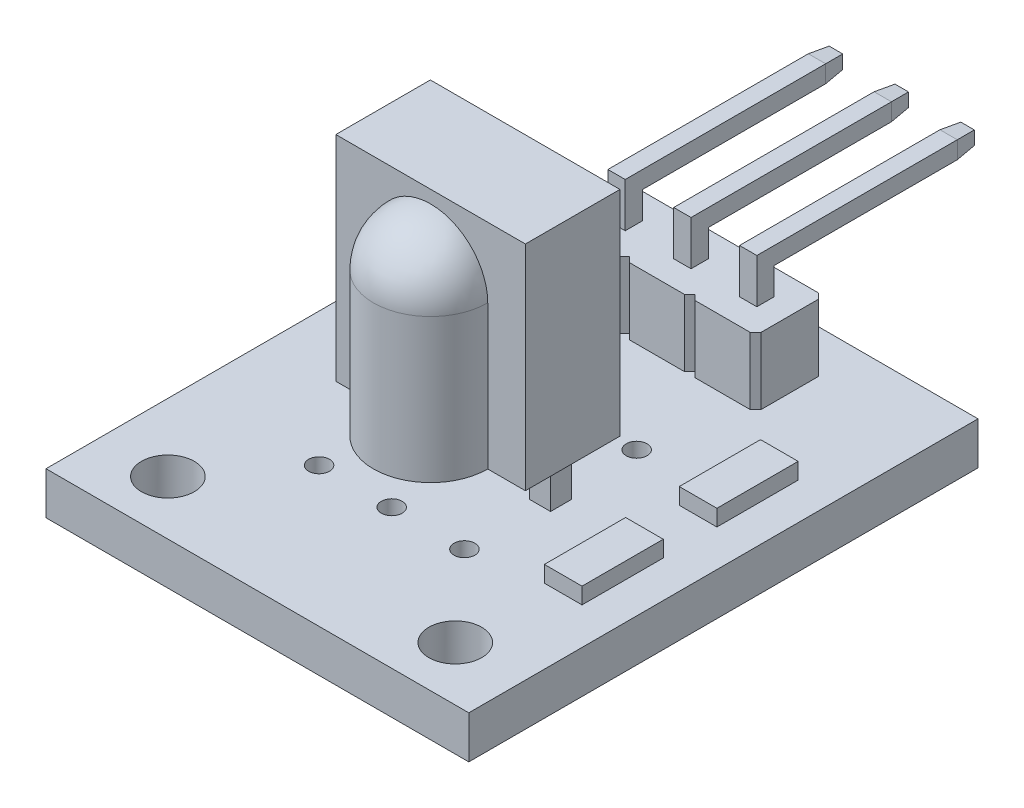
ISO-10303-21;
HEADER;
FILE_DESCRIPTION(('STEP AP214'),'2;1');
FILE_NAME('part.step','',(''),(''),'','','');
FILE_SCHEMA(('AUTOMOTIVE_DESIGN { 1 0 10303 214 1 1 1 1 }'));
ENDSEC;
DATA;
#1=APPLICATION_CONTEXT('core data for automotive mechanical design processes');
#2=APPLICATION_PROTOCOL_DEFINITION('international standard','automotive_design',2000,#1);
#3=PRODUCT_CONTEXT('',#1,'mechanical');
#4=PRODUCT('Part','Part','',(#3));
#5=PRODUCT_RELATED_PRODUCT_CATEGORY('part','',(#4));
#6=PRODUCT_DEFINITION_FORMATION('','',#4);
#7=PRODUCT_DEFINITION_CONTEXT('part definition',#1,'design');
#8=PRODUCT_DEFINITION('design','',#6,#7);
#9=PRODUCT_DEFINITION_SHAPE('','',#8);
#10=(LENGTH_UNIT() NAMED_UNIT(*) SI_UNIT(.MILLI.,.METRE.));
#11=(NAMED_UNIT(*) PLANE_ANGLE_UNIT() SI_UNIT($,.RADIAN.));
#12=(NAMED_UNIT(*) SI_UNIT($,.STERADIAN.) SOLID_ANGLE_UNIT());
#13=UNCERTAINTY_MEASURE_WITH_UNIT(LENGTH_MEASURE(1.E-05),#10,'distance_accuracy_value','');
#14=(GEOMETRIC_REPRESENTATION_CONTEXT(3) GLOBAL_UNCERTAINTY_ASSIGNED_CONTEXT((#13)) GLOBAL_UNIT_ASSIGNED_CONTEXT((#10,
#11,#12)) REPRESENTATION_CONTEXT('',''));
#15=CARTESIAN_POINT('',(0.,0.,0.));
#16=DIRECTION('',(0.,0.,1.));
#17=DIRECTION('',(1.,0.,0.));
#18=AXIS2_PLACEMENT_3D('',#15,#16,#17);
#19=CARTESIAN_POINT('',(0.,1.57,0.));
#20=DIRECTION('',(0.,-1.,0.));
#21=DIRECTION('',(0.,0.,-1.));
#22=AXIS2_PLACEMENT_3D('',#19,#20,#21);
#23=PLANE('',#22);
#24=DIRECTION('',(1.,0.,0.));
#25=VECTOR('',#24,1.);
#26=CARTESIAN_POINT('',(13.555,1.57,-5.54));
#27=LINE('',#26,#25);
#28=CARTESIAN_POINT('',(12.86,1.57,-5.54));
#29=VERTEX_POINT('',#28);
#30=CARTESIAN_POINT('',(14.25,1.57,-5.54));
#31=VERTEX_POINT('',#30);
#32=EDGE_CURVE('E672',#29,#31,#27,.T.);
#33=ORIENTED_EDGE('',*,*,#32,.F.);
#34=DIRECTION('',(0.,0.,1.));
#35=VECTOR('',#34,1.);
#36=CARTESIAN_POINT('',(12.86,1.57,-8.54));
#37=LINE('',#36,#35);
#38=CARTESIAN_POINT('',(12.86,1.57,-8.54));
#39=VERTEX_POINT('',#38);
#40=EDGE_CURVE('E684',#39,#29,#37,.T.);
#41=ORIENTED_EDGE('',*,*,#40,.F.);
#42=DIRECTION('',(-1.,0.,0.));
#43=VECTOR('',#42,1.);
#44=CARTESIAN_POINT('',(14.25,1.57,-8.54));
#45=LINE('',#44,#43);
#46=CARTESIAN_POINT('',(14.25,1.57,-8.54));
#47=VERTEX_POINT('',#46);
#48=EDGE_CURVE('E693',#47,#39,#45,.T.);
#49=ORIENTED_EDGE('',*,*,#48,.F.);
#50=DIRECTION('',(0.,0.,-1.));
#51=VECTOR('',#50,1.);
#52=CARTESIAN_POINT('',(14.25,1.57,-5.54));
#53=LINE('',#52,#51);
#54=EDGE_CURVE('E675',#31,#47,#53,.T.);
#55=ORIENTED_EDGE('',*,*,#54,.F.);
#56=EDGE_LOOP('',(#33,#41,#49,#55));
#57=FACE_BOUND('',#56,.T.);
#58=DIRECTION('',(0.,0.,-1.));
#59=VECTOR('',#58,1.);
#60=CARTESIAN_POINT('',(0.,1.57,0.));
#61=LINE('',#60,#59);
#62=CARTESIAN_POINT('',(0.,1.57,0.));
#63=VERTEX_POINT('',#62);
#64=CARTESIAN_POINT('',(0.,1.57,-18.8));
#65=VERTEX_POINT('',#64);
#66=EDGE_CURVE('E1136',#63,#65,#61,.T.);
#67=ORIENTED_EDGE('',*,*,#66,.F.);
#68=DIRECTION('',(1.,0.,0.));
#69=VECTOR('',#68,1.);
#70=CARTESIAN_POINT('',(0.,1.57,0.));
#71=LINE('',#70,#69);
#72=CARTESIAN_POINT('',(15.61,1.57,0.));
#73=VERTEX_POINT('',#72);
#74=EDGE_CURVE('E1145',#63,#73,#71,.T.);
#75=ORIENTED_EDGE('',*,*,#74,.T.);
#76=DIRECTION('',(0.,0.,-1.));
#77=VECTOR('',#76,1.);
#78=CARTESIAN_POINT('',(15.61,1.57,0.));
#79=LINE('',#78,#77);
#80=CARTESIAN_POINT('',(15.61,1.57,-18.8));
#81=VERTEX_POINT('',#80);
#82=EDGE_CURVE('E1143',#73,#81,#79,.T.);
#83=ORIENTED_EDGE('',*,*,#82,.T.);
#84=DIRECTION('',(1.,0.,0.));
#85=VECTOR('',#84,1.);
#86=CARTESIAN_POINT('',(0.,1.57,-18.8));
#87=LINE('',#86,#85);
#88=EDGE_CURVE('E1139',#65,#81,#87,.T.);
#89=ORIENTED_EDGE('',*,*,#88,.F.);
#90=EDGE_LOOP('',(#67,#75,#83,#89));
#91=FACE_BOUND('',#90,.T.);
#92=CARTESIAN_POINT('',(13.11,1.57,-2.));
#93=DIRECTION('',(0.,1.,0.));
#94=DIRECTION('',(0.,0.,1.));
#95=AXIS2_PLACEMENT_3D('',#92,#93,#94);
#96=CIRCLE('',#95,0.975);
#97=CARTESIAN_POINT('',(13.11,1.57,-1.025));
#98=VERTEX_POINT('',#97);
#99=EDGE_CURVE('E1131',#98,#98,#96,.T.);
#100=ORIENTED_EDGE('',*,*,#99,.F.);
#101=EDGE_LOOP('',(#100));
#102=FACE_BOUND('',#101,.T.);
#103=CARTESIAN_POINT('',(2.5,1.57,-2.));
#104=DIRECTION('',(0.,1.,0.));
#105=DIRECTION('',(0.,0.,1.));
#106=AXIS2_PLACEMENT_3D('',#103,#104,#105);
#107=CIRCLE('',#106,0.975);
#108=CARTESIAN_POINT('',(2.5,1.57,-1.025));
#109=VERTEX_POINT('',#108);
#110=EDGE_CURVE('E1124',#109,#109,#107,.T.);
#111=ORIENTED_EDGE('',*,*,#110,.F.);
#112=EDGE_LOOP('',(#111));
#113=FACE_BOUND('',#112,.T.);
#114=CARTESIAN_POINT('',(4.9316659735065,1.57,-5.14999917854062));
#115=DIRECTION('',(0.,1.,0.));
#116=DIRECTION('',(0.,0.,1.));
#117=AXIS2_PLACEMENT_3D('',#114,#115,#116);
#118=CIRCLE('',#117,0.385);
#119=CARTESIAN_POINT('',(4.9316659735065,1.57,-4.76499917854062));
#120=VERTEX_POINT('',#119);
#121=EDGE_CURVE('E1118',#120,#120,#118,.T.);
#122=ORIENTED_EDGE('',*,*,#121,.F.);
#123=EDGE_LOOP('',(#122));
#124=FACE_BOUND('',#123,.T.);
#125=CARTESIAN_POINT('',(10.2983315,1.57,-11.51));
#126=DIRECTION('',(0.,1.,0.));
#127=DIRECTION('',(0.,0.,1.));
#128=AXIS2_PLACEMENT_3D('',#125,#126,#127);
#129=CIRCLE('',#128,0.385);
#130=CARTESIAN_POINT('',(10.2983315,1.57,-11.125));
#131=VERTEX_POINT('',#130);
#132=EDGE_CURVE('E1101',#131,#131,#129,.T.);
#133=ORIENTED_EDGE('',*,*,#132,.F.);
#134=EDGE_LOOP('',(#133));
#135=FACE_BOUND('',#134,.T.);
#136=CARTESIAN_POINT('',(7.61499810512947,1.57,-11.5100006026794));
#137=DIRECTION('',(0.,1.,0.));
#138=DIRECTION('',(0.,0.,1.));
#139=AXIS2_PLACEMENT_3D('',#136,#137,#138);
#140=CIRCLE('',#139,0.385);
#141=CARTESIAN_POINT('',(7.61499810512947,1.57,-11.1250006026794));
#142=VERTEX_POINT('',#141);
#143=EDGE_CURVE('E1095',#142,#142,#140,.T.);
#144=ORIENTED_EDGE('',*,*,#143,.F.);
#145=EDGE_LOOP('',(#144));
#146=FACE_BOUND('',#145,.T.);
#147=CARTESIAN_POINT('',(4.9316659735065,1.57,-11.51));
#148=DIRECTION('',(0.,1.,0.));
#149=DIRECTION('',(0.,0.,1.));
#150=AXIS2_PLACEMENT_3D('',#147,#148,#149);
#151=CIRCLE('',#150,0.385);
#152=CARTESIAN_POINT('',(4.9316659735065,1.57,-11.125));
#153=VERTEX_POINT('',#152);
#154=EDGE_CURVE('E1088',#153,#153,#151,.T.);
#155=ORIENTED_EDGE('',*,*,#154,.F.);
#156=EDGE_LOOP('',(#155));
#157=FACE_BOUND('',#156,.T.);
#158=CARTESIAN_POINT('',(10.2983315,1.57,-5.14999917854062));
#159=DIRECTION('',(0.,1.,0.));
#160=DIRECTION('',(0.,0.,1.));
#161=AXIS2_PLACEMENT_3D('',#158,#159,#160);
#162=CIRCLE('',#161,0.385);
#163=CARTESIAN_POINT('',(10.2983315,1.57,-4.76499917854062));
#164=VERTEX_POINT('',#163);
#165=EDGE_CURVE('E1113',#164,#164,#162,.T.);
#166=ORIENTED_EDGE('',*,*,#165,.F.);
#167=EDGE_LOOP('',(#166));
#168=FACE_BOUND('',#167,.T.);
#169=CARTESIAN_POINT('',(7.61499810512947,1.57,-5.14999898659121));
#170=DIRECTION('',(0.,1.,0.));
#171=DIRECTION('',(0.,0.,1.));
#172=AXIS2_PLACEMENT_3D('',#169,#170,#171);
#173=CIRCLE('',#172,0.385);
#174=CARTESIAN_POINT('',(7.61499810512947,1.57,-4.76499898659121));
#175=VERTEX_POINT('',#174);
#176=EDGE_CURVE('E1106',#175,#175,#173,.T.);
#177=ORIENTED_EDGE('',*,*,#176,.F.);
#178=EDGE_LOOP('',(#177));
#179=FACE_BOUND('',#178,.T.);
#180=DIRECTION('',(1.,0.,0.));
#181=VECTOR('',#180,1.);
#182=CARTESIAN_POINT('',(6.45,1.57,-14.89));
#183=LINE('',#182,#181);
#184=CARTESIAN_POINT('',(6.65,1.57,-14.89));
#185=VERTEX_POINT('',#184);
#186=CARTESIAN_POINT('',(8.68,1.57,-14.89));
#187=VERTEX_POINT('',#186);
#188=EDGE_CURVE('E1039',#185,#187,#183,.T.);
#189=ORIENTED_EDGE('',*,*,#188,.F.);
#190=DIRECTION('',(0.707106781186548,0.,0.707106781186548));
#191=VECTOR('',#190,1.);
#192=CARTESIAN_POINT('',(10.77,1.57,-10.77));
#193=LINE('',#192,#191);
#194=CARTESIAN_POINT('',(6.45,1.57,-15.09));
#195=VERTEX_POINT('',#194);
#196=EDGE_CURVE('E1263',#185,#195,#193,.F.);
#197=ORIENTED_EDGE('',*,*,#196,.T.);
#198=DIRECTION('',(0.707106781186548,0.,-0.707106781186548));
#199=VECTOR('',#198,1.);
#200=CARTESIAN_POINT('',(-4.31999999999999,1.57,-4.31999999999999));
#201=LINE('',#200,#199);
#202=CARTESIAN_POINT('',(6.25000000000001,1.57,-14.89));
#203=VERTEX_POINT('',#202);
#204=EDGE_CURVE('E1234',#195,#203,#201,.F.);
#205=ORIENTED_EDGE('',*,*,#204,.T.);
#206=DIRECTION('',(1.,0.,0.));
#207=VECTOR('',#206,1.);
#208=CARTESIAN_POINT('',(4.02,1.57,-14.89));
#209=LINE('',#208,#207);
#210=CARTESIAN_POINT('',(4.22,1.57,-14.89));
#211=VERTEX_POINT('',#210);
#212=EDGE_CURVE('E1074',#211,#203,#209,.T.);
#213=ORIENTED_EDGE('',*,*,#212,.F.);
#214=DIRECTION('',(0.707106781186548,0.,0.707106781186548));
#215=VECTOR('',#214,1.);
#216=CARTESIAN_POINT('',(9.55499999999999,1.57,-9.55499999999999));
#217=LINE('',#216,#215);
#218=CARTESIAN_POINT('',(4.02,1.57,-15.09));
#219=VERTEX_POINT('',#218);
#220=EDGE_CURVE('E1232',#211,#219,#217,.F.);
#221=ORIENTED_EDGE('',*,*,#220,.T.);
#222=DIRECTION('',(0.,0.,1.));
#223=VECTOR('',#222,1.);
#224=CARTESIAN_POINT('',(4.02,1.57,-17.41));
#225=LINE('',#224,#223);
#226=CARTESIAN_POINT('',(4.02,1.57,-17.21));
#227=VERTEX_POINT('',#226);
#228=EDGE_CURVE('E1083',#227,#219,#225,.T.);
#229=ORIENTED_EDGE('',*,*,#228,.F.);
#230=DIRECTION('',(-0.707106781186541,0.,0.707106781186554));
#231=VECTOR('',#230,1.);
#232=CARTESIAN_POINT('',(-6.59499999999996,1.57,-6.59499999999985));
#233=LINE('',#232,#231);
#234=CARTESIAN_POINT('',(4.21999999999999,1.57,-17.41));
#235=VERTEX_POINT('',#234);
#236=EDGE_CURVE('E1223',#227,#235,#233,.F.);
#237=ORIENTED_EDGE('',*,*,#236,.T.);
#238=DIRECTION('',(-1.,0.,0.));
#239=VECTOR('',#238,1.);
#240=CARTESIAN_POINT('',(6.45,1.57,-17.41));
#241=LINE('',#240,#239);
#242=CARTESIAN_POINT('',(6.25,1.57,-17.41));
#243=VERTEX_POINT('',#242);
#244=EDGE_CURVE('E1062',#243,#235,#241,.T.);
#245=ORIENTED_EDGE('',*,*,#244,.F.);
#246=DIRECTION('',(-0.707106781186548,0.,-0.707106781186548));
#247=VECTOR('',#246,1.);
#248=CARTESIAN_POINT('',(11.83,1.57,-11.83));
#249=LINE('',#248,#247);
#250=CARTESIAN_POINT('',(6.45,1.57,-17.21));
#251=VERTEX_POINT('',#250);
#252=EDGE_CURVE('E1225',#243,#251,#249,.F.);
#253=ORIENTED_EDGE('',*,*,#252,.T.);
#254=DIRECTION('',(-0.707106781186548,0.,0.707106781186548));
#255=VECTOR('',#254,1.);
#256=CARTESIAN_POINT('',(-5.37999999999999,1.57,-5.37999999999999));
#257=LINE('',#256,#255);
#258=CARTESIAN_POINT('',(6.65,1.57,-17.41));
#259=VERTEX_POINT('',#258);
#260=EDGE_CURVE('E1259',#251,#259,#257,.F.);
#261=ORIENTED_EDGE('',*,*,#260,.T.);
#262=DIRECTION('',(-1.,0.,0.));
#263=VECTOR('',#262,1.);
#264=CARTESIAN_POINT('',(8.88,1.57,-17.41));
#265=LINE('',#264,#263);
#266=CARTESIAN_POINT('',(8.68000000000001,1.57,-17.41));
#267=VERTEX_POINT('',#266);
#268=EDGE_CURVE('E1044',#267,#259,#265,.T.);
#269=ORIENTED_EDGE('',*,*,#268,.F.);
#270=DIRECTION('',(-0.707106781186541,0.,-0.707106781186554));
#271=VECTOR('',#270,1.);
#272=CARTESIAN_POINT('',(13.0450000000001,1.57,-13.0449999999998));
#273=LINE('',#272,#271);
#274=CARTESIAN_POINT('',(8.88,1.57,-17.21));
#275=VERTEX_POINT('',#274);
#276=EDGE_CURVE('E1261',#267,#275,#273,.F.);
#277=ORIENTED_EDGE('',*,*,#276,.T.);
#278=DIRECTION('',(-0.707106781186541,0.,0.707106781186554));
#279=VECTOR('',#278,1.);
#280=CARTESIAN_POINT('',(-4.16499999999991,1.57,-4.16499999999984));
#281=LINE('',#280,#279);
#282=CARTESIAN_POINT('',(9.08,1.57,-17.41));
#283=VERTEX_POINT('',#282);
#284=EDGE_CURVE('E1228',#275,#283,#281,.F.);
#285=ORIENTED_EDGE('',*,*,#284,.T.);
#286=DIRECTION('',(-1.,0.,0.));
#287=VECTOR('',#286,1.);
#288=CARTESIAN_POINT('',(8.88,1.57,-17.41));
#289=LINE('',#288,#287);
#290=CARTESIAN_POINT('',(11.11,1.57,-17.41));
#291=VERTEX_POINT('',#290);
#292=EDGE_CURVE('E1065',#291,#283,#289,.T.);
#293=ORIENTED_EDGE('',*,*,#292,.F.);
#294=DIRECTION('',(-0.707106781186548,0.,-0.707106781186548));
#295=VECTOR('',#294,1.);
#296=CARTESIAN_POINT('',(14.26,1.57,-14.26));
#297=LINE('',#296,#295);
#298=CARTESIAN_POINT('',(11.31,1.57,-17.21));
#299=VERTEX_POINT('',#298);
#300=EDGE_CURVE('E1230',#291,#299,#297,.F.);
#301=ORIENTED_EDGE('',*,*,#300,.T.);
#302=DIRECTION('',(0.,0.,-1.));
#303=VECTOR('',#302,1.);
#304=CARTESIAN_POINT('',(11.31,1.57,-17.41));
#305=LINE('',#304,#303);
#306=CARTESIAN_POINT('',(11.31,1.57,-15.09));
#307=VERTEX_POINT('',#306);
#308=EDGE_CURVE('E1047',#307,#299,#305,.T.);
#309=ORIENTED_EDGE('',*,*,#308,.F.);
#310=DIRECTION('',(0.707106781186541,0.,-0.707106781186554));
#311=VECTOR('',#310,1.);
#312=CARTESIAN_POINT('',(-1.8899999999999,1.57,-1.88999999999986));
#313=LINE('',#312,#311);
#314=CARTESIAN_POINT('',(11.11,1.57,-14.89));
#315=VERTEX_POINT('',#314);
#316=EDGE_CURVE('E1239',#307,#315,#313,.F.);
#317=ORIENTED_EDGE('',*,*,#316,.T.);
#318=DIRECTION('',(1.,0.,0.));
#319=VECTOR('',#318,1.);
#320=CARTESIAN_POINT('',(11.31,1.57,-14.89));
#321=LINE('',#320,#319);
#322=CARTESIAN_POINT('',(9.08000000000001,1.57,-14.89));
#323=VERTEX_POINT('',#322);
#324=EDGE_CURVE('E1056',#323,#315,#321,.T.);
#325=ORIENTED_EDGE('',*,*,#324,.F.);
#326=DIRECTION('',(0.707106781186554,0.,0.707106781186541));
#327=VECTOR('',#326,1.);
#328=CARTESIAN_POINT('',(11.9849999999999,1.57,-11.9850000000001));
#329=LINE('',#328,#327);
#330=CARTESIAN_POINT('',(8.88,1.57,-15.09));
#331=VERTEX_POINT('',#330);
#332=EDGE_CURVE('E1236',#323,#331,#329,.F.);
#333=ORIENTED_EDGE('',*,*,#332,.T.);
#334=DIRECTION('',(0.707106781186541,0.,-0.707106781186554));
#335=VECTOR('',#334,1.);
#336=CARTESIAN_POINT('',(-3.10499999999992,1.57,-3.10499999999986));
#337=LINE('',#336,#335);
#338=EDGE_CURVE('E1265',#331,#187,#337,.F.);
#339=ORIENTED_EDGE('',*,*,#338,.T.);
#340=EDGE_LOOP('',(#189,#197,#205,#213,#221,#229,#237,#245,#253,#261,#269,#277,#285,#293,#301,
#309,#317,#325,#333,#339));
#341=FACE_BOUND('',#340,.T.);
#342=DIRECTION('',(0.,0.,-1.));
#343=VECTOR('',#342,1.);
#344=CARTESIAN_POINT('',(5.3166662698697,1.57,0.));
#345=LINE('',#344,#343);
#346=CARTESIAN_POINT('',(5.3166662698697,1.57,-7.94499938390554));
#347=VERTEX_POINT('',#346);
#348=CARTESIAN_POINT('',(5.3166662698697,1.57,-8.71499938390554));
#349=VERTEX_POINT('',#348);
#350=EDGE_CURVE('E894',#347,#349,#345,.T.);
#351=ORIENTED_EDGE('',*,*,#350,.F.);
#352=DIRECTION('',(1.,0.,0.));
#353=VECTOR('',#352,1.);
#354=CARTESIAN_POINT('',(0.,1.57,-7.94499938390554));
#355=LINE('',#354,#353);
#356=CARTESIAN_POINT('',(4.5466662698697,1.57,-7.94499938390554));
#357=VERTEX_POINT('',#356);
#358=EDGE_CURVE('E875',#357,#347,#355,.T.);
#359=ORIENTED_EDGE('',*,*,#358,.F.);
#360=DIRECTION('',(0.,0.,1.));
#361=VECTOR('',#360,1.);
#362=CARTESIAN_POINT('',(4.5466662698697,1.57,0.));
#363=LINE('',#362,#361);
#364=CARTESIAN_POINT('',(4.5466662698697,1.57,-8.71499938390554));
#365=VERTEX_POINT('',#364);
#366=EDGE_CURVE('E888',#365,#357,#363,.T.);
#367=ORIENTED_EDGE('',*,*,#366,.F.);
#368=DIRECTION('',(-1.,0.,0.));
#369=VECTOR('',#368,1.);
#370=CARTESIAN_POINT('',(0.,1.57,-8.71499938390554));
#371=LINE('',#370,#369);
#372=EDGE_CURVE('E891',#349,#365,#371,.T.);
#373=ORIENTED_EDGE('',*,*,#372,.F.);
#374=EDGE_LOOP('',(#351,#359,#367,#373));
#375=FACE_BOUND('',#374,.T.);
#376=DIRECTION('',(0.,0.,-1.));
#377=VECTOR('',#376,1.);
#378=CARTESIAN_POINT('',(8.,1.57,0.));
#379=LINE('',#378,#377);
#380=CARTESIAN_POINT('',(8.,1.57,-7.945));
#381=VERTEX_POINT('',#380);
#382=CARTESIAN_POINT('',(8.,1.57,-8.715));
#383=VERTEX_POINT('',#382);
#384=EDGE_CURVE('E869',#381,#383,#379,.T.);
#385=ORIENTED_EDGE('',*,*,#384,.F.);
#386=DIRECTION('',(1.,0.,0.));
#387=VECTOR('',#386,1.);
#388=CARTESIAN_POINT('',(0.,1.57,-7.945));
#389=LINE('',#388,#387);
#390=CARTESIAN_POINT('',(7.23,1.57,-7.945));
#391=VERTEX_POINT('',#390);
#392=EDGE_CURVE('E844',#391,#381,#389,.T.);
#393=ORIENTED_EDGE('',*,*,#392,.F.);
#394=DIRECTION('',(0.,0.,1.));
#395=VECTOR('',#394,1.);
#396=CARTESIAN_POINT('',(7.23,1.57,0.));
#397=LINE('',#396,#395);
#398=CARTESIAN_POINT('',(7.23,1.57,-8.715));
#399=VERTEX_POINT('',#398);
#400=EDGE_CURVE('E865',#399,#391,#397,.T.);
#401=ORIENTED_EDGE('',*,*,#400,.F.);
#402=DIRECTION('',(-1.,0.,0.));
#403=VECTOR('',#402,1.);
#404=CARTESIAN_POINT('',(0.,1.57,-8.715));
#405=LINE('',#404,#403);
#406=EDGE_CURVE('E867',#383,#399,#405,.T.);
#407=ORIENTED_EDGE('',*,*,#406,.F.);
#408=EDGE_LOOP('',(#385,#393,#401,#407));
#409=FACE_BOUND('',#408,.T.);
#410=DIRECTION('',(0.,0.,-1.));
#411=VECTOR('',#410,1.);
#412=CARTESIAN_POINT('',(10.6833324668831,1.57,0.));
#413=LINE('',#412,#411);
#414=CARTESIAN_POINT('',(10.6833324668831,1.57,-7.94499938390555));
#415=VERTEX_POINT('',#414);
#416=CARTESIAN_POINT('',(10.6833324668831,1.57,-8.71499938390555));
#417=VERTEX_POINT('',#416);
#418=EDGE_CURVE('E838',#415,#417,#413,.T.);
#419=ORIENTED_EDGE('',*,*,#418,.F.);
#420=DIRECTION('',(1.,0.,0.));
#421=VECTOR('',#420,1.);
#422=CARTESIAN_POINT('',(0.,1.57,-7.94499938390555));
#423=LINE('',#422,#421);
#424=CARTESIAN_POINT('',(9.91333246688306,1.57,-7.94499938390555));
#425=VERTEX_POINT('',#424);
#426=EDGE_CURVE('E819',#425,#415,#423,.T.);
#427=ORIENTED_EDGE('',*,*,#426,.F.);
#428=DIRECTION('',(0.,0.,1.));
#429=VECTOR('',#428,1.);
#430=CARTESIAN_POINT('',(9.91333246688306,1.57,0.));
#431=LINE('',#430,#429);
#432=CARTESIAN_POINT('',(9.91333246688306,1.57,-8.71499938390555));
#433=VERTEX_POINT('',#432);
#434=EDGE_CURVE('E832',#433,#425,#431,.T.);
#435=ORIENTED_EDGE('',*,*,#434,.F.);
#436=DIRECTION('',(-1.,0.,0.));
#437=VECTOR('',#436,1.);
#438=CARTESIAN_POINT('',(0.,1.57,-8.71499938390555));
#439=LINE('',#438,#437);
#440=EDGE_CURVE('E835',#417,#433,#439,.T.);
#441=ORIENTED_EDGE('',*,*,#440,.F.);
#442=EDGE_LOOP('',(#419,#427,#435,#441));
#443=FACE_BOUND('',#442,.T.);
#444=DIRECTION('',(0.,0.,1.));
#445=VECTOR('',#444,1.);
#446=CARTESIAN_POINT('',(12.86,1.57,-10.52));
#447=LINE('',#446,#445);
#448=CARTESIAN_POINT('',(12.86,1.57,-13.52));
#449=VERTEX_POINT('',#448);
#450=CARTESIAN_POINT('',(12.86,1.57,-10.52));
#451=VERTEX_POINT('',#450);
#452=EDGE_CURVE('E671',#449,#451,#447,.T.);
#453=ORIENTED_EDGE('',*,*,#452,.F.);
#454=DIRECTION('',(-1.,0.,0.));
#455=VECTOR('',#454,1.);
#456=CARTESIAN_POINT('',(12.86,1.57,-13.52));
#457=LINE('',#456,#455);
#458=CARTESIAN_POINT('',(14.25,1.57,-13.52));
#459=VERTEX_POINT('',#458);
#460=EDGE_CURVE('E668',#459,#449,#457,.T.);
#461=ORIENTED_EDGE('',*,*,#460,.F.);
#462=DIRECTION('',(0.,0.,-1.));
#463=VECTOR('',#462,1.);
#464=CARTESIAN_POINT('',(14.25,1.57,-13.52));
#465=LINE('',#464,#463);
#466=CARTESIAN_POINT('',(14.25,1.57,-10.52));
#467=VERTEX_POINT('',#466);
#468=EDGE_CURVE('E54',#467,#459,#465,.T.);
#469=ORIENTED_EDGE('',*,*,#468,.F.);
#470=DIRECTION('',(1.,0.,0.));
#471=VECTOR('',#470,1.);
#472=CARTESIAN_POINT('',(14.25,1.57,-10.52));
#473=LINE('',#472,#471);
#474=EDGE_CURVE('E49',#451,#467,#473,.T.);
#475=ORIENTED_EDGE('',*,*,#474,.F.);
#476=EDGE_LOOP('',(#453,#461,#469,#475));
#477=FACE_BOUND('',#476,.T.);
#478=ADVANCED_FACE('F34',(#57,#91,#102,#113,#124,#135,#146,#157,#168,#179,#341,#375,#409,#443,
#477),#23,.F.);
#479=CARTESIAN_POINT('',(4.915,-1.35,-16.47));
#480=DIRECTION('',(0.,0.,-1.));
#481=DIRECTION('',(-1.,0.,0.));
#482=AXIS2_PLACEMENT_3D('',#479,#480,#481);
#483=PLANE('',#482);
#484=DIRECTION('',(0.,1.,0.));
#485=VECTOR('',#484,1.);
#486=CARTESIAN_POINT('',(4.915,-1.35,-16.47));
#487=LINE('',#486,#485);
#488=CARTESIAN_POINT('',(4.915,4.04,-16.47));
#489=VERTEX_POINT('',#488);
#490=CARTESIAN_POINT('',(4.915,5.04021376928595,-16.47));
#491=VERTEX_POINT('',#490);
#492=EDGE_CURVE('E1025',#489,#491,#487,.T.);
#493=ORIENTED_EDGE('',*,*,#492,.T.);
#494=DIRECTION('',(-1.,0.,0.));
#495=VECTOR('',#494,1.);
#496=CARTESIAN_POINT('',(5.555,5.04021376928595,-16.47));
#497=LINE('',#496,#495);
#498=CARTESIAN_POINT('',(5.555,5.04021376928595,-16.47));
#499=VERTEX_POINT('',#498);
#500=EDGE_CURVE('E919',#499,#491,#497,.T.);
#501=ORIENTED_EDGE('',*,*,#500,.F.);
#502=DIRECTION('',(0.,1.,0.));
#503=VECTOR('',#502,1.);
#504=CARTESIAN_POINT('',(5.555,-1.35,-16.47));
#505=LINE('',#504,#503);
#506=CARTESIAN_POINT('',(5.555,4.04,-16.47));
#507=VERTEX_POINT('',#506);
#508=EDGE_CURVE('E1015',#507,#499,#505,.T.);
#509=ORIENTED_EDGE('',*,*,#508,.F.);
#510=DIRECTION('',(-1.,0.,0.));
#511=VECTOR('',#510,1.);
#512=CARTESIAN_POINT('',(0.,4.04,-16.47));
#513=LINE('',#512,#511);
#514=EDGE_CURVE('E1267',#507,#489,#513,.T.);
#515=ORIENTED_EDGE('',*,*,#514,.T.);
#516=EDGE_LOOP('',(#493,#501,#509,#515));
#517=FACE_BOUND('',#516,.T.);
#518=ADVANCED_FACE('F1513',(#517),#483,.T.);
#519=CARTESIAN_POINT('',(7.345,-1.35,-16.47));
#520=DIRECTION('',(0.,0.,-1.));
#521=DIRECTION('',(-1.,0.,0.));
#522=AXIS2_PLACEMENT_3D('',#519,#520,#521);
#523=PLANE('',#522);
#524=DIRECTION('',(0.,1.,0.));
#525=VECTOR('',#524,1.);
#526=CARTESIAN_POINT('',(7.345,-1.35,-16.47));
#527=LINE('',#526,#525);
#528=CARTESIAN_POINT('',(7.345,4.04,-16.47));
#529=VERTEX_POINT('',#528);
#530=CARTESIAN_POINT('',(7.345,5.04,-16.47));
#531=VERTEX_POINT('',#530);
#532=EDGE_CURVE('E993',#529,#531,#527,.T.);
#533=ORIENTED_EDGE('',*,*,#532,.T.);
#534=DIRECTION('',(-1.,0.,0.));
#535=VECTOR('',#534,1.);
#536=CARTESIAN_POINT('',(7.985,5.04,-16.47));
#537=LINE('',#536,#535);
#538=CARTESIAN_POINT('',(7.985,5.04,-16.47));
#539=VERTEX_POINT('',#538);
#540=EDGE_CURVE('E927',#539,#531,#537,.T.);
#541=ORIENTED_EDGE('',*,*,#540,.F.);
#542=DIRECTION('',(0.,1.,0.));
#543=VECTOR('',#542,1.);
#544=CARTESIAN_POINT('',(7.985,-1.35,-16.47));
#545=LINE('',#544,#543);
#546=CARTESIAN_POINT('',(7.985,4.04,-16.47));
#547=VERTEX_POINT('',#546);
#548=EDGE_CURVE('E983',#547,#539,#545,.T.);
#549=ORIENTED_EDGE('',*,*,#548,.F.);
#550=DIRECTION('',(-1.,0.,0.));
#551=VECTOR('',#550,1.);
#552=CARTESIAN_POINT('',(0.,4.04,-16.47));
#553=LINE('',#552,#551);
#554=EDGE_CURVE('E1279',#547,#529,#553,.T.);
#555=ORIENTED_EDGE('',*,*,#554,.T.);
#556=EDGE_LOOP('',(#533,#541,#549,#555));
#557=FACE_BOUND('',#556,.T.);
#558=ADVANCED_FACE('F1519',(#557),#523,.T.);
#559=CARTESIAN_POINT('',(9.775,-1.35,-16.47));
#560=DIRECTION('',(0.,0.,-1.));
#561=DIRECTION('',(-1.,0.,0.));
#562=AXIS2_PLACEMENT_3D('',#559,#560,#561);
#563=PLANE('',#562);
#564=DIRECTION('',(0.,1.,0.));
#565=VECTOR('',#564,1.);
#566=CARTESIAN_POINT('',(9.775,-1.35,-16.47));
#567=LINE('',#566,#565);
#568=CARTESIAN_POINT('',(9.775,4.04,-16.47));
#569=VERTEX_POINT('',#568);
#570=CARTESIAN_POINT('',(9.775,5.04,-16.47));
#571=VERTEX_POINT('',#570);
#572=EDGE_CURVE('E961',#569,#571,#567,.T.);
#573=ORIENTED_EDGE('',*,*,#572,.T.);
#574=DIRECTION('',(-1.,0.,0.));
#575=VECTOR('',#574,1.);
#576=CARTESIAN_POINT('',(10.415,5.04,-16.47));
#577=LINE('',#576,#575);
#578=CARTESIAN_POINT('',(10.415,5.04,-16.47));
#579=VERTEX_POINT('',#578);
#580=EDGE_CURVE('E934',#579,#571,#577,.T.);
#581=ORIENTED_EDGE('',*,*,#580,.F.);
#582=DIRECTION('',(0.,1.,0.));
#583=VECTOR('',#582,1.);
#584=CARTESIAN_POINT('',(10.415,-1.35,-16.47));
#585=LINE('',#584,#583);
#586=CARTESIAN_POINT('',(10.415,4.04,-16.47));
#587=VERTEX_POINT('',#586);
#588=EDGE_CURVE('E951',#587,#579,#585,.T.);
#589=ORIENTED_EDGE('',*,*,#588,.F.);
#590=DIRECTION('',(-1.,0.,0.));
#591=VECTOR('',#590,1.);
#592=CARTESIAN_POINT('',(0.,4.04,-16.47));
#593=LINE('',#592,#591);
#594=EDGE_CURVE('E1291',#587,#569,#593,.T.);
#595=ORIENTED_EDGE('',*,*,#594,.T.);
#596=EDGE_LOOP('',(#573,#581,#589,#595));
#597=FACE_BOUND('',#596,.T.);
#598=ADVANCED_FACE('F1547',(#597),#563,.T.);
#599=CARTESIAN_POINT('',(0.,1.57,0.));
#600=DIRECTION('',(-1.,0.,0.));
#601=DIRECTION('',(0.,0.,1.));
#602=AXIS2_PLACEMENT_3D('',#599,#600,#601);
#603=PLANE('',#602);
#604=DIRECTION('',(0.,0.,-1.));
#605=VECTOR('',#604,1.);
#606=CARTESIAN_POINT('',(0.,0.,0.));
#607=LINE('',#606,#605);
#608=CARTESIAN_POINT('',(0.,0.,0.));
#609=VERTEX_POINT('',#608);
#610=CARTESIAN_POINT('',(0.,0.,-18.8));
#611=VERTEX_POINT('',#610);
#612=EDGE_CURVE('E1127',#609,#611,#607,.T.);
#613=ORIENTED_EDGE('',*,*,#612,.F.);
#614=DIRECTION('',(0.,-1.,0.));
#615=VECTOR('',#614,1.);
#616=CARTESIAN_POINT('',(0.,1.57,0.));
#617=LINE('',#616,#615);
#618=EDGE_CURVE('E1157',#63,#609,#617,.T.);
#619=ORIENTED_EDGE('',*,*,#618,.F.);
#620=ORIENTED_EDGE('',*,*,#66,.T.);
#621=DIRECTION('',(0.,-1.,0.));
#622=VECTOR('',#621,1.);
#623=CARTESIAN_POINT('',(0.,1.57,-18.8));
#624=LINE('',#623,#622);
#625=EDGE_CURVE('E1147',#65,#611,#624,.T.);
#626=ORIENTED_EDGE('',*,*,#625,.T.);
#627=EDGE_LOOP('',(#613,#619,#620,#626));
#628=FACE_BOUND('',#627,.T.);
#629=ADVANCED_FACE('F1537',(#628),#603,.T.);
#630=CARTESIAN_POINT('',(0.,1.57,0.));
#631=DIRECTION('',(0.,0.,-1.));
#632=DIRECTION('',(-1.,0.,0.));
#633=AXIS2_PLACEMENT_3D('',#630,#631,#632);
#634=PLANE('',#633);
#635=DIRECTION('',(1.,0.,0.));
#636=VECTOR('',#635,1.);
#637=CARTESIAN_POINT('',(0.,0.,0.));
#638=LINE('',#637,#636);
#639=CARTESIAN_POINT('',(15.61,0.,0.));
#640=VERTEX_POINT('',#639);
#641=EDGE_CURVE('E1140',#609,#640,#638,.T.);
#642=ORIENTED_EDGE('',*,*,#641,.T.);
#643=DIRECTION('',(0.,-1.,0.));
#644=VECTOR('',#643,1.);
#645=CARTESIAN_POINT('',(15.61,1.57,0.));
#646=LINE('',#645,#644);
#647=EDGE_CURVE('E1160',#73,#640,#646,.T.);
#648=ORIENTED_EDGE('',*,*,#647,.F.);
#649=ORIENTED_EDGE('',*,*,#74,.F.);
#650=ORIENTED_EDGE('',*,*,#618,.T.);
#651=EDGE_LOOP('',(#642,#648,#649,#650));
#652=FACE_BOUND('',#651,.T.);
#653=ADVANCED_FACE('F1533',(#652),#634,.F.);
#654=CARTESIAN_POINT('',(15.61,1.57,0.));
#655=DIRECTION('',(-1.,0.,0.));
#656=DIRECTION('',(0.,0.,1.));
#657=AXIS2_PLACEMENT_3D('',#654,#655,#656);
#658=PLANE('',#657);
#659=DIRECTION('',(0.,0.,-1.));
#660=VECTOR('',#659,1.);
#661=CARTESIAN_POINT('',(15.61,0.,0.));
#662=LINE('',#661,#660);
#663=CARTESIAN_POINT('',(15.61,0.,-18.8));
#664=VERTEX_POINT('',#663);
#665=EDGE_CURVE('E1153',#640,#664,#662,.T.);
#666=ORIENTED_EDGE('',*,*,#665,.T.);
#667=DIRECTION('',(0.,-1.,0.));
#668=VECTOR('',#667,1.);
#669=CARTESIAN_POINT('',(15.61,1.57,-18.8));
#670=LINE('',#669,#668);
#671=EDGE_CURVE('E1163',#81,#664,#670,.T.);
#672=ORIENTED_EDGE('',*,*,#671,.F.);
#673=ORIENTED_EDGE('',*,*,#82,.F.);
#674=ORIENTED_EDGE('',*,*,#647,.T.);
#675=EDGE_LOOP('',(#666,#672,#673,#674));
#676=FACE_BOUND('',#675,.T.);
#677=ADVANCED_FACE('F1536',(#676),#658,.F.);
#678=CARTESIAN_POINT('',(0.,1.57,-18.8));
#679=DIRECTION('',(0.,0.,-1.));
#680=DIRECTION('',(-1.,0.,0.));
#681=AXIS2_PLACEMENT_3D('',#678,#679,#680);
#682=PLANE('',#681);
#683=DIRECTION('',(1.,0.,0.));
#684=VECTOR('',#683,1.);
#685=CARTESIAN_POINT('',(0.,0.,-18.8));
#686=LINE('',#685,#684);
#687=EDGE_CURVE('E1150',#611,#664,#686,.T.);
#688=ORIENTED_EDGE('',*,*,#687,.F.);
#689=ORIENTED_EDGE('',*,*,#625,.F.);
#690=ORIENTED_EDGE('',*,*,#88,.T.);
#691=ORIENTED_EDGE('',*,*,#671,.T.);
#692=EDGE_LOOP('',(#688,#689,#690,#691));
#693=FACE_BOUND('',#692,.T.);
#694=ADVANCED_FACE('F1531',(#693),#682,.T.);
#695=CARTESIAN_POINT('',(0.,0.,0.));
#696=DIRECTION('',(0.,-1.,0.));
#697=DIRECTION('',(0.,0.,-1.));
#698=AXIS2_PLACEMENT_3D('',#695,#696,#697);
#699=PLANE('',#698);
#700=CARTESIAN_POINT('',(10.2983324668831,0.,-8.32999938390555));
#701=DIRECTION('',(0.,-1.,0.));
#702=DIRECTION('',(0.,0.,-1.));
#703=AXIS2_PLACEMENT_3D('',#700,#701,#702);
#704=CIRCLE('',#703,0.385);
#705=CARTESIAN_POINT('',(10.2983324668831,0.,-8.71499938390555));
#706=VERTEX_POINT('',#705);
#707=EDGE_CURVE('E897',#706,#706,#704,.T.);
#708=ORIENTED_EDGE('',*,*,#707,.F.);
#709=EDGE_LOOP('',(#708));
#710=FACE_BOUND('',#709,.T.);
#711=CARTESIAN_POINT('',(7.61500000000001,0.,-8.33));
#712=DIRECTION('',(0.,-1.,0.));
#713=DIRECTION('',(0.,0.,-1.));
#714=AXIS2_PLACEMENT_3D('',#711,#712,#713);
#715=CIRCLE('',#714,0.385);
#716=CARTESIAN_POINT('',(7.61500000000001,0.,-8.715));
#717=VERTEX_POINT('',#716);
#718=EDGE_CURVE('E906',#717,#717,#715,.T.);
#719=ORIENTED_EDGE('',*,*,#718,.F.);
#720=EDGE_LOOP('',(#719));
#721=FACE_BOUND('',#720,.T.);
#722=CARTESIAN_POINT('',(4.9316662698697,0.,-8.32999938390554));
#723=DIRECTION('',(0.,-1.,0.));
#724=DIRECTION('',(0.,0.,-1.));
#725=AXIS2_PLACEMENT_3D('',#722,#723,#724);
#726=CIRCLE('',#725,0.388442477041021);
#727=CARTESIAN_POINT('',(4.9316662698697,0.,-8.71844186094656));
#728=VERTEX_POINT('',#727);
#729=EDGE_CURVE('E915',#728,#728,#726,.T.);
#730=ORIENTED_EDGE('',*,*,#729,.F.);
#731=EDGE_LOOP('',(#730));
#732=FACE_BOUND('',#731,.T.);
#733=DIRECTION('',(0.,0.,1.));
#734=VECTOR('',#733,1.);
#735=CARTESIAN_POINT('',(10.415,0.,0.));
#736=LINE('',#735,#734);
#737=CARTESIAN_POINT('',(10.415,0.,-16.47));
#738=VERTEX_POINT('',#737);
#739=CARTESIAN_POINT('',(10.415,0.,-15.83));
#740=VERTEX_POINT('',#739);
#741=EDGE_CURVE('E972',#738,#740,#736,.T.);
#742=ORIENTED_EDGE('',*,*,#741,.F.);
#743=DIRECTION('',(1.,0.,0.));
#744=VECTOR('',#743,1.);
#745=CARTESIAN_POINT('',(0.,0.,-16.47));
#746=LINE('',#745,#744);
#747=CARTESIAN_POINT('',(9.775,0.,-16.47));
#748=VERTEX_POINT('',#747);
#749=EDGE_CURVE('E954',#748,#738,#746,.T.);
#750=ORIENTED_EDGE('',*,*,#749,.F.);
#751=DIRECTION('',(0.,0.,-1.));
#752=VECTOR('',#751,1.);
#753=CARTESIAN_POINT('',(9.775,0.,0.));
#754=LINE('',#753,#752);
#755=CARTESIAN_POINT('',(9.775,0.,-15.83));
#756=VERTEX_POINT('',#755);
#757=EDGE_CURVE('E966',#756,#748,#754,.T.);
#758=ORIENTED_EDGE('',*,*,#757,.F.);
#759=DIRECTION('',(-1.,0.,0.));
#760=VECTOR('',#759,1.);
#761=CARTESIAN_POINT('',(0.,0.,-15.83));
#762=LINE('',#761,#760);
#763=EDGE_CURVE('E969',#740,#756,#762,.T.);
#764=ORIENTED_EDGE('',*,*,#763,.F.);
#765=EDGE_LOOP('',(#742,#750,#758,#764));
#766=FACE_BOUND('',#765,.T.);
#767=DIRECTION('',(0.,0.,1.));
#768=VECTOR('',#767,1.);
#769=CARTESIAN_POINT('',(7.985,0.,0.));
#770=LINE('',#769,#768);
#771=CARTESIAN_POINT('',(7.985,0.,-16.47));
#772=VERTEX_POINT('',#771);
#773=CARTESIAN_POINT('',(7.985,0.,-15.83));
#774=VERTEX_POINT('',#773);
#775=EDGE_CURVE('E1004',#772,#774,#770,.T.);
#776=ORIENTED_EDGE('',*,*,#775,.F.);
#777=DIRECTION('',(1.,0.,0.));
#778=VECTOR('',#777,1.);
#779=CARTESIAN_POINT('',(0.,0.,-16.47));
#780=LINE('',#779,#778);
#781=CARTESIAN_POINT('',(7.345,0.,-16.47));
#782=VERTEX_POINT('',#781);
#783=EDGE_CURVE('E986',#782,#772,#780,.T.);
#784=ORIENTED_EDGE('',*,*,#783,.F.);
#785=DIRECTION('',(0.,0.,-1.));
#786=VECTOR('',#785,1.);
#787=CARTESIAN_POINT('',(7.345,0.,0.));
#788=LINE('',#787,#786);
#789=CARTESIAN_POINT('',(7.345,0.,-15.83));
#790=VERTEX_POINT('',#789);
#791=EDGE_CURVE('E998',#790,#782,#788,.T.);
#792=ORIENTED_EDGE('',*,*,#791,.F.);
#793=DIRECTION('',(-1.,0.,0.));
#794=VECTOR('',#793,1.);
#795=CARTESIAN_POINT('',(0.,0.,-15.83));
#796=LINE('',#795,#794);
#797=EDGE_CURVE('E1001',#774,#790,#796,.T.);
#798=ORIENTED_EDGE('',*,*,#797,.F.);
#799=EDGE_LOOP('',(#776,#784,#792,#798));
#800=FACE_BOUND('',#799,.T.);
#801=DIRECTION('',(0.,0.,1.));
#802=VECTOR('',#801,1.);
#803=CARTESIAN_POINT('',(5.555,0.,0.));
#804=LINE('',#803,#802);
#805=CARTESIAN_POINT('',(5.555,0.,-16.47));
#806=VERTEX_POINT('',#805);
#807=CARTESIAN_POINT('',(5.555,0.,-15.83));
#808=VERTEX_POINT('',#807);
#809=EDGE_CURVE('E1036',#806,#808,#804,.T.);
#810=ORIENTED_EDGE('',*,*,#809,.F.);
#811=DIRECTION('',(1.,0.,0.));
#812=VECTOR('',#811,1.);
#813=CARTESIAN_POINT('',(0.,0.,-16.47));
#814=LINE('',#813,#812);
#815=CARTESIAN_POINT('',(4.915,0.,-16.47));
#816=VERTEX_POINT('',#815);
#817=EDGE_CURVE('E1018',#816,#806,#814,.T.);
#818=ORIENTED_EDGE('',*,*,#817,.F.);
#819=DIRECTION('',(0.,0.,-1.));
#820=VECTOR('',#819,1.);
#821=CARTESIAN_POINT('',(4.915,0.,0.));
#822=LINE('',#821,#820);
#823=CARTESIAN_POINT('',(4.915,0.,-15.83));
#824=VERTEX_POINT('',#823);
#825=EDGE_CURVE('E1030',#824,#816,#822,.T.);
#826=ORIENTED_EDGE('',*,*,#825,.F.);
#827=DIRECTION('',(-1.,0.,0.));
#828=VECTOR('',#827,1.);
#829=CARTESIAN_POINT('',(0.,0.,-15.83));
#830=LINE('',#829,#828);
#831=EDGE_CURVE('E1033',#808,#824,#830,.T.);
#832=ORIENTED_EDGE('',*,*,#831,.F.);
#833=EDGE_LOOP('',(#810,#818,#826,#832));
#834=FACE_BOUND('',#833,.T.);
#835=CARTESIAN_POINT('',(7.61499810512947,0.,-5.14999898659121));
#836=DIRECTION('',(0.,-1.,0.));
#837=DIRECTION('',(0.,0.,-1.));
#838=AXIS2_PLACEMENT_3D('',#835,#836,#837);
#839=CIRCLE('',#838,0.385);
#840=CARTESIAN_POINT('',(7.61499810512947,0.,-5.53499898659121));
#841=VERTEX_POINT('',#840);
#842=EDGE_CURVE('E1110',#841,#841,#839,.F.);
#843=ORIENTED_EDGE('',*,*,#842,.T.);
#844=EDGE_LOOP('',(#843));
#845=FACE_BOUND('',#844,.T.);
#846=CARTESIAN_POINT('',(10.2983315,0.,-5.14999917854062));
#847=DIRECTION('',(0.,-1.,0.));
#848=DIRECTION('',(0.,0.,-1.));
#849=AXIS2_PLACEMENT_3D('',#846,#847,#848);
#850=CIRCLE('',#849,0.385);
#851=CARTESIAN_POINT('',(10.2983315,0.,-5.53499917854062));
#852=VERTEX_POINT('',#851);
#853=EDGE_CURVE('E1091',#852,#852,#850,.F.);
#854=ORIENTED_EDGE('',*,*,#853,.T.);
#855=EDGE_LOOP('',(#854));
#856=FACE_BOUND('',#855,.T.);
#857=CARTESIAN_POINT('',(4.9316659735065,0.,-11.51));
#858=DIRECTION('',(0.,-1.,0.));
#859=DIRECTION('',(0.,0.,-1.));
#860=AXIS2_PLACEMENT_3D('',#857,#858,#859);
#861=CIRCLE('',#860,0.385);
#862=CARTESIAN_POINT('',(4.9316659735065,0.,-11.895));
#863=VERTEX_POINT('',#862);
#864=EDGE_CURVE('E1092',#863,#863,#861,.F.);
#865=ORIENTED_EDGE('',*,*,#864,.T.);
#866=EDGE_LOOP('',(#865));
#867=FACE_BOUND('',#866,.T.);
#868=CARTESIAN_POINT('',(7.61499810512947,0.,-11.5100006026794));
#869=DIRECTION('',(0.,-1.,0.));
#870=DIRECTION('',(0.,0.,-1.));
#871=AXIS2_PLACEMENT_3D('',#868,#869,#870);
#872=CIRCLE('',#871,0.385);
#873=CARTESIAN_POINT('',(7.61499810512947,0.,-11.8950006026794));
#874=VERTEX_POINT('',#873);
#875=EDGE_CURVE('E1098',#874,#874,#872,.F.);
#876=ORIENTED_EDGE('',*,*,#875,.T.);
#877=EDGE_LOOP('',(#876));
#878=FACE_BOUND('',#877,.T.);
#879=CARTESIAN_POINT('',(10.2983315,0.,-11.51));
#880=DIRECTION('',(0.,-1.,0.));
#881=DIRECTION('',(0.,0.,-1.));
#882=AXIS2_PLACEMENT_3D('',#879,#880,#881);
#883=CIRCLE('',#882,0.385);
#884=CARTESIAN_POINT('',(10.2983315,0.,-11.895));
#885=VERTEX_POINT('',#884);
#886=EDGE_CURVE('E1080',#885,#885,#883,.F.);
#887=ORIENTED_EDGE('',*,*,#886,.T.);
#888=EDGE_LOOP('',(#887));
#889=FACE_BOUND('',#888,.T.);
#890=CARTESIAN_POINT('',(4.9316659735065,0.,-5.14999917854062));
#891=DIRECTION('',(0.,-1.,0.));
#892=DIRECTION('',(0.,0.,-1.));
#893=AXIS2_PLACEMENT_3D('',#890,#891,#892);
#894=CIRCLE('',#893,0.385);
#895=CARTESIAN_POINT('',(4.9316659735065,0.,-5.53499917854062));
#896=VERTEX_POINT('',#895);
#897=EDGE_CURVE('E1109',#896,#896,#894,.F.);
#898=ORIENTED_EDGE('',*,*,#897,.T.);
#899=EDGE_LOOP('',(#898));
#900=FACE_BOUND('',#899,.T.);
#901=CARTESIAN_POINT('',(2.5,0.,-2.));
#902=DIRECTION('',(0.,-1.,0.));
#903=DIRECTION('',(0.,0.,-1.));
#904=AXIS2_PLACEMENT_3D('',#901,#902,#903);
#905=CIRCLE('',#904,0.975);
#906=CARTESIAN_POINT('',(2.5,0.,-2.975));
#907=VERTEX_POINT('',#906);
#908=EDGE_CURVE('E1128',#907,#907,#905,.F.);
#909=ORIENTED_EDGE('',*,*,#908,.T.);
#910=EDGE_LOOP('',(#909));
#911=FACE_BOUND('',#910,.T.);
#912=CARTESIAN_POINT('',(13.11,0.,-2.));
#913=DIRECTION('',(0.,-1.,0.));
#914=DIRECTION('',(0.,0.,-1.));
#915=AXIS2_PLACEMENT_3D('',#912,#913,#914);
#916=CIRCLE('',#915,0.975);
#917=CARTESIAN_POINT('',(13.11,0.,-2.975));
#918=VERTEX_POINT('',#917);
#919=EDGE_CURVE('E1121',#918,#918,#916,.F.);
#920=ORIENTED_EDGE('',*,*,#919,.T.);
#921=EDGE_LOOP('',(#920));
#922=FACE_BOUND('',#921,.T.);
#923=ORIENTED_EDGE('',*,*,#612,.T.);
#924=ORIENTED_EDGE('',*,*,#687,.T.);
#925=ORIENTED_EDGE('',*,*,#665,.F.);
#926=ORIENTED_EDGE('',*,*,#641,.F.);
#927=EDGE_LOOP('',(#923,#924,#925,#926));
#928=FACE_BOUND('',#927,.T.);
#929=ADVANCED_FACE('F1528',(#710,#721,#732,#766,#800,#834,#845,#856,#867,#878,#889,#900,#911,
#922,#928),#699,.T.);
#930=CARTESIAN_POINT('',(13.11,-0.000999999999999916,-2.));
#931=DIRECTION('',(0.,1.,0.));
#932=DIRECTION('',(0.,0.,1.));
#933=AXIS2_PLACEMENT_3D('',#930,#931,#932);
#934=CYLINDRICAL_SURFACE('',#933,0.975);
#935=ORIENTED_EDGE('',*,*,#919,.F.);
#936=EDGE_LOOP('',(#935));
#937=FACE_BOUND('',#936,.T.);
#938=ORIENTED_EDGE('',*,*,#99,.T.);
#939=EDGE_LOOP('',(#938));
#940=FACE_BOUND('',#939,.T.);
#941=ADVANCED_FACE('F1526',(#937,#940),#934,.F.);
#942=CARTESIAN_POINT('',(2.5,-0.000999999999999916,-2.));
#943=DIRECTION('',(0.,1.,0.));
#944=DIRECTION('',(0.,0.,1.));
#945=AXIS2_PLACEMENT_3D('',#942,#943,#944);
#946=CYLINDRICAL_SURFACE('',#945,0.975);
#947=ORIENTED_EDGE('',*,*,#908,.F.);
#948=EDGE_LOOP('',(#947));
#949=FACE_BOUND('',#948,.T.);
#950=ORIENTED_EDGE('',*,*,#110,.T.);
#951=EDGE_LOOP('',(#950));
#952=FACE_BOUND('',#951,.T.);
#953=ADVANCED_FACE('F1852',(#949,#952),#946,.F.);
#954=CARTESIAN_POINT('',(4.9316659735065,-0.000999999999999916,-5.14999917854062));
#955=DIRECTION('',(0.,1.,0.));
#956=DIRECTION('',(0.,0.,1.));
#957=AXIS2_PLACEMENT_3D('',#954,#955,#956);
#958=CYLINDRICAL_SURFACE('',#957,0.385);
#959=ORIENTED_EDGE('',*,*,#897,.F.);
#960=EDGE_LOOP('',(#959));
#961=FACE_BOUND('',#960,.T.);
#962=ORIENTED_EDGE('',*,*,#121,.T.);
#963=EDGE_LOOP('',(#962));
#964=FACE_BOUND('',#963,.T.);
#965=ADVANCED_FACE('F1843',(#961,#964),#958,.F.);
#966=CARTESIAN_POINT('',(10.2983315,-0.000999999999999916,-11.51));
#967=DIRECTION('',(0.,1.,0.));
#968=DIRECTION('',(0.,0.,1.));
#969=AXIS2_PLACEMENT_3D('',#966,#967,#968);
#970=CYLINDRICAL_SURFACE('',#969,0.385);
#971=ORIENTED_EDGE('',*,*,#886,.F.);
#972=EDGE_LOOP('',(#971));
#973=FACE_BOUND('',#972,.T.);
#974=ORIENTED_EDGE('',*,*,#132,.T.);
#975=EDGE_LOOP('',(#974));
#976=FACE_BOUND('',#975,.T.);
#977=ADVANCED_FACE('F1839',(#973,#976),#970,.F.);
#978=CARTESIAN_POINT('',(7.61499810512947,-0.000999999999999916,-11.5100006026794));
#979=DIRECTION('',(0.,1.,0.));
#980=DIRECTION('',(0.,0.,1.));
#981=AXIS2_PLACEMENT_3D('',#978,#979,#980);
#982=CYLINDRICAL_SURFACE('',#981,0.385);
#983=ORIENTED_EDGE('',*,*,#875,.F.);
#984=EDGE_LOOP('',(#983));
#985=FACE_BOUND('',#984,.T.);
#986=ORIENTED_EDGE('',*,*,#143,.T.);
#987=EDGE_LOOP('',(#986));
#988=FACE_BOUND('',#987,.T.);
#989=ADVANCED_FACE('F1835',(#985,#988),#982,.F.);
#990=CARTESIAN_POINT('',(4.9316659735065,-0.000999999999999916,-11.51));
#991=DIRECTION('',(0.,1.,0.));
#992=DIRECTION('',(0.,0.,1.));
#993=AXIS2_PLACEMENT_3D('',#990,#991,#992);
#994=CYLINDRICAL_SURFACE('',#993,0.385);
#995=ORIENTED_EDGE('',*,*,#864,.F.);
#996=EDGE_LOOP('',(#995));
#997=FACE_BOUND('',#996,.T.);
#998=ORIENTED_EDGE('',*,*,#154,.T.);
#999=EDGE_LOOP('',(#998));
#1000=FACE_BOUND('',#999,.T.);
#1001=ADVANCED_FACE('F1831',(#997,#1000),#994,.F.);
#1002=CARTESIAN_POINT('',(10.2983315,-0.000999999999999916,-5.14999917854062));
#1003=DIRECTION('',(0.,1.,0.));
#1004=DIRECTION('',(0.,0.,1.));
#1005=AXIS2_PLACEMENT_3D('',#1002,#1003,#1004);
#1006=CYLINDRICAL_SURFACE('',#1005,0.385);
#1007=ORIENTED_EDGE('',*,*,#853,.F.);
#1008=EDGE_LOOP('',(#1007));
#1009=FACE_BOUND('',#1008,.T.);
#1010=ORIENTED_EDGE('',*,*,#165,.T.);
#1011=EDGE_LOOP('',(#1010));
#1012=FACE_BOUND('',#1011,.T.);
#1013=ADVANCED_FACE('F1834',(#1009,#1012),#1006,.F.);
#1014=CARTESIAN_POINT('',(7.61499810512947,-0.000999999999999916,-5.14999898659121));
#1015=DIRECTION('',(0.,1.,0.));
#1016=DIRECTION('',(0.,0.,1.));
#1017=AXIS2_PLACEMENT_3D('',#1014,#1015,#1016);
#1018=CYLINDRICAL_SURFACE('',#1017,0.385);
#1019=ORIENTED_EDGE('',*,*,#842,.F.);
#1020=EDGE_LOOP('',(#1019));
#1021=FACE_BOUND('',#1020,.T.);
#1022=ORIENTED_EDGE('',*,*,#176,.T.);
#1023=EDGE_LOOP('',(#1022));
#1024=FACE_BOUND('',#1023,.T.);
#1025=ADVANCED_FACE('F1830',(#1021,#1024),#1018,.F.);
#1026=CARTESIAN_POINT('',(6.45,4.04,-17.41));
#1027=DIRECTION('',(0.,0.,1.));
#1028=DIRECTION('',(1.,0.,0.));
#1029=AXIS2_PLACEMENT_3D('',#1026,#1027,#1028);
#1030=PLANE('',#1029);
#1031=ORIENTED_EDGE('',*,*,#244,.T.);
#1032=DIRECTION('',(0.,1.,0.));
#1033=VECTOR('',#1032,1.);
#1034=CARTESIAN_POINT('',(4.21999999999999,4.04,-17.41));
#1035=LINE('',#1034,#1033);
#1036=CARTESIAN_POINT('',(4.21999999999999,4.04,-17.41));
#1037=VERTEX_POINT('',#1036);
#1038=EDGE_CURVE('E1173',#235,#1037,#1035,.T.);
#1039=ORIENTED_EDGE('',*,*,#1038,.T.);
#1040=DIRECTION('',(-1.,0.,0.));
#1041=VECTOR('',#1040,1.);
#1042=CARTESIAN_POINT('',(6.45,4.04,-17.41));
#1043=LINE('',#1042,#1041);
#1044=CARTESIAN_POINT('',(6.25,4.04,-17.41));
#1045=VERTEX_POINT('',#1044);
#1046=EDGE_CURVE('E1070',#1045,#1037,#1043,.T.);
#1047=ORIENTED_EDGE('',*,*,#1046,.F.);
#1048=DIRECTION('',(0.,-1.,0.));
#1049=VECTOR('',#1048,1.);
#1050=CARTESIAN_POINT('',(6.25,4.04,-17.41));
#1051=LINE('',#1050,#1049);
#1052=EDGE_CURVE('E1170',#1045,#243,#1051,.T.);
#1053=ORIENTED_EDGE('',*,*,#1052,.T.);
#1054=EDGE_LOOP('',(#1031,#1039,#1047,#1053));
#1055=FACE_BOUND('',#1054,.T.);
#1056=ADVANCED_FACE('F1758',(#1055),#1030,.F.);
#1057=CARTESIAN_POINT('',(4.02,4.04,-17.41));
#1058=DIRECTION('',(1.,0.,0.));
#1059=DIRECTION('',(0.,0.,-1.));
#1060=AXIS2_PLACEMENT_3D('',#1057,#1058,#1059);
#1061=PLANE('',#1060);
#1062=DIRECTION('',(0.,0.,1.));
#1063=VECTOR('',#1062,1.);
#1064=CARTESIAN_POINT('',(4.02,4.04,-17.41));
#1065=LINE('',#1064,#1063);
#1066=CARTESIAN_POINT('',(4.02,4.04,-17.21));
#1067=VERTEX_POINT('',#1066);
#1068=CARTESIAN_POINT('',(4.02,4.04,-15.09));
#1069=VERTEX_POINT('',#1068);
#1070=EDGE_CURVE('E1073',#1067,#1069,#1065,.T.);
#1071=ORIENTED_EDGE('',*,*,#1070,.F.);
#1072=DIRECTION('',(0.,-1.,0.));
#1073=VECTOR('',#1072,1.);
#1074=CARTESIAN_POINT('',(4.02,4.04,-17.21));
#1075=LINE('',#1074,#1073);
#1076=EDGE_CURVE('E1167',#1067,#227,#1075,.T.);
#1077=ORIENTED_EDGE('',*,*,#1076,.T.);
#1078=ORIENTED_EDGE('',*,*,#228,.T.);
#1079=DIRECTION('',(0.,1.,0.));
#1080=VECTOR('',#1079,1.);
#1081=CARTESIAN_POINT('',(4.02,4.04,-15.09));
#1082=LINE('',#1081,#1080);
#1083=EDGE_CURVE('E1159',#219,#1069,#1082,.T.);
#1084=ORIENTED_EDGE('',*,*,#1083,.T.);
#1085=EDGE_LOOP('',(#1071,#1077,#1078,#1084));
#1086=FACE_BOUND('',#1085,.T.);
#1087=ADVANCED_FACE('F1765',(#1086),#1061,.F.);
#1088=CARTESIAN_POINT('',(4.02,4.04,-14.89));
#1089=DIRECTION('',(0.,0.,-1.));
#1090=DIRECTION('',(-1.,0.,0.));
#1091=AXIS2_PLACEMENT_3D('',#1088,#1089,#1090);
#1092=PLANE('',#1091);
#1093=DIRECTION('',(1.,0.,0.));
#1094=VECTOR('',#1093,1.);
#1095=CARTESIAN_POINT('',(4.02,4.04,-14.89));
#1096=LINE('',#1095,#1094);
#1097=CARTESIAN_POINT('',(4.22,4.04,-14.89));
#1098=VERTEX_POINT('',#1097);
#1099=CARTESIAN_POINT('',(6.25000000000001,4.04,-14.89));
#1100=VERTEX_POINT('',#1099);
#1101=EDGE_CURVE('E1077',#1098,#1100,#1096,.T.);
#1102=ORIENTED_EDGE('',*,*,#1101,.F.);
#1103=DIRECTION('',(0.,-1.,0.));
#1104=VECTOR('',#1103,1.);
#1105=CARTESIAN_POINT('',(4.22,4.04,-14.89));
#1106=LINE('',#1105,#1104);
#1107=EDGE_CURVE('E1215',#1098,#211,#1106,.T.);
#1108=ORIENTED_EDGE('',*,*,#1107,.T.);
#1109=ORIENTED_EDGE('',*,*,#212,.T.);
#1110=DIRECTION('',(0.,1.,0.));
#1111=VECTOR('',#1110,1.);
#1112=CARTESIAN_POINT('',(6.25000000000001,4.04,-14.89));
#1113=LINE('',#1112,#1111);
#1114=EDGE_CURVE('E1213',#203,#1100,#1113,.T.);
#1115=ORIENTED_EDGE('',*,*,#1114,.T.);
#1116=EDGE_LOOP('',(#1102,#1108,#1109,#1115));
#1117=FACE_BOUND('',#1116,.T.);
#1118=ADVANCED_FACE('F1742',(#1117),#1092,.F.);
#1119=CARTESIAN_POINT('',(0.,4.04,0.));
#1120=DIRECTION('',(0.,1.,0.));
#1121=DIRECTION('',(0.,0.,1.));
#1122=AXIS2_PLACEMENT_3D('',#1119,#1120,#1121);
#1123=PLANE('',#1122);
#1124=DIRECTION('',(0.,0.,-1.));
#1125=VECTOR('',#1124,1.);
#1126=CARTESIAN_POINT('',(10.415,4.04,0.));
#1127=LINE('',#1126,#1125);
#1128=CARTESIAN_POINT('',(10.415,4.04,-15.83));
#1129=VERTEX_POINT('',#1128);
#1130=EDGE_CURVE('E1300',#1129,#587,#1127,.T.);
#1131=ORIENTED_EDGE('',*,*,#1130,.F.);
#1132=DIRECTION('',(1.,0.,0.));
#1133=VECTOR('',#1132,1.);
#1134=CARTESIAN_POINT('',(0.,4.04,-15.83));
#1135=LINE('',#1134,#1133);
#1136=CARTESIAN_POINT('',(9.775,4.04,-15.83));
#1137=VERTEX_POINT('',#1136);
#1138=EDGE_CURVE('E1297',#1137,#1129,#1135,.T.);
#1139=ORIENTED_EDGE('',*,*,#1138,.F.);
#1140=DIRECTION('',(0.,0.,1.));
#1141=VECTOR('',#1140,1.);
#1142=CARTESIAN_POINT('',(9.775,4.04,0.));
#1143=LINE('',#1142,#1141);
#1144=EDGE_CURVE('E1294',#569,#1137,#1143,.T.);
#1145=ORIENTED_EDGE('',*,*,#1144,.F.);
#1146=ORIENTED_EDGE('',*,*,#594,.F.);
#1147=EDGE_LOOP('',(#1131,#1139,#1145,#1146));
#1148=FACE_BOUND('',#1147,.T.);
#1149=DIRECTION('',(0.,0.,-1.));
#1150=VECTOR('',#1149,1.);
#1151=CARTESIAN_POINT('',(7.985,4.04,0.));
#1152=LINE('',#1151,#1150);
#1153=CARTESIAN_POINT('',(7.985,4.04,-15.83));
#1154=VERTEX_POINT('',#1153);
#1155=EDGE_CURVE('E1288',#1154,#547,#1152,.T.);
#1156=ORIENTED_EDGE('',*,*,#1155,.F.);
#1157=DIRECTION('',(1.,0.,0.));
#1158=VECTOR('',#1157,1.);
#1159=CARTESIAN_POINT('',(0.,4.04,-15.83));
#1160=LINE('',#1159,#1158);
#1161=CARTESIAN_POINT('',(7.345,4.04,-15.83));
#1162=VERTEX_POINT('',#1161);
#1163=EDGE_CURVE('E1285',#1162,#1154,#1160,.T.);
#1164=ORIENTED_EDGE('',*,*,#1163,.F.);
#1165=DIRECTION('',(0.,0.,1.));
#1166=VECTOR('',#1165,1.);
#1167=CARTESIAN_POINT('',(7.345,4.04,0.));
#1168=LINE('',#1167,#1166);
#1169=EDGE_CURVE('E1282',#529,#1162,#1168,.T.);
#1170=ORIENTED_EDGE('',*,*,#1169,.F.);
#1171=ORIENTED_EDGE('',*,*,#554,.F.);
#1172=EDGE_LOOP('',(#1156,#1164,#1170,#1171));
#1173=FACE_BOUND('',#1172,.T.);
#1174=DIRECTION('',(0.,0.,-1.));
#1175=VECTOR('',#1174,1.);
#1176=CARTESIAN_POINT('',(5.555,4.04,0.));
#1177=LINE('',#1176,#1175);
#1178=CARTESIAN_POINT('',(5.555,4.04,-15.83));
#1179=VERTEX_POINT('',#1178);
#1180=EDGE_CURVE('E1276',#1179,#507,#1177,.T.);
#1181=ORIENTED_EDGE('',*,*,#1180,.F.);
#1182=DIRECTION('',(1.,0.,0.));
#1183=VECTOR('',#1182,1.);
#1184=CARTESIAN_POINT('',(0.,4.04,-15.83));
#1185=LINE('',#1184,#1183);
#1186=CARTESIAN_POINT('',(4.915,4.04,-15.83));
#1187=VERTEX_POINT('',#1186);
#1188=EDGE_CURVE('E1273',#1187,#1179,#1185,.T.);
#1189=ORIENTED_EDGE('',*,*,#1188,.F.);
#1190=DIRECTION('',(0.,0.,1.));
#1191=VECTOR('',#1190,1.);
#1192=CARTESIAN_POINT('',(4.915,4.04,0.));
#1193=LINE('',#1192,#1191);
#1194=EDGE_CURVE('E1270',#489,#1187,#1193,.T.);
#1195=ORIENTED_EDGE('',*,*,#1194,.F.);
#1196=ORIENTED_EDGE('',*,*,#514,.F.);
#1197=EDGE_LOOP('',(#1181,#1189,#1195,#1196));
#1198=FACE_BOUND('',#1197,.T.);
#1199=DIRECTION('',(-1.,0.,0.));
#1200=VECTOR('',#1199,1.);
#1201=CARTESIAN_POINT('',(8.88,4.04,-17.41));
#1202=LINE('',#1201,#1200);
#1203=CARTESIAN_POINT('',(8.68000000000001,4.04,-17.41));
#1204=VERTEX_POINT('',#1203);
#1205=CARTESIAN_POINT('',(6.65,4.04,-17.41));
#1206=VERTEX_POINT('',#1205);
#1207=EDGE_CURVE('E1043',#1204,#1206,#1202,.T.);
#1208=ORIENTED_EDGE('',*,*,#1207,.T.);
#1209=DIRECTION('',(0.707106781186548,0.,-0.707106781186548));
#1210=VECTOR('',#1209,1.);
#1211=CARTESIAN_POINT('',(-5.37999999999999,4.04,-5.37999999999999));
#1212=LINE('',#1211,#1210);
#1213=CARTESIAN_POINT('',(6.45,4.04,-17.21));
#1214=VERTEX_POINT('',#1213);
#1215=EDGE_CURVE('E1252',#1206,#1214,#1212,.F.);
#1216=ORIENTED_EDGE('',*,*,#1215,.T.);
#1217=DIRECTION('',(0.707106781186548,0.,0.707106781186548));
#1218=VECTOR('',#1217,1.);
#1219=CARTESIAN_POINT('',(11.83,4.04,-11.83));
#1220=LINE('',#1219,#1218);
#1221=EDGE_CURVE('E1179',#1214,#1045,#1220,.F.);
#1222=ORIENTED_EDGE('',*,*,#1221,.T.);
#1223=ORIENTED_EDGE('',*,*,#1046,.T.);
#1224=DIRECTION('',(0.707106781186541,0.,-0.707106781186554));
#1225=VECTOR('',#1224,1.);
#1226=CARTESIAN_POINT('',(-6.59499999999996,4.04,-6.59499999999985));
#1227=LINE('',#1226,#1225);
#1228=EDGE_CURVE('E1181',#1037,#1067,#1227,.F.);
#1229=ORIENTED_EDGE('',*,*,#1228,.T.);
#1230=ORIENTED_EDGE('',*,*,#1070,.T.);
#1231=DIRECTION('',(-0.707106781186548,0.,-0.707106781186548));
#1232=VECTOR('',#1231,1.);
#1233=CARTESIAN_POINT('',(9.55499999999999,4.04,-9.55499999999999));
#1234=LINE('',#1233,#1232);
#1235=EDGE_CURVE('E1177',#1069,#1098,#1234,.F.);
#1236=ORIENTED_EDGE('',*,*,#1235,.T.);
#1237=ORIENTED_EDGE('',*,*,#1101,.T.);
#1238=DIRECTION('',(-0.707106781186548,0.,0.707106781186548));
#1239=VECTOR('',#1238,1.);
#1240=CARTESIAN_POINT('',(-4.31999999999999,4.04,-4.31999999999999));
#1241=LINE('',#1240,#1239);
#1242=CARTESIAN_POINT('',(6.45,4.04,-15.09));
#1243=VERTEX_POINT('',#1242);
#1244=EDGE_CURVE('E1175',#1100,#1243,#1241,.F.);
#1245=ORIENTED_EDGE('',*,*,#1244,.T.);
#1246=DIRECTION('',(-0.707106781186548,0.,-0.707106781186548));
#1247=VECTOR('',#1246,1.);
#1248=CARTESIAN_POINT('',(10.77,4.04,-10.77));
#1249=LINE('',#1248,#1247);
#1250=CARTESIAN_POINT('',(6.65,4.04,-14.89));
#1251=VERTEX_POINT('',#1250);
#1252=EDGE_CURVE('E1248',#1243,#1251,#1249,.F.);
#1253=ORIENTED_EDGE('',*,*,#1252,.T.);
#1254=DIRECTION('',(1.,0.,0.));
#1255=VECTOR('',#1254,1.);
#1256=CARTESIAN_POINT('',(6.45,4.04,-14.89));
#1257=LINE('',#1256,#1255);
#1258=CARTESIAN_POINT('',(8.68,4.04,-14.89));
#1259=VERTEX_POINT('',#1258);
#1260=EDGE_CURVE('E1040',#1251,#1259,#1257,.T.);
#1261=ORIENTED_EDGE('',*,*,#1260,.T.);
#1262=DIRECTION('',(-0.707106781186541,0.,0.707106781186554));
#1263=VECTOR('',#1262,1.);
#1264=CARTESIAN_POINT('',(-3.10499999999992,4.04,-3.10499999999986));
#1265=LINE('',#1264,#1263);
#1266=CARTESIAN_POINT('',(8.88,4.04,-15.09));
#1267=VERTEX_POINT('',#1266);
#1268=EDGE_CURVE('E1246',#1259,#1267,#1265,.F.);
#1269=ORIENTED_EDGE('',*,*,#1268,.T.);
#1270=DIRECTION('',(-0.707106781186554,0.,-0.707106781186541));
#1271=VECTOR('',#1270,1.);
#1272=CARTESIAN_POINT('',(9.08,4.04,-14.89));
#1273=LINE('',#1272,#1271);
#1274=CARTESIAN_POINT('',(9.08000000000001,4.04,-14.89));
#1275=VERTEX_POINT('',#1274);
#1276=EDGE_CURVE('E1202',#1267,#1275,#1273,.F.);
#1277=ORIENTED_EDGE('',*,*,#1276,.T.);
#1278=DIRECTION('',(1.,0.,0.));
#1279=VECTOR('',#1278,1.);
#1280=CARTESIAN_POINT('',(11.31,4.04,-14.89));
#1281=LINE('',#1280,#1279);
#1282=CARTESIAN_POINT('',(11.11,4.04,-14.89));
#1283=VERTEX_POINT('',#1282);
#1284=EDGE_CURVE('E1059',#1275,#1283,#1281,.T.);
#1285=ORIENTED_EDGE('',*,*,#1284,.T.);
#1286=DIRECTION('',(-0.707106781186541,0.,0.707106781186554));
#1287=VECTOR('',#1286,1.);
#1288=CARTESIAN_POINT('',(11.31,4.04,-15.09));
#1289=LINE('',#1288,#1287);
#1290=CARTESIAN_POINT('',(11.31,4.04,-15.09));
#1291=VERTEX_POINT('',#1290);
#1292=EDGE_CURVE('E1200',#1283,#1291,#1289,.F.);
#1293=ORIENTED_EDGE('',*,*,#1292,.T.);
#1294=DIRECTION('',(0.,0.,-1.));
#1295=VECTOR('',#1294,1.);
#1296=CARTESIAN_POINT('',(11.31,4.04,-17.41));
#1297=LINE('',#1296,#1295);
#1298=CARTESIAN_POINT('',(11.31,4.04,-17.21));
#1299=VERTEX_POINT('',#1298);
#1300=EDGE_CURVE('E1052',#1291,#1299,#1297,.T.);
#1301=ORIENTED_EDGE('',*,*,#1300,.T.);
#1302=DIRECTION('',(0.707106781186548,0.,0.707106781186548));
#1303=VECTOR('',#1302,1.);
#1304=CARTESIAN_POINT('',(11.11,4.04,-17.41));
#1305=LINE('',#1304,#1303);
#1306=CARTESIAN_POINT('',(11.11,4.04,-17.41));
#1307=VERTEX_POINT('',#1306);
#1308=EDGE_CURVE('E1204',#1299,#1307,#1305,.F.);
#1309=ORIENTED_EDGE('',*,*,#1308,.T.);
#1310=DIRECTION('',(-1.,0.,0.));
#1311=VECTOR('',#1310,1.);
#1312=CARTESIAN_POINT('',(8.88,4.04,-17.41));
#1313=LINE('',#1312,#1311);
#1314=CARTESIAN_POINT('',(9.08,4.04,-17.41));
#1315=VERTEX_POINT('',#1314);
#1316=EDGE_CURVE('E1055',#1307,#1315,#1313,.T.);
#1317=ORIENTED_EDGE('',*,*,#1316,.T.);
#1318=DIRECTION('',(0.707106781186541,0.,-0.707106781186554));
#1319=VECTOR('',#1318,1.);
#1320=CARTESIAN_POINT('',(8.88,4.04,-17.21));
#1321=LINE('',#1320,#1319);
#1322=CARTESIAN_POINT('',(8.88,4.04,-17.21));
#1323=VERTEX_POINT('',#1322);
#1324=EDGE_CURVE('E1206',#1315,#1323,#1321,.F.);
#1325=ORIENTED_EDGE('',*,*,#1324,.T.);
#1326=DIRECTION('',(0.707106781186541,0.,0.707106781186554));
#1327=VECTOR('',#1326,1.);
#1328=CARTESIAN_POINT('',(13.0450000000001,4.04,-13.0449999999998));
#1329=LINE('',#1328,#1327);
#1330=EDGE_CURVE('E1250',#1323,#1204,#1329,.F.);
#1331=ORIENTED_EDGE('',*,*,#1330,.T.);
#1332=EDGE_LOOP('',(#1208,#1216,#1222,#1223,#1229,#1230,#1236,#1237,#1245,#1253,#1261,#1269,
#1277,#1285,#1293,#1301,#1309,#1317,#1325,#1331));
#1333=FACE_BOUND('',#1332,.T.);
#1334=ADVANCED_FACE('F1738',(#1148,#1173,#1198,#1333),#1123,.T.);
#1335=CARTESIAN_POINT('',(11.31,4.04,-17.41));
#1336=DIRECTION('',(-1.,0.,0.));
#1337=DIRECTION('',(0.,0.,1.));
#1338=AXIS2_PLACEMENT_3D('',#1335,#1336,#1337);
#1339=PLANE('',#1338);
#1340=ORIENTED_EDGE('',*,*,#308,.T.);
#1341=DIRECTION('',(0.,1.,0.));
#1342=VECTOR('',#1341,1.);
#1343=CARTESIAN_POINT('',(11.31,4.04,-17.21));
#1344=LINE('',#1343,#1342);
#1345=EDGE_CURVE('E1211',#299,#1299,#1344,.T.);
#1346=ORIENTED_EDGE('',*,*,#1345,.T.);
#1347=ORIENTED_EDGE('',*,*,#1300,.F.);
#1348=DIRECTION('',(0.,-1.,0.));
#1349=VECTOR('',#1348,1.);
#1350=CARTESIAN_POINT('',(11.31,4.04,-15.09));
#1351=LINE('',#1350,#1349);
#1352=EDGE_CURVE('E1208',#1291,#307,#1351,.T.);
#1353=ORIENTED_EDGE('',*,*,#1352,.T.);
#1354=EDGE_LOOP('',(#1340,#1346,#1347,#1353));
#1355=FACE_BOUND('',#1354,.T.);
#1356=ADVANCED_FACE('F1741',(#1355),#1339,.F.);
#1357=CARTESIAN_POINT('',(8.88,4.04,-17.41));
#1358=DIRECTION('',(0.,0.,1.));
#1359=DIRECTION('',(1.,0.,0.));
#1360=AXIS2_PLACEMENT_3D('',#1357,#1358,#1359);
#1361=PLANE('',#1360);
#1362=ORIENTED_EDGE('',*,*,#292,.T.);
#1363=DIRECTION('',(0.,1.,0.));
#1364=VECTOR('',#1363,1.);
#1365=CARTESIAN_POINT('',(9.08,4.04,-17.41));
#1366=LINE('',#1365,#1364);
#1367=EDGE_CURVE('E1198',#283,#1315,#1366,.T.);
#1368=ORIENTED_EDGE('',*,*,#1367,.T.);
#1369=ORIENTED_EDGE('',*,*,#1316,.F.);
#1370=DIRECTION('',(0.,-1.,0.));
#1371=VECTOR('',#1370,1.);
#1372=CARTESIAN_POINT('',(11.11,4.04,-17.41));
#1373=LINE('',#1372,#1371);
#1374=EDGE_CURVE('E1195',#1307,#291,#1373,.T.);
#1375=ORIENTED_EDGE('',*,*,#1374,.T.);
#1376=EDGE_LOOP('',(#1362,#1368,#1369,#1375));
#1377=FACE_BOUND('',#1376,.T.);
#1378=ADVANCED_FACE('F1803',(#1377),#1361,.F.);
#1379=CARTESIAN_POINT('',(11.31,4.04,-14.89));
#1380=DIRECTION('',(0.,0.,-1.));
#1381=DIRECTION('',(-1.,0.,0.));
#1382=AXIS2_PLACEMENT_3D('',#1379,#1380,#1381);
#1383=PLANE('',#1382);
#1384=ORIENTED_EDGE('',*,*,#1284,.F.);
#1385=DIRECTION('',(0.,-1.,0.));
#1386=VECTOR('',#1385,1.);
#1387=CARTESIAN_POINT('',(9.08,4.04,-14.89));
#1388=LINE('',#1387,#1386);
#1389=EDGE_CURVE('E1220',#1275,#323,#1388,.T.);
#1390=ORIENTED_EDGE('',*,*,#1389,.T.);
#1391=ORIENTED_EDGE('',*,*,#324,.T.);
#1392=DIRECTION('',(0.,1.,0.));
#1393=VECTOR('',#1392,1.);
#1394=CARTESIAN_POINT('',(11.11,4.04,-14.89));
#1395=LINE('',#1394,#1393);
#1396=EDGE_CURVE('E1218',#315,#1283,#1395,.T.);
#1397=ORIENTED_EDGE('',*,*,#1396,.T.);
#1398=EDGE_LOOP('',(#1384,#1390,#1391,#1397));
#1399=FACE_BOUND('',#1398,.T.);
#1400=ADVANCED_FACE('F1553',(#1399),#1383,.F.);
#1401=CARTESIAN_POINT('',(4.02,4.04,-17.21));
#1402=DIRECTION('',(0.707106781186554,0.,0.707106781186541));
#1403=DIRECTION('',(0.,-1.,0.));
#1404=AXIS2_PLACEMENT_3D('',#1401,#1402,#1403);
#1405=PLANE('',#1404);
#1406=ORIENTED_EDGE('',*,*,#1228,.F.);
#1407=ORIENTED_EDGE('',*,*,#1038,.F.);
#1408=ORIENTED_EDGE('',*,*,#236,.F.);
#1409=ORIENTED_EDGE('',*,*,#1076,.F.);
#1410=EDGE_LOOP('',(#1406,#1407,#1408,#1409));
#1411=FACE_BOUND('',#1410,.T.);
#1412=ADVANCED_FACE('F1549',(#1411),#1405,.F.);
#1413=CARTESIAN_POINT('',(6.25,4.04,-17.41));
#1414=DIRECTION('',(-0.707106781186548,0.,0.707106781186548));
#1415=DIRECTION('',(0.,-1.,0.));
#1416=AXIS2_PLACEMENT_3D('',#1413,#1414,#1415);
#1417=PLANE('',#1416);
#1418=ORIENTED_EDGE('',*,*,#1221,.F.);
#1419=DIRECTION('',(0.,1.,0.));
#1420=VECTOR('',#1419,1.);
#1421=CARTESIAN_POINT('',(6.45,4.04,-17.21));
#1422=LINE('',#1421,#1420);
#1423=EDGE_CURVE('E1186',#251,#1214,#1422,.T.);
#1424=ORIENTED_EDGE('',*,*,#1423,.F.);
#1425=ORIENTED_EDGE('',*,*,#252,.F.);
#1426=ORIENTED_EDGE('',*,*,#1052,.F.);
#1427=EDGE_LOOP('',(#1418,#1424,#1425,#1426));
#1428=FACE_BOUND('',#1427,.T.);
#1429=ADVANCED_FACE('F1552',(#1428),#1417,.F.);
#1430=CARTESIAN_POINT('',(8.88,4.04,-17.21));
#1431=DIRECTION('',(0.707106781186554,0.,0.707106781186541));
#1432=DIRECTION('',(0.,-1.,0.));
#1433=AXIS2_PLACEMENT_3D('',#1430,#1431,#1432);
#1434=PLANE('',#1433);
#1435=ORIENTED_EDGE('',*,*,#1324,.F.);
#1436=ORIENTED_EDGE('',*,*,#1367,.F.);
#1437=ORIENTED_EDGE('',*,*,#284,.F.);
#1438=DIRECTION('',(0.,-1.,0.));
#1439=VECTOR('',#1438,1.);
#1440=CARTESIAN_POINT('',(8.88,4.04,-17.21));
#1441=LINE('',#1440,#1439);
#1442=EDGE_CURVE('E1192',#1323,#275,#1441,.T.);
#1443=ORIENTED_EDGE('',*,*,#1442,.F.);
#1444=EDGE_LOOP('',(#1435,#1436,#1437,#1443));
#1445=FACE_BOUND('',#1444,.T.);
#1446=ADVANCED_FACE('F1557',(#1445),#1434,.F.);
#1447=CARTESIAN_POINT('',(11.11,4.04,-17.41));
#1448=DIRECTION('',(-0.707106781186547,0.,0.707106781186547));
#1449=DIRECTION('',(0.,-1.,0.));
#1450=AXIS2_PLACEMENT_3D('',#1447,#1448,#1449);
#1451=PLANE('',#1450);
#1452=ORIENTED_EDGE('',*,*,#1308,.F.);
#1453=ORIENTED_EDGE('',*,*,#1345,.F.);
#1454=ORIENTED_EDGE('',*,*,#300,.F.);
#1455=ORIENTED_EDGE('',*,*,#1374,.F.);
#1456=EDGE_LOOP('',(#1452,#1453,#1454,#1455));
#1457=FACE_BOUND('',#1456,.T.);
#1458=ADVANCED_FACE('F1561',(#1457),#1451,.F.);
#1459=CARTESIAN_POINT('',(4.22,4.04,-14.89));
#1460=DIRECTION('',(0.707106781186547,0.,-0.707106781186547));
#1461=DIRECTION('',(0.,-1.,0.));
#1462=AXIS2_PLACEMENT_3D('',#1459,#1460,#1461);
#1463=PLANE('',#1462);
#1464=ORIENTED_EDGE('',*,*,#1235,.F.);
#1465=ORIENTED_EDGE('',*,*,#1083,.F.);
#1466=ORIENTED_EDGE('',*,*,#220,.F.);
#1467=ORIENTED_EDGE('',*,*,#1107,.F.);
#1468=EDGE_LOOP('',(#1464,#1465,#1466,#1467));
#1469=FACE_BOUND('',#1468,.T.);
#1470=ADVANCED_FACE('F1565',(#1469),#1463,.F.);
#1471=CARTESIAN_POINT('',(6.45,4.04,-15.09));
#1472=DIRECTION('',(-0.707106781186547,0.,-0.707106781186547));
#1473=DIRECTION('',(0.,-1.,0.));
#1474=AXIS2_PLACEMENT_3D('',#1471,#1472,#1473);
#1475=PLANE('',#1474);
#1476=ORIENTED_EDGE('',*,*,#1244,.F.);
#1477=ORIENTED_EDGE('',*,*,#1114,.F.);
#1478=ORIENTED_EDGE('',*,*,#204,.F.);
#1479=DIRECTION('',(0.,-1.,0.));
#1480=VECTOR('',#1479,1.);
#1481=CARTESIAN_POINT('',(6.45,4.04,-15.09));
#1482=LINE('',#1481,#1480);
#1483=EDGE_CURVE('E1183',#1243,#195,#1482,.T.);
#1484=ORIENTED_EDGE('',*,*,#1483,.F.);
#1485=EDGE_LOOP('',(#1476,#1477,#1478,#1484));
#1486=FACE_BOUND('',#1485,.T.);
#1487=ADVANCED_FACE('F1569',(#1486),#1475,.F.);
#1488=CARTESIAN_POINT('',(9.08,4.04,-14.89));
#1489=DIRECTION('',(0.707106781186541,0.,-0.707106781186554));
#1490=DIRECTION('',(0.,-1.,0.));
#1491=AXIS2_PLACEMENT_3D('',#1488,#1489,#1490);
#1492=PLANE('',#1491);
#1493=ORIENTED_EDGE('',*,*,#1276,.F.);
#1494=DIRECTION('',(0.,1.,0.));
#1495=VECTOR('',#1494,1.);
#1496=CARTESIAN_POINT('',(8.88,4.04,-15.09));
#1497=LINE('',#1496,#1495);
#1498=EDGE_CURVE('E1189',#331,#1267,#1497,.T.);
#1499=ORIENTED_EDGE('',*,*,#1498,.F.);
#1500=ORIENTED_EDGE('',*,*,#332,.F.);
#1501=ORIENTED_EDGE('',*,*,#1389,.F.);
#1502=EDGE_LOOP('',(#1493,#1499,#1500,#1501));
#1503=FACE_BOUND('',#1502,.T.);
#1504=ADVANCED_FACE('F1573',(#1503),#1492,.F.);
#1505=CARTESIAN_POINT('',(11.31,4.04,-15.09));
#1506=DIRECTION('',(-0.707106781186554,0.,-0.707106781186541));
#1507=DIRECTION('',(0.,-1.,0.));
#1508=AXIS2_PLACEMENT_3D('',#1505,#1506,#1507);
#1509=PLANE('',#1508);
#1510=ORIENTED_EDGE('',*,*,#1292,.F.);
#1511=ORIENTED_EDGE('',*,*,#1396,.F.);
#1512=ORIENTED_EDGE('',*,*,#316,.F.);
#1513=ORIENTED_EDGE('',*,*,#1352,.F.);
#1514=EDGE_LOOP('',(#1510,#1511,#1512,#1513));
#1515=FACE_BOUND('',#1514,.T.);
#1516=ADVANCED_FACE('F1577',(#1515),#1509,.F.);
#1517=CARTESIAN_POINT('',(6.45,4.04,-14.89));
#1518=DIRECTION('',(0.,0.,-1.));
#1519=DIRECTION('',(-1.,0.,0.));
#1520=AXIS2_PLACEMENT_3D('',#1517,#1518,#1519);
#1521=PLANE('',#1520);
#1522=ORIENTED_EDGE('',*,*,#1260,.F.);
#1523=DIRECTION('',(0.,-1.,0.));
#1524=VECTOR('',#1523,1.);
#1525=CARTESIAN_POINT('',(6.65,4.04,-14.89));
#1526=LINE('',#1525,#1524);
#1527=EDGE_CURVE('E1256',#1251,#185,#1526,.T.);
#1528=ORIENTED_EDGE('',*,*,#1527,.T.);
#1529=ORIENTED_EDGE('',*,*,#188,.T.);
#1530=DIRECTION('',(0.,1.,0.));
#1531=VECTOR('',#1530,1.);
#1532=CARTESIAN_POINT('',(8.68,4.04,-14.89));
#1533=LINE('',#1532,#1531);
#1534=EDGE_CURVE('E1254',#187,#1259,#1533,.T.);
#1535=ORIENTED_EDGE('',*,*,#1534,.T.);
#1536=EDGE_LOOP('',(#1522,#1528,#1529,#1535));
#1537=FACE_BOUND('',#1536,.T.);
#1538=ADVANCED_FACE('F1581',(#1537),#1521,.F.);
#1539=CARTESIAN_POINT('',(8.88,4.04,-17.41));
#1540=DIRECTION('',(0.,0.,1.));
#1541=DIRECTION('',(1.,0.,0.));
#1542=AXIS2_PLACEMENT_3D('',#1539,#1540,#1541);
#1543=PLANE('',#1542);
#1544=ORIENTED_EDGE('',*,*,#268,.T.);
#1545=DIRECTION('',(0.,1.,0.));
#1546=VECTOR('',#1545,1.);
#1547=CARTESIAN_POINT('',(6.65,4.04,-17.41));
#1548=LINE('',#1547,#1546);
#1549=EDGE_CURVE('E1244',#259,#1206,#1548,.T.);
#1550=ORIENTED_EDGE('',*,*,#1549,.T.);
#1551=ORIENTED_EDGE('',*,*,#1207,.F.);
#1552=DIRECTION('',(0.,-1.,0.));
#1553=VECTOR('',#1552,1.);
#1554=CARTESIAN_POINT('',(8.68000000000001,4.04,-17.41));
#1555=LINE('',#1554,#1553);
#1556=EDGE_CURVE('E1241',#1204,#267,#1555,.T.);
#1557=ORIENTED_EDGE('',*,*,#1556,.T.);
#1558=EDGE_LOOP('',(#1544,#1550,#1551,#1557));
#1559=FACE_BOUND('',#1558,.T.);
#1560=ADVANCED_FACE('F1587',(#1559),#1543,.F.);
#1561=CARTESIAN_POINT('',(6.45,4.04,-17.21));
#1562=DIRECTION('',(0.707106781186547,0.,0.707106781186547));
#1563=DIRECTION('',(0.,-1.,0.));
#1564=AXIS2_PLACEMENT_3D('',#1561,#1562,#1563);
#1565=PLANE('',#1564);
#1566=ORIENTED_EDGE('',*,*,#1215,.F.);
#1567=ORIENTED_EDGE('',*,*,#1549,.F.);
#1568=ORIENTED_EDGE('',*,*,#260,.F.);
#1569=ORIENTED_EDGE('',*,*,#1423,.T.);
#1570=EDGE_LOOP('',(#1566,#1567,#1568,#1569));
#1571=FACE_BOUND('',#1570,.T.);
#1572=ADVANCED_FACE('F1583',(#1571),#1565,.F.);
#1573=CARTESIAN_POINT('',(8.68000000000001,4.04,-17.41));
#1574=DIRECTION('',(-0.707106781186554,0.,0.707106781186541));
#1575=DIRECTION('',(0.,-1.,0.));
#1576=AXIS2_PLACEMENT_3D('',#1573,#1574,#1575);
#1577=PLANE('',#1576);
#1578=ORIENTED_EDGE('',*,*,#1330,.F.);
#1579=ORIENTED_EDGE('',*,*,#1442,.T.);
#1580=ORIENTED_EDGE('',*,*,#276,.F.);
#1581=ORIENTED_EDGE('',*,*,#1556,.F.);
#1582=EDGE_LOOP('',(#1578,#1579,#1580,#1581));
#1583=FACE_BOUND('',#1582,.T.);
#1584=ADVANCED_FACE('F1586',(#1583),#1577,.F.);
#1585=CARTESIAN_POINT('',(6.65,4.04,-14.89));
#1586=DIRECTION('',(0.707106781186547,0.,-0.707106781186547));
#1587=DIRECTION('',(0.,-1.,0.));
#1588=AXIS2_PLACEMENT_3D('',#1585,#1586,#1587);
#1589=PLANE('',#1588);
#1590=ORIENTED_EDGE('',*,*,#1252,.F.);
#1591=ORIENTED_EDGE('',*,*,#1483,.T.);
#1592=ORIENTED_EDGE('',*,*,#196,.F.);
#1593=ORIENTED_EDGE('',*,*,#1527,.F.);
#1594=EDGE_LOOP('',(#1590,#1591,#1592,#1593));
#1595=FACE_BOUND('',#1594,.T.);
#1596=ADVANCED_FACE('F1591',(#1595),#1589,.F.);
#1597=CARTESIAN_POINT('',(8.88,4.04,-15.09));
#1598=DIRECTION('',(-0.707106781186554,0.,-0.707106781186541));
#1599=DIRECTION('',(0.,-1.,0.));
#1600=AXIS2_PLACEMENT_3D('',#1597,#1598,#1599);
#1601=PLANE('',#1600);
#1602=ORIENTED_EDGE('',*,*,#1268,.F.);
#1603=ORIENTED_EDGE('',*,*,#1534,.F.);
#1604=ORIENTED_EDGE('',*,*,#338,.F.);
#1605=ORIENTED_EDGE('',*,*,#1498,.T.);
#1606=EDGE_LOOP('',(#1602,#1603,#1604,#1605));
#1607=FACE_BOUND('',#1606,.T.);
#1608=ADVANCED_FACE('F1595',(#1607),#1601,.F.);
#1609=CARTESIAN_POINT('',(0.,5.68,0.));
#1610=DIRECTION('',(0.,-1.,0.));
#1611=DIRECTION('',(0.,0.,-1.));
#1612=AXIS2_PLACEMENT_3D('',#1609,#1610,#1611);
#1613=PLANE('',#1612);
#1614=DIRECTION('',(0.,0.,-1.));
#1615=VECTOR('',#1614,1.);
#1616=CARTESIAN_POINT('',(5.555,5.68,-15.83));
#1617=LINE('',#1616,#1615);
#1618=CARTESIAN_POINT('',(5.555,5.68,-15.83));
#1619=VERTEX_POINT('',#1618);
#1620=CARTESIAN_POINT('',(5.555,5.68,-23.23));
#1621=VERTEX_POINT('',#1620);
#1622=EDGE_CURVE('E1007',#1619,#1621,#1617,.T.);
#1623=ORIENTED_EDGE('',*,*,#1622,.T.);
#1624=DIRECTION('',(-1.,0.,0.));
#1625=VECTOR('',#1624,1.);
#1626=CARTESIAN_POINT('',(4.915,5.68,-23.23));
#1627=LINE('',#1626,#1625);
#1628=CARTESIAN_POINT('',(4.915,5.68,-23.23));
#1629=VERTEX_POINT('',#1628);
#1630=EDGE_CURVE('E1412',#1621,#1629,#1627,.T.);
#1631=ORIENTED_EDGE('',*,*,#1630,.T.);
#1632=DIRECTION('',(0.,0.,1.));
#1633=VECTOR('',#1632,1.);
#1634=CARTESIAN_POINT('',(4.915,5.68,-15.83));
#1635=LINE('',#1634,#1633);
#1636=CARTESIAN_POINT('',(4.915,5.68,-15.83));
#1637=VERTEX_POINT('',#1636);
#1638=EDGE_CURVE('E1010',#1629,#1637,#1635,.T.);
#1639=ORIENTED_EDGE('',*,*,#1638,.T.);
#1640=DIRECTION('',(1.,0.,0.));
#1641=VECTOR('',#1640,1.);
#1642=CARTESIAN_POINT('',(4.915,5.68,-15.83));
#1643=LINE('',#1642,#1641);
#1644=EDGE_CURVE('E1012',#1637,#1619,#1643,.T.);
#1645=ORIENTED_EDGE('',*,*,#1644,.T.);
#1646=EDGE_LOOP('',(#1623,#1631,#1639,#1645));
#1647=FACE_BOUND('',#1646,.T.);
#1648=ADVANCED_FACE('F1599',(#1647),#1613,.F.);
#1649=CARTESIAN_POINT('',(4.915,-1.35,-15.83));
#1650=DIRECTION('',(-1.,0.,0.));
#1651=DIRECTION('',(0.,0.,1.));
#1652=AXIS2_PLACEMENT_3D('',#1649,#1650,#1651);
#1653=PLANE('',#1652);
#1654=ORIENTED_EDGE('',*,*,#1638,.F.);
#1655=DIRECTION('',(0.,-1.,0.));
#1656=VECTOR('',#1655,1.);
#1657=CARTESIAN_POINT('',(4.915,-1.35,-23.23));
#1658=LINE('',#1657,#1656);
#1659=CARTESIAN_POINT('',(4.915,5.04021376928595,-23.23));
#1660=VERTEX_POINT('',#1659);
#1661=EDGE_CURVE('E1415',#1629,#1660,#1658,.T.);
#1662=ORIENTED_EDGE('',*,*,#1661,.T.);
#1663=DIRECTION('',(0.,0.,1.));
#1664=VECTOR('',#1663,1.);
#1665=CARTESIAN_POINT('',(4.915,5.04021376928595,-23.93));
#1666=LINE('',#1665,#1664);
#1667=EDGE_CURVE('E922',#1660,#491,#1666,.T.);
#1668=ORIENTED_EDGE('',*,*,#1667,.T.);
#1669=ORIENTED_EDGE('',*,*,#492,.F.);
#1670=ORIENTED_EDGE('',*,*,#1194,.T.);
#1671=DIRECTION('',(0.,1.,0.));
#1672=VECTOR('',#1671,1.);
#1673=CARTESIAN_POINT('',(4.915,-1.35,-15.83));
#1674=LINE('',#1673,#1672);
#1675=EDGE_CURVE('E1022',#1187,#1637,#1674,.T.);
#1676=ORIENTED_EDGE('',*,*,#1675,.T.);
#1677=EDGE_LOOP('',(#1654,#1662,#1668,#1669,#1670,#1676));
#1678=FACE_BOUND('',#1677,.T.);
#1679=ADVANCED_FACE('F2003',(#1678),#1653,.T.);
#1680=CARTESIAN_POINT('',(4.915,-1.35,-15.83));
#1681=DIRECTION('',(0.,0.,1.));
#1682=DIRECTION('',(1.,0.,0.));
#1683=AXIS2_PLACEMENT_3D('',#1680,#1681,#1682);
#1684=PLANE('',#1683);
#1685=ORIENTED_EDGE('',*,*,#1675,.F.);
#1686=ORIENTED_EDGE('',*,*,#1188,.T.);
#1687=DIRECTION('',(0.,1.,0.));
#1688=VECTOR('',#1687,1.);
#1689=CARTESIAN_POINT('',(5.555,-1.35,-15.83));
#1690=LINE('',#1689,#1688);
#1691=EDGE_CURVE('E1019',#1179,#1619,#1690,.T.);
#1692=ORIENTED_EDGE('',*,*,#1691,.T.);
#1693=ORIENTED_EDGE('',*,*,#1644,.F.);
#1694=EDGE_LOOP('',(#1685,#1686,#1692,#1693));
#1695=FACE_BOUND('',#1694,.T.);
#1696=ADVANCED_FACE('F2014',(#1695),#1684,.T.);
#1697=CARTESIAN_POINT('',(5.555,-1.35,-15.83));
#1698=DIRECTION('',(1.,0.,0.));
#1699=DIRECTION('',(0.,0.,-1.));
#1700=AXIS2_PLACEMENT_3D('',#1697,#1698,#1699);
#1701=PLANE('',#1700);
#1702=DIRECTION('',(0.,0.,1.));
#1703=VECTOR('',#1702,1.);
#1704=CARTESIAN_POINT('',(5.555,5.04021376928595,-23.93));
#1705=LINE('',#1704,#1703);
#1706=CARTESIAN_POINT('',(5.555,5.04021376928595,-23.23));
#1707=VERTEX_POINT('',#1706);
#1708=EDGE_CURVE('E925',#1707,#499,#1705,.T.);
#1709=ORIENTED_EDGE('',*,*,#1708,.F.);
#1710=DIRECTION('',(0.,1.,0.));
#1711=VECTOR('',#1710,1.);
#1712=CARTESIAN_POINT('',(5.555,-1.35,-23.23));
#1713=LINE('',#1712,#1711);
#1714=EDGE_CURVE('E1419',#1707,#1621,#1713,.T.);
#1715=ORIENTED_EDGE('',*,*,#1714,.T.);
#1716=ORIENTED_EDGE('',*,*,#1622,.F.);
#1717=ORIENTED_EDGE('',*,*,#1691,.F.);
#1718=ORIENTED_EDGE('',*,*,#1180,.T.);
#1719=ORIENTED_EDGE('',*,*,#508,.T.);
#1720=EDGE_LOOP('',(#1709,#1715,#1716,#1717,#1718,#1719));
#1721=FACE_BOUND('',#1720,.T.);
#1722=ADVANCED_FACE('F1816',(#1721),#1701,.T.);
#1723=CARTESIAN_POINT('',(5.555,-0.649999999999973,-15.83));
#1724=VERTEX_POINT('',#1723);
#1725=EDGE_CURVE('E1016',#1724,#808,#1690,.T.);
#1726=ORIENTED_EDGE('',*,*,#1725,.F.);
#1727=DIRECTION('',(0.,0.,-1.));
#1728=VECTOR('',#1727,1.);
#1729=CARTESIAN_POINT('',(5.555,-0.649999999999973,-15.83));
#1730=LINE('',#1729,#1728);
#1731=CARTESIAN_POINT('',(5.555,-0.649999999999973,-16.47));
#1732=VERTEX_POINT('',#1731);
#1733=EDGE_CURVE('E1371',#1724,#1732,#1730,.T.);
#1734=ORIENTED_EDGE('',*,*,#1733,.T.);
#1735=EDGE_CURVE('E1026',#1732,#806,#505,.T.);
#1736=ORIENTED_EDGE('',*,*,#1735,.T.);
#1737=ORIENTED_EDGE('',*,*,#809,.T.);
#1738=EDGE_LOOP('',(#1726,#1734,#1736,#1737));
#1739=FACE_BOUND('',#1738,.T.);
#1740=ADVANCED_FACE('F2011',(#1739),#1701,.T.);
#1741=CARTESIAN_POINT('',(4.915,-0.649999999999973,-15.83));
#1742=VERTEX_POINT('',#1741);
#1743=EDGE_CURVE('E1020',#1742,#824,#1674,.T.);
#1744=ORIENTED_EDGE('',*,*,#1743,.F.);
#1745=DIRECTION('',(1.,0.,0.));
#1746=VECTOR('',#1745,1.);
#1747=CARTESIAN_POINT('',(4.915,-0.649999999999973,-15.83));
#1748=LINE('',#1747,#1746);
#1749=EDGE_CURVE('E1349',#1742,#1724,#1748,.T.);
#1750=ORIENTED_EDGE('',*,*,#1749,.T.);
#1751=ORIENTED_EDGE('',*,*,#1725,.T.);
#1752=ORIENTED_EDGE('',*,*,#831,.T.);
#1753=EDGE_LOOP('',(#1744,#1750,#1751,#1752));
#1754=FACE_BOUND('',#1753,.T.);
#1755=ADVANCED_FACE('F2000',(#1754),#1684,.T.);
#1756=CARTESIAN_POINT('',(4.915,-0.649999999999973,-16.47));
#1757=VERTEX_POINT('',#1756);
#1758=EDGE_CURVE('E1023',#1757,#816,#487,.T.);
#1759=ORIENTED_EDGE('',*,*,#1758,.F.);
#1760=DIRECTION('',(0.,0.,1.));
#1761=VECTOR('',#1760,1.);
#1762=CARTESIAN_POINT('',(4.915,-0.649999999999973,-15.83));
#1763=LINE('',#1762,#1761);
#1764=EDGE_CURVE('E1375',#1757,#1742,#1763,.T.);
#1765=ORIENTED_EDGE('',*,*,#1764,.T.);
#1766=ORIENTED_EDGE('',*,*,#1743,.T.);
#1767=ORIENTED_EDGE('',*,*,#825,.T.);
#1768=EDGE_LOOP('',(#1759,#1765,#1766,#1767));
#1769=FACE_BOUND('',#1768,.T.);
#1770=ADVANCED_FACE('F1991',(#1769),#1653,.T.);
#1771=ORIENTED_EDGE('',*,*,#1735,.F.);
#1772=DIRECTION('',(-1.,0.,0.));
#1773=VECTOR('',#1772,1.);
#1774=CARTESIAN_POINT('',(4.915,-0.649999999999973,-16.47));
#1775=LINE('',#1774,#1773);
#1776=EDGE_CURVE('E1373',#1732,#1757,#1775,.T.);
#1777=ORIENTED_EDGE('',*,*,#1776,.T.);
#1778=ORIENTED_EDGE('',*,*,#1758,.T.);
#1779=ORIENTED_EDGE('',*,*,#817,.T.);
#1780=EDGE_LOOP('',(#1771,#1777,#1778,#1779));
#1781=FACE_BOUND('',#1780,.T.);
#1782=ADVANCED_FACE('F1522',(#1781),#483,.T.);
#1783=CARTESIAN_POINT('',(0.,-1.35,0.));
#1784=DIRECTION('',(0.,-1.,0.));
#1785=DIRECTION('',(0.,0.,-1.));
#1786=AXIS2_PLACEMENT_3D('',#1783,#1784,#1785);
#1787=PLANE('',#1786);
#1788=DIRECTION('',(0.,0.,1.));
#1789=VECTOR('',#1788,1.);
#1790=CARTESIAN_POINT('',(5.485,-1.35,0.));
#1791=LINE('',#1790,#1789);
#1792=CARTESIAN_POINT('',(5.485,-1.35,-16.4));
#1793=VERTEX_POINT('',#1792);
#1794=CARTESIAN_POINT('',(5.485,-1.35,-15.9));
#1795=VERTEX_POINT('',#1794);
#1796=EDGE_CURVE('E1366',#1793,#1795,#1791,.T.);
#1797=ORIENTED_EDGE('',*,*,#1796,.T.);
#1798=DIRECTION('',(-1.,0.,0.));
#1799=VECTOR('',#1798,1.);
#1800=CARTESIAN_POINT('',(0.,-1.35,-15.9));
#1801=LINE('',#1800,#1799);
#1802=CARTESIAN_POINT('',(4.985,-1.35,-15.9));
#1803=VERTEX_POINT('',#1802);
#1804=EDGE_CURVE('E1368',#1795,#1803,#1801,.T.);
#1805=ORIENTED_EDGE('',*,*,#1804,.T.);
#1806=DIRECTION('',(0.,0.,-1.));
#1807=VECTOR('',#1806,1.);
#1808=CARTESIAN_POINT('',(4.985,-1.35,0.));
#1809=LINE('',#1808,#1807);
#1810=CARTESIAN_POINT('',(4.985,-1.35,-16.4));
#1811=VERTEX_POINT('',#1810);
#1812=EDGE_CURVE('E1362',#1803,#1811,#1809,.T.);
#1813=ORIENTED_EDGE('',*,*,#1812,.T.);
#1814=DIRECTION('',(1.,0.,0.));
#1815=VECTOR('',#1814,1.);
#1816=CARTESIAN_POINT('',(0.,-1.35,-16.4));
#1817=LINE('',#1816,#1815);
#1818=EDGE_CURVE('E1364',#1811,#1793,#1817,.T.);
#1819=ORIENTED_EDGE('',*,*,#1818,.T.);
#1820=EDGE_LOOP('',(#1797,#1805,#1813,#1819));
#1821=FACE_BOUND('',#1820,.T.);
#1822=ADVANCED_FACE('F1975',(#1821),#1787,.T.);
#1823=CARTESIAN_POINT('',(0.,5.68,0.));
#1824=DIRECTION('',(0.,-1.,0.));
#1825=DIRECTION('',(0.,0.,-1.));
#1826=AXIS2_PLACEMENT_3D('',#1823,#1824,#1825);
#1827=PLANE('',#1826);
#1828=DIRECTION('',(0.,0.,-1.));
#1829=VECTOR('',#1828,1.);
#1830=CARTESIAN_POINT('',(7.985,5.68,-15.83));
#1831=LINE('',#1830,#1829);
#1832=CARTESIAN_POINT('',(7.985,5.68,-15.83));
#1833=VERTEX_POINT('',#1832);
#1834=CARTESIAN_POINT('',(7.985,5.68,-23.23));
#1835=VERTEX_POINT('',#1834);
#1836=EDGE_CURVE('E975',#1833,#1835,#1831,.T.);
#1837=ORIENTED_EDGE('',*,*,#1836,.T.);
#1838=DIRECTION('',(-1.,0.,0.));
#1839=VECTOR('',#1838,1.);
#1840=CARTESIAN_POINT('',(7.345,5.68,-23.23));
#1841=LINE('',#1840,#1839);
#1842=CARTESIAN_POINT('',(7.345,5.68,-23.23));
#1843=VERTEX_POINT('',#1842);
#1844=EDGE_CURVE('E1430',#1835,#1843,#1841,.T.);
#1845=ORIENTED_EDGE('',*,*,#1844,.T.);
#1846=DIRECTION('',(0.,0.,1.));
#1847=VECTOR('',#1846,1.);
#1848=CARTESIAN_POINT('',(7.345,5.68,-15.83));
#1849=LINE('',#1848,#1847);
#1850=CARTESIAN_POINT('',(7.345,5.68,-15.83));
#1851=VERTEX_POINT('',#1850);
#1852=EDGE_CURVE('E978',#1843,#1851,#1849,.T.);
#1853=ORIENTED_EDGE('',*,*,#1852,.T.);
#1854=DIRECTION('',(1.,0.,0.));
#1855=VECTOR('',#1854,1.);
#1856=CARTESIAN_POINT('',(7.345,5.68,-15.83));
#1857=LINE('',#1856,#1855);
#1858=EDGE_CURVE('E980',#1851,#1833,#1857,.T.);
#1859=ORIENTED_EDGE('',*,*,#1858,.T.);
#1860=EDGE_LOOP('',(#1837,#1845,#1853,#1859));
#1861=FACE_BOUND('',#1860,.T.);
#1862=ADVANCED_FACE('F1716',(#1861),#1827,.F.);
#1863=CARTESIAN_POINT('',(7.345,-1.35,-15.83));
#1864=DIRECTION('',(-1.,0.,0.));
#1865=DIRECTION('',(0.,0.,1.));
#1866=AXIS2_PLACEMENT_3D('',#1863,#1864,#1865);
#1867=PLANE('',#1866);
#1868=ORIENTED_EDGE('',*,*,#1852,.F.);
#1869=DIRECTION('',(0.,-1.,0.));
#1870=VECTOR('',#1869,1.);
#1871=CARTESIAN_POINT('',(7.345,-1.35,-23.23));
#1872=LINE('',#1871,#1870);
#1873=CARTESIAN_POINT('',(7.345,5.04,-23.23));
#1874=VERTEX_POINT('',#1873);
#1875=EDGE_CURVE('E1433',#1843,#1874,#1872,.T.);
#1876=ORIENTED_EDGE('',*,*,#1875,.T.);
#1877=DIRECTION('',(0.,0.,1.));
#1878=VECTOR('',#1877,1.);
#1879=CARTESIAN_POINT('',(7.345,5.04,-23.93));
#1880=LINE('',#1879,#1878);
#1881=EDGE_CURVE('E930',#1874,#531,#1880,.T.);
#1882=ORIENTED_EDGE('',*,*,#1881,.T.);
#1883=ORIENTED_EDGE('',*,*,#532,.F.);
#1884=ORIENTED_EDGE('',*,*,#1169,.T.);
#1885=DIRECTION('',(0.,1.,0.));
#1886=VECTOR('',#1885,1.);
#1887=CARTESIAN_POINT('',(7.345,-1.35,-15.83));
#1888=LINE('',#1887,#1886);
#1889=EDGE_CURVE('E990',#1162,#1851,#1888,.T.);
#1890=ORIENTED_EDGE('',*,*,#1889,.T.);
#1891=EDGE_LOOP('',(#1868,#1876,#1882,#1883,#1884,#1890));
#1892=FACE_BOUND('',#1891,.T.);
#1893=ADVANCED_FACE('F1725',(#1892),#1867,.T.);
#1894=CARTESIAN_POINT('',(7.345,-1.35,-15.83));
#1895=DIRECTION('',(0.,0.,1.));
#1896=DIRECTION('',(1.,0.,0.));
#1897=AXIS2_PLACEMENT_3D('',#1894,#1895,#1896);
#1898=PLANE('',#1897);
#1899=ORIENTED_EDGE('',*,*,#1889,.F.);
#1900=ORIENTED_EDGE('',*,*,#1163,.T.);
#1901=DIRECTION('',(0.,1.,0.));
#1902=VECTOR('',#1901,1.);
#1903=CARTESIAN_POINT('',(7.985,-1.35,-15.83));
#1904=LINE('',#1903,#1902);
#1905=EDGE_CURVE('E987',#1154,#1833,#1904,.T.);
#1906=ORIENTED_EDGE('',*,*,#1905,.T.);
#1907=ORIENTED_EDGE('',*,*,#1858,.F.);
#1908=EDGE_LOOP('',(#1899,#1900,#1906,#1907));
#1909=FACE_BOUND('',#1908,.T.);
#1910=ADVANCED_FACE('F1737',(#1909),#1898,.T.);
#1911=CARTESIAN_POINT('',(7.985,-1.35,-15.83));
#1912=DIRECTION('',(1.,0.,0.));
#1913=DIRECTION('',(0.,0.,-1.));
#1914=AXIS2_PLACEMENT_3D('',#1911,#1912,#1913);
#1915=PLANE('',#1914);
#1916=DIRECTION('',(0.,0.,1.));
#1917=VECTOR('',#1916,1.);
#1918=CARTESIAN_POINT('',(7.985,5.04,-23.93));
#1919=LINE('',#1918,#1917);
#1920=CARTESIAN_POINT('',(7.985,5.04,-23.23));
#1921=VERTEX_POINT('',#1920);
#1922=EDGE_CURVE('E932',#1921,#539,#1919,.T.);
#1923=ORIENTED_EDGE('',*,*,#1922,.F.);
#1924=DIRECTION('',(0.,1.,0.));
#1925=VECTOR('',#1924,1.);
#1926=CARTESIAN_POINT('',(7.985,-1.35,-23.23));
#1927=LINE('',#1926,#1925);
#1928=EDGE_CURVE('E1437',#1921,#1835,#1927,.T.);
#1929=ORIENTED_EDGE('',*,*,#1928,.T.);
#1930=ORIENTED_EDGE('',*,*,#1836,.F.);
#1931=ORIENTED_EDGE('',*,*,#1905,.F.);
#1932=ORIENTED_EDGE('',*,*,#1155,.T.);
#1933=ORIENTED_EDGE('',*,*,#548,.T.);
#1934=EDGE_LOOP('',(#1923,#1929,#1930,#1931,#1932,#1933));
#1935=FACE_BOUND('',#1934,.T.);
#1936=ADVANCED_FACE('F1711',(#1935),#1915,.T.);
#1937=CARTESIAN_POINT('',(7.985,-0.649999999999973,-15.83));
#1938=VERTEX_POINT('',#1937);
#1939=EDGE_CURVE('E984',#1938,#774,#1904,.T.);
#1940=ORIENTED_EDGE('',*,*,#1939,.F.);
#1941=DIRECTION('',(0.,0.,-1.));
#1942=VECTOR('',#1941,1.);
#1943=CARTESIAN_POINT('',(7.985,-0.649999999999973,-15.83));
#1944=LINE('',#1943,#1942);
#1945=CARTESIAN_POINT('',(7.985,-0.649999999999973,-16.47));
#1946=VERTEX_POINT('',#1945);
#1947=EDGE_CURVE('E1343',#1938,#1946,#1944,.T.);
#1948=ORIENTED_EDGE('',*,*,#1947,.T.);
#1949=EDGE_CURVE('E994',#1946,#772,#545,.T.);
#1950=ORIENTED_EDGE('',*,*,#1949,.T.);
#1951=ORIENTED_EDGE('',*,*,#775,.T.);
#1952=EDGE_LOOP('',(#1940,#1948,#1950,#1951));
#1953=FACE_BOUND('',#1952,.T.);
#1954=ADVANCED_FACE('F2088',(#1953),#1915,.T.);
#1955=CARTESIAN_POINT('',(7.345,-0.649999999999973,-15.83));
#1956=VERTEX_POINT('',#1955);
#1957=EDGE_CURVE('E988',#1956,#790,#1888,.T.);
#1958=ORIENTED_EDGE('',*,*,#1957,.F.);
#1959=DIRECTION('',(1.,0.,0.));
#1960=VECTOR('',#1959,1.);
#1961=CARTESIAN_POINT('',(7.345,-0.649999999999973,-15.83));
#1962=LINE('',#1961,#1960);
#1963=EDGE_CURVE('E1321',#1956,#1938,#1962,.T.);
#1964=ORIENTED_EDGE('',*,*,#1963,.T.);
#1965=ORIENTED_EDGE('',*,*,#1939,.T.);
#1966=ORIENTED_EDGE('',*,*,#797,.T.);
#1967=EDGE_LOOP('',(#1958,#1964,#1965,#1966));
#1968=FACE_BOUND('',#1967,.T.);
#1969=ADVANCED_FACE('F2078',(#1968),#1898,.T.);
#1970=CARTESIAN_POINT('',(7.345,-0.649999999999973,-16.47));
#1971=VERTEX_POINT('',#1970);
#1972=EDGE_CURVE('E991',#1971,#782,#527,.T.);
#1973=ORIENTED_EDGE('',*,*,#1972,.F.);
#1974=DIRECTION('',(0.,0.,1.));
#1975=VECTOR('',#1974,1.);
#1976=CARTESIAN_POINT('',(7.345,-0.649999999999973,-15.83));
#1977=LINE('',#1976,#1975);
#1978=EDGE_CURVE('E1347',#1971,#1956,#1977,.T.);
#1979=ORIENTED_EDGE('',*,*,#1978,.T.);
#1980=ORIENTED_EDGE('',*,*,#1957,.T.);
#1981=ORIENTED_EDGE('',*,*,#791,.T.);
#1982=EDGE_LOOP('',(#1973,#1979,#1980,#1981));
#1983=FACE_BOUND('',#1982,.T.);
#1984=ADVANCED_FACE('F2069',(#1983),#1867,.T.);
#1985=ORIENTED_EDGE('',*,*,#1949,.F.);
#1986=DIRECTION('',(-1.,0.,0.));
#1987=VECTOR('',#1986,1.);
#1988=CARTESIAN_POINT('',(7.345,-0.649999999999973,-16.47));
#1989=LINE('',#1988,#1987);
#1990=EDGE_CURVE('E1345',#1946,#1971,#1989,.T.);
#1991=ORIENTED_EDGE('',*,*,#1990,.T.);
#1992=ORIENTED_EDGE('',*,*,#1972,.T.);
#1993=ORIENTED_EDGE('',*,*,#783,.T.);
#1994=EDGE_LOOP('',(#1985,#1991,#1992,#1993));
#1995=FACE_BOUND('',#1994,.T.);
#1996=ADVANCED_FACE('F1938',(#1995),#523,.T.);
#1997=CARTESIAN_POINT('',(0.,-1.35,0.));
#1998=DIRECTION('',(0.,-1.,0.));
#1999=DIRECTION('',(0.,0.,-1.));
#2000=AXIS2_PLACEMENT_3D('',#1997,#1998,#1999);
#2001=PLANE('',#2000);
#2002=DIRECTION('',(0.,0.,1.));
#2003=VECTOR('',#2002,1.);
#2004=CARTESIAN_POINT('',(7.915,-1.35,0.));
#2005=LINE('',#2004,#2003);
#2006=CARTESIAN_POINT('',(7.915,-1.35,-16.4));
#2007=VERTEX_POINT('',#2006);
#2008=CARTESIAN_POINT('',(7.915,-1.35,-15.9));
#2009=VERTEX_POINT('',#2008);
#2010=EDGE_CURVE('E1338',#2007,#2009,#2005,.T.);
#2011=ORIENTED_EDGE('',*,*,#2010,.T.);
#2012=DIRECTION('',(-1.,0.,0.));
#2013=VECTOR('',#2012,1.);
#2014=CARTESIAN_POINT('',(0.,-1.35,-15.9));
#2015=LINE('',#2014,#2013);
#2016=CARTESIAN_POINT('',(7.415,-1.35,-15.9));
#2017=VERTEX_POINT('',#2016);
#2018=EDGE_CURVE('E1340',#2009,#2017,#2015,.T.);
#2019=ORIENTED_EDGE('',*,*,#2018,.T.);
#2020=DIRECTION('',(0.,0.,-1.));
#2021=VECTOR('',#2020,1.);
#2022=CARTESIAN_POINT('',(7.415,-1.35,0.));
#2023=LINE('',#2022,#2021);
#2024=CARTESIAN_POINT('',(7.415,-1.35,-16.4));
#2025=VERTEX_POINT('',#2024);
#2026=EDGE_CURVE('E1334',#2017,#2025,#2023,.T.);
#2027=ORIENTED_EDGE('',*,*,#2026,.T.);
#2028=DIRECTION('',(1.,0.,0.));
#2029=VECTOR('',#2028,1.);
#2030=CARTESIAN_POINT('',(0.,-1.35,-16.4));
#2031=LINE('',#2030,#2029);
#2032=EDGE_CURVE('E1336',#2025,#2007,#2031,.T.);
#2033=ORIENTED_EDGE('',*,*,#2032,.T.);
#2034=EDGE_LOOP('',(#2011,#2019,#2027,#2033));
#2035=FACE_BOUND('',#2034,.T.);
#2036=ADVANCED_FACE('F2052',(#2035),#2001,.T.);
#2037=CARTESIAN_POINT('',(0.,5.68,0.));
#2038=DIRECTION('',(0.,-1.,0.));
#2039=DIRECTION('',(0.,0.,-1.));
#2040=AXIS2_PLACEMENT_3D('',#2037,#2038,#2039);
#2041=PLANE('',#2040);
#2042=DIRECTION('',(0.,0.,-1.));
#2043=VECTOR('',#2042,1.);
#2044=CARTESIAN_POINT('',(10.415,5.68,-15.83));
#2045=LINE('',#2044,#2043);
#2046=CARTESIAN_POINT('',(10.415,5.68,-15.83));
#2047=VERTEX_POINT('',#2046);
#2048=CARTESIAN_POINT('',(10.415,5.68,-23.23));
#2049=VERTEX_POINT('',#2048);
#2050=EDGE_CURVE('E942',#2047,#2049,#2045,.T.);
#2051=ORIENTED_EDGE('',*,*,#2050,.T.);
#2052=DIRECTION('',(-1.,0.,0.));
#2053=VECTOR('',#2052,1.);
#2054=CARTESIAN_POINT('',(9.775,5.68,-23.23));
#2055=LINE('',#2054,#2053);
#2056=CARTESIAN_POINT('',(9.775,5.68,-23.23));
#2057=VERTEX_POINT('',#2056);
#2058=EDGE_CURVE('E1394',#2049,#2057,#2055,.T.);
#2059=ORIENTED_EDGE('',*,*,#2058,.T.);
#2060=DIRECTION('',(0.,0.,1.));
#2061=VECTOR('',#2060,1.);
#2062=CARTESIAN_POINT('',(9.775,5.68,-15.83));
#2063=LINE('',#2062,#2061);
#2064=CARTESIAN_POINT('',(9.775,5.68,-15.83));
#2065=VERTEX_POINT('',#2064);
#2066=EDGE_CURVE('E945',#2057,#2065,#2063,.T.);
#2067=ORIENTED_EDGE('',*,*,#2066,.T.);
#2068=DIRECTION('',(1.,0.,0.));
#2069=VECTOR('',#2068,1.);
#2070=CARTESIAN_POINT('',(9.775,5.68,-15.83));
#2071=LINE('',#2070,#2069);
#2072=EDGE_CURVE('E948',#2065,#2047,#2071,.T.);
#2073=ORIENTED_EDGE('',*,*,#2072,.T.);
#2074=EDGE_LOOP('',(#2051,#2059,#2067,#2073));
#2075=FACE_BOUND('',#2074,.T.);
#2076=ADVANCED_FACE('F2057',(#2075),#2041,.F.);
#2077=CARTESIAN_POINT('',(9.775,-1.35,-15.83));
#2078=DIRECTION('',(-1.,0.,0.));
#2079=DIRECTION('',(0.,0.,1.));
#2080=AXIS2_PLACEMENT_3D('',#2077,#2078,#2079);
#2081=PLANE('',#2080);
#2082=ORIENTED_EDGE('',*,*,#2066,.F.);
#2083=DIRECTION('',(0.,-1.,0.));
#2084=VECTOR('',#2083,1.);
#2085=CARTESIAN_POINT('',(9.775,-1.35,-23.23));
#2086=LINE('',#2085,#2084);
#2087=CARTESIAN_POINT('',(9.775,5.04,-23.23));
#2088=VERTEX_POINT('',#2087);
#2089=EDGE_CURVE('E1397',#2057,#2088,#2086,.T.);
#2090=ORIENTED_EDGE('',*,*,#2089,.T.);
#2091=DIRECTION('',(0.,0.,1.));
#2092=VECTOR('',#2091,1.);
#2093=CARTESIAN_POINT('',(9.775,5.04,-23.93));
#2094=LINE('',#2093,#2092);
#2095=EDGE_CURVE('E937',#2088,#571,#2094,.T.);
#2096=ORIENTED_EDGE('',*,*,#2095,.T.);
#2097=ORIENTED_EDGE('',*,*,#572,.F.);
#2098=ORIENTED_EDGE('',*,*,#1144,.T.);
#2099=DIRECTION('',(0.,1.,0.));
#2100=VECTOR('',#2099,1.);
#2101=CARTESIAN_POINT('',(9.775,-1.35,-15.83));
#2102=LINE('',#2101,#2100);
#2103=EDGE_CURVE('E958',#1137,#2065,#2102,.T.);
#2104=ORIENTED_EDGE('',*,*,#2103,.T.);
#2105=EDGE_LOOP('',(#2082,#2090,#2096,#2097,#2098,#2104));
#2106=FACE_BOUND('',#2105,.T.);
#2107=ADVANCED_FACE('F2153',(#2106),#2081,.T.);
#2108=CARTESIAN_POINT('',(9.775,-1.35,-15.83));
#2109=DIRECTION('',(0.,0.,1.));
#2110=DIRECTION('',(1.,0.,0.));
#2111=AXIS2_PLACEMENT_3D('',#2108,#2109,#2110);
#2112=PLANE('',#2111);
#2113=ORIENTED_EDGE('',*,*,#2103,.F.);
#2114=ORIENTED_EDGE('',*,*,#1138,.T.);
#2115=DIRECTION('',(0.,1.,0.));
#2116=VECTOR('',#2115,1.);
#2117=CARTESIAN_POINT('',(10.415,-1.35,-15.83));
#2118=LINE('',#2117,#2116);
#2119=EDGE_CURVE('E955',#1129,#2047,#2118,.T.);
#2120=ORIENTED_EDGE('',*,*,#2119,.T.);
#2121=ORIENTED_EDGE('',*,*,#2072,.F.);
#2122=EDGE_LOOP('',(#2113,#2114,#2120,#2121));
#2123=FACE_BOUND('',#2122,.T.);
#2124=ADVANCED_FACE('F2164',(#2123),#2112,.T.);
#2125=CARTESIAN_POINT('',(10.415,-1.35,-15.83));
#2126=DIRECTION('',(1.,0.,0.));
#2127=DIRECTION('',(0.,0.,-1.));
#2128=AXIS2_PLACEMENT_3D('',#2125,#2126,#2127);
#2129=PLANE('',#2128);
#2130=DIRECTION('',(0.,0.,1.));
#2131=VECTOR('',#2130,1.);
#2132=CARTESIAN_POINT('',(10.415,5.04,-23.93));
#2133=LINE('',#2132,#2131);
#2134=CARTESIAN_POINT('',(10.415,5.04,-23.23));
#2135=VERTEX_POINT('',#2134);
#2136=EDGE_CURVE('E939',#2135,#579,#2133,.T.);
#2137=ORIENTED_EDGE('',*,*,#2136,.F.);
#2138=DIRECTION('',(0.,1.,0.));
#2139=VECTOR('',#2138,1.);
#2140=CARTESIAN_POINT('',(10.415,-1.35,-23.23));
#2141=LINE('',#2140,#2139);
#2142=EDGE_CURVE('E1401',#2135,#2049,#2141,.T.);
#2143=ORIENTED_EDGE('',*,*,#2142,.T.);
#2144=ORIENTED_EDGE('',*,*,#2050,.F.);
#2145=ORIENTED_EDGE('',*,*,#2119,.F.);
#2146=ORIENTED_EDGE('',*,*,#1130,.T.);
#2147=ORIENTED_EDGE('',*,*,#588,.T.);
#2148=EDGE_LOOP('',(#2137,#2143,#2144,#2145,#2146,#2147));
#2149=FACE_BOUND('',#2148,.T.);
#2150=ADVANCED_FACE('F2172',(#2149),#2129,.T.);
#2151=CARTESIAN_POINT('',(10.415,-0.649999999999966,-15.83));
#2152=VERTEX_POINT('',#2151);
#2153=EDGE_CURVE('E952',#2152,#740,#2118,.T.);
#2154=ORIENTED_EDGE('',*,*,#2153,.F.);
#2155=DIRECTION('',(0.,0.,-1.));
#2156=VECTOR('',#2155,1.);
#2157=CARTESIAN_POINT('',(10.415,-0.649999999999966,-15.83));
#2158=LINE('',#2157,#2156);
#2159=CARTESIAN_POINT('',(10.415,-0.649999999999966,-16.47));
#2160=VERTEX_POINT('',#2159);
#2161=EDGE_CURVE('E1303',#2152,#2160,#2158,.T.);
#2162=ORIENTED_EDGE('',*,*,#2161,.T.);
#2163=EDGE_CURVE('E962',#2160,#738,#585,.T.);
#2164=ORIENTED_EDGE('',*,*,#2163,.T.);
#2165=ORIENTED_EDGE('',*,*,#741,.T.);
#2166=EDGE_LOOP('',(#2154,#2162,#2164,#2165));
#2167=FACE_BOUND('',#2166,.T.);
#2168=ADVANCED_FACE('F2161',(#2167),#2129,.T.);
#2169=CARTESIAN_POINT('',(9.775,-0.649999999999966,-15.83));
#2170=VERTEX_POINT('',#2169);
#2171=EDGE_CURVE('E956',#2170,#756,#2102,.T.);
#2172=ORIENTED_EDGE('',*,*,#2171,.F.);
#2173=DIRECTION('',(1.,0.,0.));
#2174=VECTOR('',#2173,1.);
#2175=CARTESIAN_POINT('',(9.775,-0.649999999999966,-15.83));
#2176=LINE('',#2175,#2174);
#2177=EDGE_CURVE('E1315',#2170,#2152,#2176,.T.);
#2178=ORIENTED_EDGE('',*,*,#2177,.T.);
#2179=ORIENTED_EDGE('',*,*,#2153,.T.);
#2180=ORIENTED_EDGE('',*,*,#763,.T.);
#2181=EDGE_LOOP('',(#2172,#2178,#2179,#2180));
#2182=FACE_BOUND('',#2181,.T.);
#2183=ADVANCED_FACE('F2150',(#2182),#2112,.T.);
#2184=CARTESIAN_POINT('',(9.775,-0.649999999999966,-16.47));
#2185=VERTEX_POINT('',#2184);
#2186=EDGE_CURVE('E959',#2185,#748,#567,.T.);
#2187=ORIENTED_EDGE('',*,*,#2186,.F.);
#2188=DIRECTION('',(0.,0.,1.));
#2189=VECTOR('',#2188,1.);
#2190=CARTESIAN_POINT('',(9.775,-0.649999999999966,-15.83));
#2191=LINE('',#2190,#2189);
#2192=EDGE_CURVE('E1317',#2185,#2170,#2191,.T.);
#2193=ORIENTED_EDGE('',*,*,#2192,.T.);
#2194=ORIENTED_EDGE('',*,*,#2171,.T.);
#2195=ORIENTED_EDGE('',*,*,#757,.T.);
#2196=EDGE_LOOP('',(#2187,#2193,#2194,#2195));
#2197=FACE_BOUND('',#2196,.T.);
#2198=ADVANCED_FACE('F2141',(#2197),#2081,.T.);
#2199=ORIENTED_EDGE('',*,*,#2163,.F.);
#2200=DIRECTION('',(-1.,0.,0.));
#2201=VECTOR('',#2200,1.);
#2202=CARTESIAN_POINT('',(9.775,-0.649999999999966,-16.47));
#2203=LINE('',#2202,#2201);
#2204=EDGE_CURVE('E1319',#2160,#2185,#2203,.T.);
#2205=ORIENTED_EDGE('',*,*,#2204,.T.);
#2206=ORIENTED_EDGE('',*,*,#2186,.T.);
#2207=ORIENTED_EDGE('',*,*,#749,.T.);
#2208=EDGE_LOOP('',(#2199,#2205,#2206,#2207));
#2209=FACE_BOUND('',#2208,.T.);
#2210=ADVANCED_FACE('F1931',(#2209),#563,.T.);
#2211=CARTESIAN_POINT('',(0.,-1.35,0.));
#2212=DIRECTION('',(0.,-1.,0.));
#2213=DIRECTION('',(0.,0.,-1.));
#2214=AXIS2_PLACEMENT_3D('',#2211,#2212,#2213);
#2215=PLANE('',#2214);
#2216=DIRECTION('',(1.,0.,0.));
#2217=VECTOR('',#2216,1.);
#2218=CARTESIAN_POINT('',(0.,-1.35,-16.4));
#2219=LINE('',#2218,#2217);
#2220=CARTESIAN_POINT('',(9.845,-1.35,-16.4));
#2221=VERTEX_POINT('',#2220);
#2222=CARTESIAN_POINT('',(10.345,-1.35,-16.4));
#2223=VERTEX_POINT('',#2222);
#2224=EDGE_CURVE('E1306',#2221,#2223,#2219,.T.);
#2225=ORIENTED_EDGE('',*,*,#2224,.T.);
#2226=DIRECTION('',(0.,0.,1.));
#2227=VECTOR('',#2226,1.);
#2228=CARTESIAN_POINT('',(10.345,-1.35,0.));
#2229=LINE('',#2228,#2227);
#2230=CARTESIAN_POINT('',(10.345,-1.35,-15.9));
#2231=VERTEX_POINT('',#2230);
#2232=EDGE_CURVE('E1312',#2223,#2231,#2229,.T.);
#2233=ORIENTED_EDGE('',*,*,#2232,.T.);
#2234=DIRECTION('',(-1.,0.,0.));
#2235=VECTOR('',#2234,1.);
#2236=CARTESIAN_POINT('',(0.,-1.35,-15.9));
#2237=LINE('',#2236,#2235);
#2238=CARTESIAN_POINT('',(9.845,-1.35,-15.9));
#2239=VERTEX_POINT('',#2238);
#2240=EDGE_CURVE('E1310',#2231,#2239,#2237,.T.);
#2241=ORIENTED_EDGE('',*,*,#2240,.T.);
#2242=DIRECTION('',(0.,0.,-1.));
#2243=VECTOR('',#2242,1.);
#2244=CARTESIAN_POINT('',(9.845,-1.35,0.));
#2245=LINE('',#2244,#2243);
#2246=EDGE_CURVE('E1308',#2239,#2221,#2245,.T.);
#2247=ORIENTED_EDGE('',*,*,#2246,.T.);
#2248=EDGE_LOOP('',(#2225,#2233,#2241,#2247));
#2249=FACE_BOUND('',#2248,.T.);
#2250=ADVANCED_FACE('F1617',(#2249),#2215,.T.);
#2251=CARTESIAN_POINT('',(9.775,-0.649999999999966,-15.83));
#2252=DIRECTION('',(0.995037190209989,0.099503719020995,0.));
#2253=DIRECTION('',(0.,0.,1.));
#2254=AXIS2_PLACEMENT_3D('',#2251,#2252,#2253);
#2255=PLANE('',#2254);
#2256=DIRECTION('',(-0.0990147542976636,0.990147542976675,-0.0990147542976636));
#2257=VECTOR('',#2256,1.);
#2258=CARTESIAN_POINT('',(9.775,-0.649999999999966,-16.47));
#2259=LINE('',#2258,#2257);
#2260=EDGE_CURVE('E1327',#2221,#2185,#2259,.T.);
#2261=ORIENTED_EDGE('',*,*,#2260,.F.);
#2262=ORIENTED_EDGE('',*,*,#2246,.F.);
#2263=DIRECTION('',(-0.0990147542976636,0.990147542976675,0.0990147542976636));
#2264=VECTOR('',#2263,1.);
#2265=CARTESIAN_POINT('',(9.775,-0.649999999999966,-15.83));
#2266=LINE('',#2265,#2264);
#2267=EDGE_CURVE('E946',#2170,#2239,#2266,.F.);
#2268=ORIENTED_EDGE('',*,*,#2267,.F.);
#2269=ORIENTED_EDGE('',*,*,#2192,.F.);
#2270=EDGE_LOOP('',(#2261,#2262,#2268,#2269));
#2271=FACE_BOUND('',#2270,.T.);
#2272=ADVANCED_FACE('F1613',(#2271),#2255,.F.);
#2273=CARTESIAN_POINT('',(9.775,-0.649999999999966,-15.83));
#2274=DIRECTION('',(0.,0.099503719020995,-0.995037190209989));
#2275=DIRECTION('',(1.,0.,0.));
#2276=AXIS2_PLACEMENT_3D('',#2273,#2274,#2275);
#2277=PLANE('',#2276);
#2278=ORIENTED_EDGE('',*,*,#2267,.T.);
#2279=ORIENTED_EDGE('',*,*,#2240,.F.);
#2280=DIRECTION('',(0.0990147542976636,0.990147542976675,0.0990147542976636));
#2281=VECTOR('',#2280,1.);
#2282=CARTESIAN_POINT('',(10.4087254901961,-0.712745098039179,-15.8362745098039));
#2283=LINE('',#2282,#2281);
#2284=EDGE_CURVE('E1324',#2152,#2231,#2283,.F.);
#2285=ORIENTED_EDGE('',*,*,#2284,.F.);
#2286=ORIENTED_EDGE('',*,*,#2177,.F.);
#2287=EDGE_LOOP('',(#2278,#2279,#2285,#2286));
#2288=FACE_BOUND('',#2287,.T.);
#2289=ADVANCED_FACE('F1609',(#2288),#2277,.F.);
#2290=CARTESIAN_POINT('',(9.775,-0.649999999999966,-16.47));
#2291=DIRECTION('',(0.,0.099503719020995,0.995037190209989));
#2292=DIRECTION('',(-1.,0.,0.));
#2293=AXIS2_PLACEMENT_3D('',#2290,#2291,#2292);
#2294=PLANE('',#2293);
#2295=ORIENTED_EDGE('',*,*,#2260,.T.);
#2296=ORIENTED_EDGE('',*,*,#2204,.F.);
#2297=DIRECTION('',(-0.0990147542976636,-0.990147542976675,0.0990147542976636));
#2298=VECTOR('',#2297,1.);
#2299=CARTESIAN_POINT('',(10.4087254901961,-0.712745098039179,-16.4637254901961));
#2300=LINE('',#2299,#2298);
#2301=EDGE_CURVE('E1322',#2223,#2160,#2300,.F.);
#2302=ORIENTED_EDGE('',*,*,#2301,.F.);
#2303=ORIENTED_EDGE('',*,*,#2224,.F.);
#2304=EDGE_LOOP('',(#2295,#2296,#2302,#2303));
#2305=FACE_BOUND('',#2304,.T.);
#2306=ADVANCED_FACE('F1605',(#2305),#2294,.F.);
#2307=CARTESIAN_POINT('',(10.415,-0.649999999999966,-15.83));
#2308=DIRECTION('',(-0.995037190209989,0.099503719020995,0.));
#2309=DIRECTION('',(0.,0.,-1.));
#2310=AXIS2_PLACEMENT_3D('',#2307,#2308,#2309);
#2311=PLANE('',#2310);
#2312=ORIENTED_EDGE('',*,*,#2284,.T.);
#2313=ORIENTED_EDGE('',*,*,#2232,.F.);
#2314=ORIENTED_EDGE('',*,*,#2301,.T.);
#2315=ORIENTED_EDGE('',*,*,#2161,.F.);
#2316=EDGE_LOOP('',(#2312,#2313,#2314,#2315));
#2317=FACE_BOUND('',#2316,.T.);
#2318=ADVANCED_FACE('F1601',(#2317),#2311,.F.);
#2319=CARTESIAN_POINT('',(7.345,-0.649999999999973,-16.47));
#2320=DIRECTION('',(0.,0.099503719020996,0.995037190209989));
#2321=DIRECTION('',(-1.,0.,0.));
#2322=AXIS2_PLACEMENT_3D('',#2319,#2320,#2321);
#2323=PLANE('',#2322);
#2324=DIRECTION('',(-0.0990147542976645,-0.990147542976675,0.0990147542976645));
#2325=VECTOR('',#2324,1.);
#2326=CARTESIAN_POINT('',(7.97872549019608,-0.712745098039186,-16.4637254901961));
#2327=LINE('',#2326,#2325);
#2328=EDGE_CURVE('E1355',#2007,#1946,#2327,.F.);
#2329=ORIENTED_EDGE('',*,*,#2328,.F.);
#2330=ORIENTED_EDGE('',*,*,#2032,.F.);
#2331=DIRECTION('',(0.0990147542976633,-0.990147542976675,0.0990147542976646));
#2332=VECTOR('',#2331,1.);
#2333=CARTESIAN_POINT('',(7.35127450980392,-0.712745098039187,-16.4637254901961));
#2334=LINE('',#2333,#2332);
#2335=EDGE_CURVE('E1325',#1971,#2025,#2334,.T.);
#2336=ORIENTED_EDGE('',*,*,#2335,.F.);
#2337=ORIENTED_EDGE('',*,*,#1990,.F.);
#2338=EDGE_LOOP('',(#2329,#2330,#2336,#2337));
#2339=FACE_BOUND('',#2338,.T.);
#2340=ADVANCED_FACE('F1604',(#2339),#2323,.F.);
#2341=CARTESIAN_POINT('',(7.345,-0.649999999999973,-15.83));
#2342=DIRECTION('',(0.99503719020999,0.0995037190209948,0.));
#2343=DIRECTION('',(0.,0.,1.));
#2344=AXIS2_PLACEMENT_3D('',#2341,#2342,#2343);
#2345=PLANE('',#2344);
#2346=ORIENTED_EDGE('',*,*,#2335,.T.);
#2347=ORIENTED_EDGE('',*,*,#2026,.F.);
#2348=DIRECTION('',(-0.0990147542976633,0.990147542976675,0.0990147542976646));
#2349=VECTOR('',#2348,1.);
#2350=CARTESIAN_POINT('',(7.345,-0.649999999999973,-15.83));
#2351=LINE('',#2350,#2349);
#2352=EDGE_CURVE('E1352',#1956,#2017,#2351,.F.);
#2353=ORIENTED_EDGE('',*,*,#2352,.F.);
#2354=ORIENTED_EDGE('',*,*,#1978,.F.);
#2355=EDGE_LOOP('',(#2346,#2347,#2353,#2354));
#2356=FACE_BOUND('',#2355,.T.);
#2357=ADVANCED_FACE('F1627',(#2356),#2345,.F.);
#2358=CARTESIAN_POINT('',(7.985,-0.649999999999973,-15.83));
#2359=DIRECTION('',(-0.995037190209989,0.099503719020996,0.));
#2360=DIRECTION('',(0.,0.,-1.));
#2361=AXIS2_PLACEMENT_3D('',#2358,#2359,#2360);
#2362=PLANE('',#2361);
#2363=ORIENTED_EDGE('',*,*,#2328,.T.);
#2364=ORIENTED_EDGE('',*,*,#1947,.F.);
#2365=DIRECTION('',(-0.0990147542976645,-0.990147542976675,-0.0990147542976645));
#2366=VECTOR('',#2365,1.);
#2367=CARTESIAN_POINT('',(7.985,-0.649999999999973,-15.83));
#2368=LINE('',#2367,#2366);
#2369=EDGE_CURVE('E1350',#2009,#1938,#2368,.F.);
#2370=ORIENTED_EDGE('',*,*,#2369,.F.);
#2371=ORIENTED_EDGE('',*,*,#2010,.F.);
#2372=EDGE_LOOP('',(#2363,#2364,#2370,#2371));
#2373=FACE_BOUND('',#2372,.T.);
#2374=ADVANCED_FACE('F1623',(#2373),#2362,.F.);
#2375=CARTESIAN_POINT('',(7.345,-0.649999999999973,-15.83));
#2376=DIRECTION('',(0.,0.099503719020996,-0.995037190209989));
#2377=DIRECTION('',(1.,0.,0.));
#2378=AXIS2_PLACEMENT_3D('',#2375,#2376,#2377);
#2379=PLANE('',#2378);
#2380=ORIENTED_EDGE('',*,*,#2352,.T.);
#2381=ORIENTED_EDGE('',*,*,#2018,.F.);
#2382=ORIENTED_EDGE('',*,*,#2369,.T.);
#2383=ORIENTED_EDGE('',*,*,#1963,.F.);
#2384=EDGE_LOOP('',(#2380,#2381,#2382,#2383));
#2385=FACE_BOUND('',#2384,.T.);
#2386=ADVANCED_FACE('F1619',(#2385),#2379,.F.);
#2387=CARTESIAN_POINT('',(4.915,-0.649999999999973,-16.47));
#2388=DIRECTION('',(0.,0.099503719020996,0.995037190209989));
#2389=DIRECTION('',(-1.,0.,0.));
#2390=AXIS2_PLACEMENT_3D('',#2387,#2388,#2389);
#2391=PLANE('',#2390);
#2392=DIRECTION('',(-0.0990147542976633,-0.990147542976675,0.0990147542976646));
#2393=VECTOR('',#2392,1.);
#2394=CARTESIAN_POINT('',(5.54872549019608,-0.712745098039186,-16.4637254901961));
#2395=LINE('',#2394,#2393);
#2396=EDGE_CURVE('E1381',#1793,#1732,#2395,.F.);
#2397=ORIENTED_EDGE('',*,*,#2396,.F.);
#2398=ORIENTED_EDGE('',*,*,#1818,.F.);
#2399=DIRECTION('',(0.0990147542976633,-0.990147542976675,0.0990147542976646));
#2400=VECTOR('',#2399,1.);
#2401=CARTESIAN_POINT('',(4.92127450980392,-0.712745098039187,-16.4637254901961));
#2402=LINE('',#2401,#2400);
#2403=EDGE_CURVE('E1353',#1757,#1811,#2402,.T.);
#2404=ORIENTED_EDGE('',*,*,#2403,.F.);
#2405=ORIENTED_EDGE('',*,*,#1776,.F.);
#2406=EDGE_LOOP('',(#2397,#2398,#2404,#2405));
#2407=FACE_BOUND('',#2406,.T.);
#2408=ADVANCED_FACE('F1622',(#2407),#2391,.F.);
#2409=CARTESIAN_POINT('',(4.915,-0.649999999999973,-15.83));
#2410=DIRECTION('',(0.99503719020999,0.0995037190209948,0.));
#2411=DIRECTION('',(0.,0.,1.));
#2412=AXIS2_PLACEMENT_3D('',#2409,#2410,#2411);
#2413=PLANE('',#2412);
#2414=ORIENTED_EDGE('',*,*,#2403,.T.);
#2415=ORIENTED_EDGE('',*,*,#1812,.F.);
#2416=DIRECTION('',(-0.0990147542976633,0.990147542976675,0.0990147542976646));
#2417=VECTOR('',#2416,1.);
#2418=CARTESIAN_POINT('',(4.915,-0.649999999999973,-15.83));
#2419=LINE('',#2418,#2417);
#2420=EDGE_CURVE('E1379',#1742,#1803,#2419,.F.);
#2421=ORIENTED_EDGE('',*,*,#2420,.F.);
#2422=ORIENTED_EDGE('',*,*,#1764,.F.);
#2423=EDGE_LOOP('',(#2414,#2415,#2421,#2422));
#2424=FACE_BOUND('',#2423,.T.);
#2425=ADVANCED_FACE('F1643',(#2424),#2413,.F.);
#2426=CARTESIAN_POINT('',(5.555,-0.649999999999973,-15.83));
#2427=DIRECTION('',(-0.99503719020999,0.0995037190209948,0.));
#2428=DIRECTION('',(0.,0.,-1.));
#2429=AXIS2_PLACEMENT_3D('',#2426,#2427,#2428);
#2430=PLANE('',#2429);
#2431=ORIENTED_EDGE('',*,*,#2396,.T.);
#2432=ORIENTED_EDGE('',*,*,#1733,.F.);
#2433=DIRECTION('',(-0.0990147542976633,-0.990147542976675,-0.0990147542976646));
#2434=VECTOR('',#2433,1.);
#2435=CARTESIAN_POINT('',(5.555,-0.649999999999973,-15.83));
#2436=LINE('',#2435,#2434);
#2437=EDGE_CURVE('E941',#1795,#1724,#2436,.F.);
#2438=ORIENTED_EDGE('',*,*,#2437,.F.);
#2439=ORIENTED_EDGE('',*,*,#1796,.F.);
#2440=EDGE_LOOP('',(#2431,#2432,#2438,#2439));
#2441=FACE_BOUND('',#2440,.T.);
#2442=ADVANCED_FACE('F1639',(#2441),#2430,.F.);
#2443=CARTESIAN_POINT('',(4.915,-0.649999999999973,-15.83));
#2444=DIRECTION('',(0.,0.099503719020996,-0.995037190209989));
#2445=DIRECTION('',(1.,0.,0.));
#2446=AXIS2_PLACEMENT_3D('',#2443,#2444,#2445);
#2447=PLANE('',#2446);
#2448=ORIENTED_EDGE('',*,*,#2420,.T.);
#2449=ORIENTED_EDGE('',*,*,#1804,.F.);
#2450=ORIENTED_EDGE('',*,*,#2437,.T.);
#2451=ORIENTED_EDGE('',*,*,#1749,.F.);
#2452=EDGE_LOOP('',(#2448,#2449,#2450,#2451));
#2453=FACE_BOUND('',#2452,.T.);
#2454=ADVANCED_FACE('F1635',(#2453),#2447,.F.);
#2455=CARTESIAN_POINT('',(10.415,5.04,-23.93));
#2456=DIRECTION('',(0.,1.,0.));
#2457=DIRECTION('',(0.,0.,1.));
#2458=AXIS2_PLACEMENT_3D('',#2455,#2456,#2457);
#2459=PLANE('',#2458);
#2460=ORIENTED_EDGE('',*,*,#2095,.F.);
#2461=DIRECTION('',(1.,0.,0.));
#2462=VECTOR('',#2461,1.);
#2463=CARTESIAN_POINT('',(10.415,5.04,-23.23));
#2464=LINE('',#2463,#2462);
#2465=EDGE_CURVE('E1399',#2088,#2135,#2464,.T.);
#2466=ORIENTED_EDGE('',*,*,#2465,.T.);
#2467=ORIENTED_EDGE('',*,*,#2136,.T.);
#2468=ORIENTED_EDGE('',*,*,#580,.T.);
#2469=EDGE_LOOP('',(#2460,#2466,#2467,#2468));
#2470=FACE_BOUND('',#2469,.T.);
#2471=ADVANCED_FACE('F1638',(#2470),#2459,.F.);
#2472=CARTESIAN_POINT('',(0.,0.,-23.93));
#2473=DIRECTION('',(0.,0.,-1.));
#2474=DIRECTION('',(-1.,0.,0.));
#2475=AXIS2_PLACEMENT_3D('',#2472,#2473,#2474);
#2476=PLANE('',#2475);
#2477=DIRECTION('',(0.,1.,0.));
#2478=VECTOR('',#2477,1.);
#2479=CARTESIAN_POINT('',(9.845,0.,-23.93));
#2480=LINE('',#2479,#2478);
#2481=CARTESIAN_POINT('',(9.845,5.11,-23.93));
#2482=VERTEX_POINT('',#2481);
#2483=CARTESIAN_POINT('',(9.845,5.61,-23.93));
#2484=VERTEX_POINT('',#2483);
#2485=EDGE_CURVE('E1389',#2482,#2484,#2480,.T.);
#2486=ORIENTED_EDGE('',*,*,#2485,.T.);
#2487=DIRECTION('',(1.,0.,0.));
#2488=VECTOR('',#2487,1.);
#2489=CARTESIAN_POINT('',(10.415,5.61,-23.93));
#2490=LINE('',#2489,#2488);
#2491=CARTESIAN_POINT('',(10.345,5.61,-23.93));
#2492=VERTEX_POINT('',#2491);
#2493=EDGE_CURVE('E1391',#2484,#2492,#2490,.T.);
#2494=ORIENTED_EDGE('',*,*,#2493,.T.);
#2495=DIRECTION('',(0.,-1.,0.));
#2496=VECTOR('',#2495,1.);
#2497=CARTESIAN_POINT('',(10.345,0.,-23.93));
#2498=LINE('',#2497,#2496);
#2499=CARTESIAN_POINT('',(10.345,5.11,-23.93));
#2500=VERTEX_POINT('',#2499);
#2501=EDGE_CURVE('E1377',#2492,#2500,#2498,.T.);
#2502=ORIENTED_EDGE('',*,*,#2501,.T.);
#2503=DIRECTION('',(-1.,0.,0.));
#2504=VECTOR('',#2503,1.);
#2505=CARTESIAN_POINT('',(9.775,5.11,-23.93));
#2506=LINE('',#2505,#2504);
#2507=EDGE_CURVE('E1387',#2500,#2482,#2506,.T.);
#2508=ORIENTED_EDGE('',*,*,#2507,.T.);
#2509=EDGE_LOOP('',(#2486,#2494,#2502,#2508));
#2510=FACE_BOUND('',#2509,.T.);
#2511=ADVANCED_FACE('F2564',(#2510),#2476,.T.);
#2512=CARTESIAN_POINT('',(7.985,5.04,-23.93));
#2513=DIRECTION('',(0.,1.,0.));
#2514=DIRECTION('',(0.,0.,1.));
#2515=AXIS2_PLACEMENT_3D('',#2512,#2513,#2514);
#2516=PLANE('',#2515);
#2517=ORIENTED_EDGE('',*,*,#1881,.F.);
#2518=DIRECTION('',(1.,0.,0.));
#2519=VECTOR('',#2518,1.);
#2520=CARTESIAN_POINT('',(7.985,5.04,-23.23));
#2521=LINE('',#2520,#2519);
#2522=EDGE_CURVE('E1435',#1874,#1921,#2521,.T.);
#2523=ORIENTED_EDGE('',*,*,#2522,.T.);
#2524=ORIENTED_EDGE('',*,*,#1922,.T.);
#2525=ORIENTED_EDGE('',*,*,#540,.T.);
#2526=EDGE_LOOP('',(#2517,#2523,#2524,#2525));
#2527=FACE_BOUND('',#2526,.T.);
#2528=ADVANCED_FACE('F1729',(#2527),#2516,.F.);
#2529=CARTESIAN_POINT('',(0.,0.,-23.93));
#2530=DIRECTION('',(0.,0.,-1.));
#2531=DIRECTION('',(-1.,0.,0.));
#2532=AXIS2_PLACEMENT_3D('',#2529,#2530,#2531);
#2533=PLANE('',#2532);
#2534=DIRECTION('',(0.,1.,0.));
#2535=VECTOR('',#2534,1.);
#2536=CARTESIAN_POINT('',(7.415,0.,-23.93));
#2537=LINE('',#2536,#2535);
#2538=CARTESIAN_POINT('',(7.415,5.11,-23.93));
#2539=VERTEX_POINT('',#2538);
#2540=CARTESIAN_POINT('',(7.415,5.61,-23.93));
#2541=VERTEX_POINT('',#2540);
#2542=EDGE_CURVE('E1425',#2539,#2541,#2537,.T.);
#2543=ORIENTED_EDGE('',*,*,#2542,.T.);
#2544=DIRECTION('',(1.,0.,0.));
#2545=VECTOR('',#2544,1.);
#2546=CARTESIAN_POINT('',(7.985,5.61,-23.93));
#2547=LINE('',#2546,#2545);
#2548=CARTESIAN_POINT('',(7.915,5.61,-23.93));
#2549=VERTEX_POINT('',#2548);
#2550=EDGE_CURVE('E1427',#2541,#2549,#2547,.T.);
#2551=ORIENTED_EDGE('',*,*,#2550,.T.);
#2552=DIRECTION('',(0.,-1.,0.));
#2553=VECTOR('',#2552,1.);
#2554=CARTESIAN_POINT('',(7.915,0.,-23.93));
#2555=LINE('',#2554,#2553);
#2556=CARTESIAN_POINT('',(7.915,5.11,-23.93));
#2557=VERTEX_POINT('',#2556);
#2558=EDGE_CURVE('E1421',#2549,#2557,#2555,.T.);
#2559=ORIENTED_EDGE('',*,*,#2558,.T.);
#2560=DIRECTION('',(-1.,0.,0.));
#2561=VECTOR('',#2560,1.);
#2562=CARTESIAN_POINT('',(7.345,5.11,-23.93));
#2563=LINE('',#2562,#2561);
#2564=EDGE_CURVE('E1423',#2557,#2539,#2563,.T.);
#2565=ORIENTED_EDGE('',*,*,#2564,.T.);
#2566=EDGE_LOOP('',(#2543,#2551,#2559,#2565));
#2567=FACE_BOUND('',#2566,.T.);
#2568=ADVANCED_FACE('F2547',(#2567),#2533,.T.);
#2569=CARTESIAN_POINT('',(5.555,5.04021376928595,-23.93));
#2570=DIRECTION('',(0.,1.,0.));
#2571=DIRECTION('',(0.,0.,1.));
#2572=AXIS2_PLACEMENT_3D('',#2569,#2570,#2571);
#2573=PLANE('',#2572);
#2574=ORIENTED_EDGE('',*,*,#1667,.F.);
#2575=DIRECTION('',(1.,0.,0.));
#2576=VECTOR('',#2575,1.);
#2577=CARTESIAN_POINT('',(5.555,5.04021376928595,-23.23));
#2578=LINE('',#2577,#2576);
#2579=EDGE_CURVE('E1417',#1660,#1707,#2578,.T.);
#2580=ORIENTED_EDGE('',*,*,#2579,.T.);
#2581=ORIENTED_EDGE('',*,*,#1708,.T.);
#2582=ORIENTED_EDGE('',*,*,#500,.T.);
#2583=EDGE_LOOP('',(#2574,#2580,#2581,#2582));
#2584=FACE_BOUND('',#2583,.T.);
#2585=ADVANCED_FACE('F2538',(#2584),#2573,.F.);
#2586=CARTESIAN_POINT('',(0.,0.,-23.93));
#2587=DIRECTION('',(0.,0.,-1.));
#2588=DIRECTION('',(-1.,0.,0.));
#2589=AXIS2_PLACEMENT_3D('',#2586,#2587,#2588);
#2590=PLANE('',#2589);
#2591=DIRECTION('',(0.,1.,0.));
#2592=VECTOR('',#2591,1.);
#2593=CARTESIAN_POINT('',(4.985,0.,-23.93));
#2594=LINE('',#2593,#2592);
#2595=CARTESIAN_POINT('',(4.985,5.11021376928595,-23.93));
#2596=VERTEX_POINT('',#2595);
#2597=CARTESIAN_POINT('',(4.985,5.61,-23.93));
#2598=VERTEX_POINT('',#2597);
#2599=EDGE_CURVE('E1407',#2596,#2598,#2594,.T.);
#2600=ORIENTED_EDGE('',*,*,#2599,.T.);
#2601=DIRECTION('',(1.,0.,0.));
#2602=VECTOR('',#2601,1.);
#2603=CARTESIAN_POINT('',(5.555,5.61,-23.93));
#2604=LINE('',#2603,#2602);
#2605=CARTESIAN_POINT('',(5.485,5.61,-23.93));
#2606=VERTEX_POINT('',#2605);
#2607=EDGE_CURVE('E1409',#2598,#2606,#2604,.T.);
#2608=ORIENTED_EDGE('',*,*,#2607,.T.);
#2609=DIRECTION('',(0.,-1.,0.));
#2610=VECTOR('',#2609,1.);
#2611=CARTESIAN_POINT('',(5.485,0.,-23.93));
#2612=LINE('',#2611,#2610);
#2613=CARTESIAN_POINT('',(5.485,5.11021376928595,-23.93));
#2614=VERTEX_POINT('',#2613);
#2615=EDGE_CURVE('E1403',#2606,#2614,#2612,.T.);
#2616=ORIENTED_EDGE('',*,*,#2615,.T.);
#2617=DIRECTION('',(-1.,0.,0.));
#2618=VECTOR('',#2617,1.);
#2619=CARTESIAN_POINT('',(4.915,5.11021376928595,-23.93));
#2620=LINE('',#2619,#2618);
#2621=EDGE_CURVE('E1405',#2614,#2596,#2620,.T.);
#2622=ORIENTED_EDGE('',*,*,#2621,.T.);
#2623=EDGE_LOOP('',(#2600,#2608,#2616,#2622));
#2624=FACE_BOUND('',#2623,.T.);
#2625=ADVANCED_FACE('F1667',(#2624),#2590,.T.);
#2626=CARTESIAN_POINT('',(0.,5.11,-23.93));
#2627=DIRECTION('',(0.,-0.995037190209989,-0.0995037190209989));
#2628=DIRECTION('',(1.,0.,0.));
#2629=AXIS2_PLACEMENT_3D('',#2626,#2627,#2628);
#2630=PLANE('',#2629);
#2631=DIRECTION('',(0.0990147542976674,-0.0990147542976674,0.990147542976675));
#2632=VECTOR('',#2631,1.);
#2633=CARTESIAN_POINT('',(10.3950980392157,5.05990196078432,-23.4290196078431));
#2634=LINE('',#2633,#2632);
#2635=EDGE_CURVE('E1445',#2135,#2500,#2634,.F.);
#2636=ORIENTED_EDGE('',*,*,#2635,.F.);
#2637=ORIENTED_EDGE('',*,*,#2465,.F.);
#2638=DIRECTION('',(-0.0990147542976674,-0.0990147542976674,0.990147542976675));
#2639=VECTOR('',#2638,1.);
#2640=CARTESIAN_POINT('',(9.74848039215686,5.01348039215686,-22.9648039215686));
#2641=LINE('',#2640,#2639);
#2642=EDGE_CURVE('E923',#2482,#2088,#2641,.T.);
#2643=ORIENTED_EDGE('',*,*,#2642,.F.);
#2644=ORIENTED_EDGE('',*,*,#2507,.F.);
#2645=EDGE_LOOP('',(#2636,#2637,#2643,#2644));
#2646=FACE_BOUND('',#2645,.T.);
#2647=ADVANCED_FACE('F1663',(#2646),#2630,.T.);
#2648=CARTESIAN_POINT('',(9.845,0.,-23.93));
#2649=DIRECTION('',(0.995037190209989,0.,0.0995037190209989));
#2650=DIRECTION('',(0.,1.,0.));
#2651=AXIS2_PLACEMENT_3D('',#2648,#2649,#2650);
#2652=PLANE('',#2651);
#2653=ORIENTED_EDGE('',*,*,#2642,.T.);
#2654=ORIENTED_EDGE('',*,*,#2089,.F.);
#2655=DIRECTION('',(-0.0990147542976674,0.0990147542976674,0.990147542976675));
#2656=VECTOR('',#2655,1.);
#2657=CARTESIAN_POINT('',(9.9,5.555,-24.48));
#2658=LINE('',#2657,#2656);
#2659=EDGE_CURVE('E1442',#2484,#2057,#2658,.T.);
#2660=ORIENTED_EDGE('',*,*,#2659,.F.);
#2661=ORIENTED_EDGE('',*,*,#2485,.F.);
#2662=EDGE_LOOP('',(#2653,#2654,#2660,#2661));
#2663=FACE_BOUND('',#2662,.T.);
#2664=ADVANCED_FACE('F1659',(#2663),#2652,.F.);
#2665=CARTESIAN_POINT('',(10.345,0.,-23.93));
#2666=DIRECTION('',(-0.995037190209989,0.,0.0995037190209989));
#2667=DIRECTION('',(0.,-1.,0.));
#2668=AXIS2_PLACEMENT_3D('',#2665,#2666,#2667);
#2669=PLANE('',#2668);
#2670=ORIENTED_EDGE('',*,*,#2635,.T.);
#2671=ORIENTED_EDGE('',*,*,#2501,.F.);
#2672=DIRECTION('',(-0.0990147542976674,-0.0990147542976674,-0.990147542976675));
#2673=VECTOR('',#2672,1.);
#2674=CARTESIAN_POINT('',(10.29,5.555,-24.48));
#2675=LINE('',#2674,#2673);
#2676=EDGE_CURVE('E1440',#2049,#2492,#2675,.T.);
#2677=ORIENTED_EDGE('',*,*,#2676,.F.);
#2678=ORIENTED_EDGE('',*,*,#2142,.F.);
#2679=EDGE_LOOP('',(#2670,#2671,#2677,#2678));
#2680=FACE_BOUND('',#2679,.T.);
#2681=ADVANCED_FACE('F1655',(#2680),#2669,.F.);
#2682=CARTESIAN_POINT('',(0.,5.61,-23.93));
#2683=DIRECTION('',(0.,0.995037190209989,-0.0995037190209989));
#2684=DIRECTION('',(-1.,0.,0.));
#2685=AXIS2_PLACEMENT_3D('',#2682,#2683,#2684);
#2686=PLANE('',#2685);
#2687=ORIENTED_EDGE('',*,*,#2659,.T.);
#2688=ORIENTED_EDGE('',*,*,#2058,.F.);
#2689=ORIENTED_EDGE('',*,*,#2676,.T.);
#2690=ORIENTED_EDGE('',*,*,#2493,.F.);
#2691=EDGE_LOOP('',(#2687,#2688,#2689,#2690));
#2692=FACE_BOUND('',#2691,.T.);
#2693=ADVANCED_FACE('F1651',(#2692),#2686,.T.);
#2694=CARTESIAN_POINT('',(0.,5.11021376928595,-23.93));
#2695=DIRECTION('',(0.,-0.99503719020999,-0.0995037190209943));
#2696=DIRECTION('',(1.,0.,0.));
#2697=AXIS2_PLACEMENT_3D('',#2694,#2695,#2696);
#2698=PLANE('',#2697);
#2699=DIRECTION('',(0.0990147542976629,-0.0990147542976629,0.990147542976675));
#2700=VECTOR('',#2699,1.);
#2701=CARTESIAN_POINT('',(5.535100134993,5.06011363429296,-23.42899865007));
#2702=LINE('',#2701,#2700);
#2703=EDGE_CURVE('E1455',#1707,#2614,#2702,.F.);
#2704=ORIENTED_EDGE('',*,*,#2703,.F.);
#2705=ORIENTED_EDGE('',*,*,#2579,.F.);
#2706=DIRECTION('',(-0.0990147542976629,-0.0990147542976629,0.990147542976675));
#2707=VECTOR('',#2706,1.);
#2708=CARTESIAN_POINT('',(4.9361274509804,5.06134122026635,-23.4412745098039));
#2709=LINE('',#2708,#2707);
#2710=EDGE_CURVE('E1443',#2596,#1660,#2709,.T.);
#2711=ORIENTED_EDGE('',*,*,#2710,.F.);
#2712=ORIENTED_EDGE('',*,*,#2621,.F.);
#2713=EDGE_LOOP('',(#2704,#2705,#2711,#2712));
#2714=FACE_BOUND('',#2713,.T.);
#2715=ADVANCED_FACE('F1654',(#2714),#2698,.T.);
#2716=CARTESIAN_POINT('',(4.985,0.,-23.93));
#2717=DIRECTION('',(0.99503719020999,0.,0.0995037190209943));
#2718=DIRECTION('',(0.,1.,0.));
#2719=AXIS2_PLACEMENT_3D('',#2716,#2717,#2718);
#2720=PLANE('',#2719);
#2721=ORIENTED_EDGE('',*,*,#2710,.T.);
#2722=ORIENTED_EDGE('',*,*,#1661,.F.);
#2723=DIRECTION('',(-0.0990147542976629,0.0990147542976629,0.990147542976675));
#2724=VECTOR('',#2723,1.);
#2725=CARTESIAN_POINT('',(5.04,5.55500000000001,-24.48));
#2726=LINE('',#2725,#2724);
#2727=EDGE_CURVE('E1452',#2598,#1629,#2726,.T.);
#2728=ORIENTED_EDGE('',*,*,#2727,.F.);
#2729=ORIENTED_EDGE('',*,*,#2599,.F.);
#2730=EDGE_LOOP('',(#2721,#2722,#2728,#2729));
#2731=FACE_BOUND('',#2730,.T.);
#2732=ADVANCED_FACE('F1677',(#2731),#2720,.F.);
#2733=CARTESIAN_POINT('',(5.485,0.,-23.93));
#2734=DIRECTION('',(-0.99503719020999,0.,0.0995037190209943));
#2735=DIRECTION('',(0.,-1.,0.));
#2736=AXIS2_PLACEMENT_3D('',#2733,#2734,#2735);
#2737=PLANE('',#2736);
#2738=ORIENTED_EDGE('',*,*,#2703,.T.);
#2739=ORIENTED_EDGE('',*,*,#2615,.F.);
#2740=DIRECTION('',(-0.0990147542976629,-0.0990147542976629,-0.990147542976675));
#2741=VECTOR('',#2740,1.);
#2742=CARTESIAN_POINT('',(5.43000000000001,5.55500000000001,-24.48));
#2743=LINE('',#2742,#2741);
#2744=EDGE_CURVE('E1450',#1621,#2606,#2743,.T.);
#2745=ORIENTED_EDGE('',*,*,#2744,.F.);
#2746=ORIENTED_EDGE('',*,*,#1714,.F.);
#2747=EDGE_LOOP('',(#2738,#2739,#2745,#2746));
#2748=FACE_BOUND('',#2747,.T.);
#2749=ADVANCED_FACE('F1673',(#2748),#2737,.F.);
#2750=CARTESIAN_POINT('',(0.,5.61,-23.93));
#2751=DIRECTION('',(0.,0.99503719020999,-0.0995037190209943));
#2752=DIRECTION('',(-1.,0.,0.));
#2753=AXIS2_PLACEMENT_3D('',#2750,#2751,#2752);
#2754=PLANE('',#2753);
#2755=ORIENTED_EDGE('',*,*,#2727,.T.);
#2756=ORIENTED_EDGE('',*,*,#1630,.F.);
#2757=ORIENTED_EDGE('',*,*,#2744,.T.);
#2758=ORIENTED_EDGE('',*,*,#2607,.F.);
#2759=EDGE_LOOP('',(#2755,#2756,#2757,#2758));
#2760=FACE_BOUND('',#2759,.T.);
#2761=ADVANCED_FACE('F1669',(#2760),#2754,.T.);
#2762=CARTESIAN_POINT('',(0.,5.11,-23.93));
#2763=DIRECTION('',(0.,-0.995037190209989,-0.0995037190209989));
#2764=DIRECTION('',(1.,0.,0.));
#2765=AXIS2_PLACEMENT_3D('',#2762,#2763,#2764);
#2766=PLANE('',#2765);
#2767=DIRECTION('',(0.0990147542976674,-0.0990147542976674,0.990147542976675));
#2768=VECTOR('',#2767,1.);
#2769=CARTESIAN_POINT('',(7.96509803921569,5.05990196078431,-23.4290196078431));
#2770=LINE('',#2769,#2768);
#2771=EDGE_CURVE('E1463',#1921,#2557,#2770,.F.);
#2772=ORIENTED_EDGE('',*,*,#2771,.F.);
#2773=ORIENTED_EDGE('',*,*,#2522,.F.);
#2774=DIRECTION('',(-0.0990147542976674,-0.0990147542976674,0.990147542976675));
#2775=VECTOR('',#2774,1.);
#2776=CARTESIAN_POINT('',(7.34230392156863,5.03730392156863,-23.2030392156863));
#2777=LINE('',#2776,#2775);
#2778=EDGE_CURVE('E1453',#2539,#1874,#2777,.T.);
#2779=ORIENTED_EDGE('',*,*,#2778,.F.);
#2780=ORIENTED_EDGE('',*,*,#2564,.F.);
#2781=EDGE_LOOP('',(#2772,#2773,#2779,#2780));
#2782=FACE_BOUND('',#2781,.T.);
#2783=ADVANCED_FACE('F1672',(#2782),#2766,.T.);
#2784=CARTESIAN_POINT('',(7.415,0.,-23.93));
#2785=DIRECTION('',(0.995037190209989,0.,0.0995037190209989));
#2786=DIRECTION('',(0.,1.,0.));
#2787=AXIS2_PLACEMENT_3D('',#2784,#2785,#2786);
#2788=PLANE('',#2787);
#2789=ORIENTED_EDGE('',*,*,#2778,.T.);
#2790=ORIENTED_EDGE('',*,*,#1875,.F.);
#2791=DIRECTION('',(-0.0990147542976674,0.0990147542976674,0.990147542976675));
#2792=VECTOR('',#2791,1.);
#2793=CARTESIAN_POINT('',(7.47,5.555,-24.48));
#2794=LINE('',#2793,#2792);
#2795=EDGE_CURVE('E1461',#2541,#1843,#2794,.T.);
#2796=ORIENTED_EDGE('',*,*,#2795,.F.);
#2797=ORIENTED_EDGE('',*,*,#2542,.F.);
#2798=EDGE_LOOP('',(#2789,#2790,#2796,#2797));
#2799=FACE_BOUND('',#2798,.T.);
#2800=ADVANCED_FACE('F1693',(#2799),#2788,.F.);
#2801=CARTESIAN_POINT('',(7.915,0.,-23.93));
#2802=DIRECTION('',(-0.995037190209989,0.,0.0995037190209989));
#2803=DIRECTION('',(0.,-1.,0.));
#2804=AXIS2_PLACEMENT_3D('',#2801,#2802,#2803);
#2805=PLANE('',#2804);
#2806=ORIENTED_EDGE('',*,*,#2771,.T.);
#2807=ORIENTED_EDGE('',*,*,#2558,.F.);
#2808=DIRECTION('',(-0.0990147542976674,-0.0990147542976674,-0.990147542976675));
#2809=VECTOR('',#2808,1.);
#2810=CARTESIAN_POINT('',(7.86,5.555,-24.48));
#2811=LINE('',#2810,#2809);
#2812=EDGE_CURVE('E918',#1835,#2549,#2811,.T.);
#2813=ORIENTED_EDGE('',*,*,#2812,.F.);
#2814=ORIENTED_EDGE('',*,*,#1928,.F.);
#2815=EDGE_LOOP('',(#2806,#2807,#2813,#2814));
#2816=FACE_BOUND('',#2815,.T.);
#2817=ADVANCED_FACE('F1689',(#2816),#2805,.F.);
#2818=CARTESIAN_POINT('',(0.,5.61,-23.93));
#2819=DIRECTION('',(0.,0.995037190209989,-0.0995037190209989));
#2820=DIRECTION('',(-1.,0.,0.));
#2821=AXIS2_PLACEMENT_3D('',#2818,#2819,#2820);
#2822=PLANE('',#2821);
#2823=ORIENTED_EDGE('',*,*,#2795,.T.);
#2824=ORIENTED_EDGE('',*,*,#1844,.F.);
#2825=ORIENTED_EDGE('',*,*,#2812,.T.);
#2826=ORIENTED_EDGE('',*,*,#2550,.F.);
#2827=EDGE_LOOP('',(#2823,#2824,#2825,#2826));
#2828=FACE_BOUND('',#2827,.T.);
#2829=ADVANCED_FACE('F1685',(#2828),#2822,.T.);
#2830=CARTESIAN_POINT('',(4.9316662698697,-1.39,-8.32999938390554));
#2831=DIRECTION('',(0.,1.,0.));
#2832=DIRECTION('',(0.,0.,1.));
#2833=AXIS2_PLACEMENT_3D('',#2830,#2831,#2832);
#2834=CYLINDRICAL_SURFACE('',#2833,0.388442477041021);
#2835=CARTESIAN_POINT('',(4.9316662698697,-0.690000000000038,-8.32999938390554));
#2836=DIRECTION('',(0.,-1.,0.));
#2837=DIRECTION('',(0.,0.,-1.));
#2838=AXIS2_PLACEMENT_3D('',#2835,#2836,#2837);
#2839=CIRCLE('',#2838,0.388442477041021);
#2840=CARTESIAN_POINT('',(4.9316662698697,-0.690000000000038,-8.71844186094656));
#2841=VERTEX_POINT('',#2840);
#2842=EDGE_CURVE('E1470',#2841,#2841,#2839,.F.);
#2843=ORIENTED_EDGE('',*,*,#2842,.T.);
#2844=EDGE_LOOP('',(#2843));
#2845=FACE_BOUND('',#2844,.T.);
#2846=ORIENTED_EDGE('',*,*,#729,.T.);
#2847=EDGE_LOOP('',(#2846));
#2848=FACE_BOUND('',#2847,.T.);
#2849=ADVANCED_FACE('F1688',(#2845,#2848),#2834,.T.);
#2850=CARTESIAN_POINT('',(4.9316662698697,-1.39,-8.32999938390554));
#2851=DIRECTION('',(0.,-1.,0.));
#2852=DIRECTION('',(0.,0.,-1.));
#2853=AXIS2_PLACEMENT_3D('',#2850,#2851,#2852);
#2854=PLANE('',#2853);
#2855=CARTESIAN_POINT('',(4.9316662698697,-1.39,-8.32999938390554));
#2856=DIRECTION('',(0.,-1.,0.));
#2857=DIRECTION('',(0.,0.,-1.));
#2858=AXIS2_PLACEMENT_3D('',#2855,#2856,#2857);
#2859=CIRCLE('',#2858,0.318442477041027);
#2860=CARTESIAN_POINT('',(4.9316662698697,-1.39,-8.64844186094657));
#2861=VERTEX_POINT('',#2860);
#2862=EDGE_CURVE('E1439',#2861,#2861,#2859,.T.);
#2863=ORIENTED_EDGE('',*,*,#2862,.T.);
#2864=EDGE_LOOP('',(#2863));
#2865=FACE_BOUND('',#2864,.T.);
#2866=ADVANCED_FACE('F2456',(#2865),#2854,.T.);
#2867=CARTESIAN_POINT('',(4.9316662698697,-1.39,-8.32999938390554));
#2868=DIRECTION('',(0.,1.,0.));
#2869=DIRECTION('',(0.,0.,1.));
#2870=AXIS2_PLACEMENT_3D('',#2867,#2868,#2869);
#2871=CONICAL_SURFACE('',#2870,0.318442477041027,0.0996686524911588);
#2872=ORIENTED_EDGE('',*,*,#2842,.F.);
#2873=EDGE_LOOP('',(#2872));
#2874=FACE_BOUND('',#2873,.T.);
#2875=ORIENTED_EDGE('',*,*,#2862,.F.);
#2876=EDGE_LOOP('',(#2875));
#2877=FACE_BOUND('',#2876,.T.);
#2878=ADVANCED_FACE('F36',(#2874,#2877),#2871,.T.);
#2879=CARTESIAN_POINT('',(7.61500000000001,-1.39,-8.33));
#2880=DIRECTION('',(0.,1.,0.));
#2881=DIRECTION('',(0.,0.,1.));
#2882=AXIS2_PLACEMENT_3D('',#2879,#2880,#2881);
#2883=CYLINDRICAL_SURFACE('',#2882,0.385);
#2884=CARTESIAN_POINT('',(7.61500000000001,-0.689999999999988,-8.33));
#2885=DIRECTION('',(0.,-1.,0.));
#2886=DIRECTION('',(0.,0.,-1.));
#2887=AXIS2_PLACEMENT_3D('',#2884,#2885,#2886);
#2888=CIRCLE('',#2887,0.385);
#2889=CARTESIAN_POINT('',(7.61500000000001,-0.689999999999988,-8.715));
#2890=VERTEX_POINT('',#2889);
#2891=EDGE_CURVE('E912',#2890,#2890,#2888,.F.);
#2892=ORIENTED_EDGE('',*,*,#2891,.T.);
#2893=EDGE_LOOP('',(#2892));
#2894=FACE_BOUND('',#2893,.T.);
#2895=ORIENTED_EDGE('',*,*,#718,.T.);
#2896=EDGE_LOOP('',(#2895));
#2897=FACE_BOUND('',#2896,.T.);
#2898=ADVANCED_FACE('F2440',(#2894,#2897),#2883,.T.);
#2899=CARTESIAN_POINT('',(7.61500000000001,-1.39,-8.33));
#2900=DIRECTION('',(0.,-1.,0.));
#2901=DIRECTION('',(0.,0.,-1.));
#2902=AXIS2_PLACEMENT_3D('',#2899,#2900,#2901);
#2903=PLANE('',#2902);
#2904=CARTESIAN_POINT('',(7.61500000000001,-1.39,-8.33));
#2905=DIRECTION('',(0.,-1.,0.));
#2906=DIRECTION('',(0.,0.,-1.));
#2907=AXIS2_PLACEMENT_3D('',#2904,#2905,#2906);
#2908=CIRCLE('',#2907,0.314999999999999);
#2909=CARTESIAN_POINT('',(7.61500000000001,-1.39,-8.645));
#2910=VERTEX_POINT('',#2909);
#2911=EDGE_CURVE('E909',#2910,#2910,#2908,.T.);
#2912=ORIENTED_EDGE('',*,*,#2911,.T.);
#2913=EDGE_LOOP('',(#2912));
#2914=FACE_BOUND('',#2913,.T.);
#2915=ADVANCED_FACE('F2431',(#2914),#2903,.T.);
#2916=CARTESIAN_POINT('',(7.61500000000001,-1.39,-8.33));
#2917=DIRECTION('',(0.,1.,0.));
#2918=DIRECTION('',(0.,0.,1.));
#2919=AXIS2_PLACEMENT_3D('',#2916,#2917,#2918);
#2920=CONICAL_SURFACE('',#2919,0.314999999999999,0.0996686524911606);
#2921=ORIENTED_EDGE('',*,*,#2891,.F.);
#2922=EDGE_LOOP('',(#2921));
#2923=FACE_BOUND('',#2922,.T.);
#2924=ORIENTED_EDGE('',*,*,#2911,.F.);
#2925=EDGE_LOOP('',(#2924));
#2926=FACE_BOUND('',#2925,.T.);
#2927=ADVANCED_FACE('F2421',(#2923,#2926),#2920,.T.);
#2928=CARTESIAN_POINT('',(10.2983324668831,-1.39,-8.32999938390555));
#2929=DIRECTION('',(0.,1.,0.));
#2930=DIRECTION('',(0.,0.,1.));
#2931=AXIS2_PLACEMENT_3D('',#2928,#2929,#2930);
#2932=CYLINDRICAL_SURFACE('',#2931,0.385);
#2933=CARTESIAN_POINT('',(10.2983324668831,-0.689999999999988,-8.32999938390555));
#2934=DIRECTION('',(0.,-1.,0.));
#2935=DIRECTION('',(0.,0.,-1.));
#2936=AXIS2_PLACEMENT_3D('',#2933,#2934,#2935);
#2937=CIRCLE('',#2936,0.385);
#2938=CARTESIAN_POINT('',(10.2983324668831,-0.689999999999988,-8.71499938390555));
#2939=VERTEX_POINT('',#2938);
#2940=EDGE_CURVE('E903',#2939,#2939,#2937,.F.);
#2941=ORIENTED_EDGE('',*,*,#2940,.T.);
#2942=EDGE_LOOP('',(#2941));
#2943=FACE_BOUND('',#2942,.T.);
#2944=ORIENTED_EDGE('',*,*,#707,.T.);
#2945=EDGE_LOOP('',(#2944));
#2946=FACE_BOUND('',#2945,.T.);
#2947=ADVANCED_FACE('F2411',(#2943,#2946),#2932,.T.);
#2948=CARTESIAN_POINT('',(10.2983324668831,-1.39,-8.32999938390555));
#2949=DIRECTION('',(0.,-1.,0.));
#2950=DIRECTION('',(0.,0.,-1.));
#2951=AXIS2_PLACEMENT_3D('',#2948,#2949,#2950);
#2952=PLANE('',#2951);
#2953=CARTESIAN_POINT('',(10.2983324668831,-1.39,-8.32999938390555));
#2954=DIRECTION('',(0.,-1.,0.));
#2955=DIRECTION('',(0.,0.,-1.));
#2956=AXIS2_PLACEMENT_3D('',#2953,#2954,#2955);
#2957=CIRCLE('',#2956,0.314999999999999);
#2958=CARTESIAN_POINT('',(10.2983324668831,-1.39,-8.64499938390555));
#2959=VERTEX_POINT('',#2958);
#2960=EDGE_CURVE('E900',#2959,#2959,#2957,.T.);
#2961=ORIENTED_EDGE('',*,*,#2960,.T.);
#2962=EDGE_LOOP('',(#2961));
#2963=FACE_BOUND('',#2962,.T.);
#2964=ADVANCED_FACE('F2402',(#2963),#2952,.T.);
#2965=CARTESIAN_POINT('',(10.2983324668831,-1.39,-8.32999938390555));
#2966=DIRECTION('',(0.,1.,0.));
#2967=DIRECTION('',(0.,0.,1.));
#2968=AXIS2_PLACEMENT_3D('',#2965,#2966,#2967);
#2969=CONICAL_SURFACE('',#2968,0.314999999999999,0.0996686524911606);
#2970=ORIENTED_EDGE('',*,*,#2940,.F.);
#2971=EDGE_LOOP('',(#2970));
#2972=FACE_BOUND('',#2971,.T.);
#2973=ORIENTED_EDGE('',*,*,#2960,.F.);
#2974=EDGE_LOOP('',(#2973));
#2975=FACE_BOUND('',#2974,.T.);
#2976=ADVANCED_FACE('F2396',(#2972,#2975),#2969,.T.);
#2977=CARTESIAN_POINT('',(5.3166662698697,4.21894444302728,-7.94499938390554));
#2978=DIRECTION('',(-1.,0.,0.));
#2979=DIRECTION('',(0.,0.,1.));
#2980=AXIS2_PLACEMENT_3D('',#2977,#2978,#2979);
#2981=PLANE('',#2980);
#2982=DIRECTION('',(0.,-1.,0.));
#2983=VECTOR('',#2982,1.);
#2984=CARTESIAN_POINT('',(5.3166662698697,4.21894444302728,-8.71499938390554));
#2985=LINE('',#2984,#2983);
#2986=CARTESIAN_POINT('',(5.3166662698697,2.35,-8.71499938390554));
#2987=VERTEX_POINT('',#2986);
#2988=EDGE_CURVE('E880',#2987,#349,#2985,.T.);
#2989=ORIENTED_EDGE('',*,*,#2988,.F.);
#2990=DIRECTION('',(0.,0.,1.));
#2991=VECTOR('',#2990,1.);
#2992=CARTESIAN_POINT('',(5.3166662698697,2.35,-9.64149816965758));
#2993=LINE('',#2992,#2991);
#2994=CARTESIAN_POINT('',(5.3166662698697,2.35,-7.94499938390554));
#2995=VERTEX_POINT('',#2994);
#2996=EDGE_CURVE('E808',#2987,#2995,#2993,.T.);
#2997=ORIENTED_EDGE('',*,*,#2996,.T.);
#2998=DIRECTION('',(0.,-1.,0.));
#2999=VECTOR('',#2998,1.);
#3000=CARTESIAN_POINT('',(5.3166662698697,4.21894444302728,-7.94499938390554));
#3001=LINE('',#3000,#2999);
#3002=EDGE_CURVE('E871',#2995,#347,#3001,.T.);
#3003=ORIENTED_EDGE('',*,*,#3002,.T.);
#3004=ORIENTED_EDGE('',*,*,#350,.T.);
#3005=EDGE_LOOP('',(#2989,#2997,#3003,#3004));
#3006=FACE_BOUND('',#3005,.T.);
#3007=ADVANCED_FACE('F2401',(#3006),#2981,.F.);
#3008=CARTESIAN_POINT('',(4.5466662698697,4.21894444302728,-8.71499938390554));
#3009=DIRECTION('',(0.,0.,1.));
#3010=DIRECTION('',(1.,0.,0.));
#3011=AXIS2_PLACEMENT_3D('',#3008,#3009,#3010);
#3012=PLANE('',#3011);
#3013=DIRECTION('',(0.,-1.,0.));
#3014=VECTOR('',#3013,1.);
#3015=CARTESIAN_POINT('',(4.5466662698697,4.21894444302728,-8.71499938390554));
#3016=LINE('',#3015,#3014);
#3017=CARTESIAN_POINT('',(4.5466662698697,2.73,-8.71499938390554));
#3018=VERTEX_POINT('',#3017);
#3019=EDGE_CURVE('E882',#3018,#365,#3016,.T.);
#3020=ORIENTED_EDGE('',*,*,#3019,.F.);
#3021=DIRECTION('',(-1.,0.,0.));
#3022=VECTOR('',#3021,1.);
#3023=CARTESIAN_POINT('',(5.0466662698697,2.73,-8.71499938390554));
#3024=LINE('',#3023,#3022);
#3025=CARTESIAN_POINT('',(5.0466662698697,2.73,-8.71499938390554));
#3026=VERTEX_POINT('',#3025);
#3027=EDGE_CURVE('E773',#3026,#3018,#3024,.T.);
#3028=ORIENTED_EDGE('',*,*,#3027,.F.);
#3029=DIRECTION('',(0.,-1.,0.));
#3030=VECTOR('',#3029,1.);
#3031=CARTESIAN_POINT('',(5.0466662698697,3.13,-8.71499938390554));
#3032=LINE('',#3031,#3030);
#3033=CARTESIAN_POINT('',(5.0466662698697,3.13,-8.71499938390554));
#3034=VERTEX_POINT('',#3033);
#3035=EDGE_CURVE('E746',#3034,#3026,#3032,.T.);
#3036=ORIENTED_EDGE('',*,*,#3035,.F.);
#3037=DIRECTION('',(-1.,0.,0.));
#3038=VECTOR('',#3037,1.);
#3039=CARTESIAN_POINT('',(4.5466662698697,3.13,-8.71499938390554));
#3040=LINE('',#3039,#3038);
#3041=CARTESIAN_POINT('',(5.8166662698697,3.13,-8.71499938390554));
#3042=VERTEX_POINT('',#3041);
#3043=EDGE_CURVE('E872',#3042,#3034,#3040,.T.);
#3044=ORIENTED_EDGE('',*,*,#3043,.F.);
#3045=DIRECTION('',(0.,-1.,0.));
#3046=VECTOR('',#3045,1.);
#3047=CARTESIAN_POINT('',(5.8166662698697,3.13,-8.71499938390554));
#3048=LINE('',#3047,#3046);
#3049=CARTESIAN_POINT('',(5.8166662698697,2.36,-8.71499938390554));
#3050=VERTEX_POINT('',#3049);
#3051=EDGE_CURVE('E799',#3042,#3050,#3048,.T.);
#3052=ORIENTED_EDGE('',*,*,#3051,.T.);
#3053=DIRECTION('',(-0.999800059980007,-0.0199960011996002,0.));
#3054=VECTOR('',#3053,1.);
#3055=CARTESIAN_POINT('',(5.8166662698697,2.36,-8.71499938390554));
#3056=LINE('',#3055,#3054);
#3057=EDGE_CURVE('E801',#3050,#2987,#3056,.T.);
#3058=ORIENTED_EDGE('',*,*,#3057,.T.);
#3059=ORIENTED_EDGE('',*,*,#2988,.T.);
#3060=ORIENTED_EDGE('',*,*,#372,.T.);
#3061=EDGE_LOOP('',(#3020,#3028,#3036,#3044,#3052,#3058,#3059,#3060));
#3062=FACE_BOUND('',#3061,.T.);
#3063=ADVANCED_FACE('F2656',(#3062),#3012,.F.);
#3064=CARTESIAN_POINT('',(4.5466662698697,4.21894444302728,-7.94499938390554));
#3065=DIRECTION('',(1.,0.,0.));
#3066=DIRECTION('',(0.,0.,-1.));
#3067=AXIS2_PLACEMENT_3D('',#3064,#3065,#3066);
#3068=PLANE('',#3067);
#3069=DIRECTION('',(0.,-1.,0.));
#3070=VECTOR('',#3069,1.);
#3071=CARTESIAN_POINT('',(4.5466662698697,4.21894444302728,-7.94499938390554));
#3072=LINE('',#3071,#3070);
#3073=CARTESIAN_POINT('',(4.5466662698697,2.73,-7.94499938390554));
#3074=VERTEX_POINT('',#3073);
#3075=EDGE_CURVE('E879',#3074,#357,#3072,.T.);
#3076=ORIENTED_EDGE('',*,*,#3075,.F.);
#3077=DIRECTION('',(0.,0.,1.));
#3078=VECTOR('',#3077,1.);
#3079=CARTESIAN_POINT('',(4.5466662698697,2.73,-23.931));
#3080=LINE('',#3079,#3078);
#3081=EDGE_CURVE('E769',#3018,#3074,#3080,.T.);
#3082=ORIENTED_EDGE('',*,*,#3081,.F.);
#3083=ORIENTED_EDGE('',*,*,#3019,.T.);
#3084=ORIENTED_EDGE('',*,*,#366,.T.);
#3085=EDGE_LOOP('',(#3076,#3082,#3083,#3084));
#3086=FACE_BOUND('',#3085,.T.);
#3087=ADVANCED_FACE('F2660',(#3086),#3068,.F.);
#3088=CARTESIAN_POINT('',(4.5466662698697,4.21894444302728,-7.94499938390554));
#3089=DIRECTION('',(0.,0.,-1.));
#3090=DIRECTION('',(-1.,0.,0.));
#3091=AXIS2_PLACEMENT_3D('',#3088,#3089,#3090);
#3092=PLANE('',#3091);
#3093=DIRECTION('',(0.,1.,0.));
#3094=VECTOR('',#3093,1.);
#3095=CARTESIAN_POINT('',(5.0466662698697,3.13,-7.94499938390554));
#3096=LINE('',#3095,#3094);
#3097=CARTESIAN_POINT('',(5.0466662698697,2.73,-7.94499938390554));
#3098=VERTEX_POINT('',#3097);
#3099=CARTESIAN_POINT('',(5.0466662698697,3.13,-7.94499938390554));
#3100=VERTEX_POINT('',#3099);
#3101=EDGE_CURVE('E767',#3098,#3100,#3096,.T.);
#3102=ORIENTED_EDGE('',*,*,#3101,.F.);
#3103=DIRECTION('',(1.,0.,0.));
#3104=VECTOR('',#3103,1.);
#3105=CARTESIAN_POINT('',(5.0466662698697,2.73,-7.94499938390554));
#3106=LINE('',#3105,#3104);
#3107=EDGE_CURVE('E770',#3074,#3098,#3106,.T.);
#3108=ORIENTED_EDGE('',*,*,#3107,.F.);
#3109=ORIENTED_EDGE('',*,*,#3075,.T.);
#3110=ORIENTED_EDGE('',*,*,#358,.T.);
#3111=ORIENTED_EDGE('',*,*,#3002,.F.);
#3112=DIRECTION('',(0.999800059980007,0.0199960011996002,0.));
#3113=VECTOR('',#3112,1.);
#3114=CARTESIAN_POINT('',(5.8166662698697,2.36,-7.94499938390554));
#3115=LINE('',#3114,#3113);
#3116=CARTESIAN_POINT('',(5.8166662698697,2.36,-7.94499938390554));
#3117=VERTEX_POINT('',#3116);
#3118=EDGE_CURVE('E787',#2995,#3117,#3115,.T.);
#3119=ORIENTED_EDGE('',*,*,#3118,.T.);
#3120=DIRECTION('',(0.,1.,0.));
#3121=VECTOR('',#3120,1.);
#3122=CARTESIAN_POINT('',(5.8166662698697,3.13,-7.94499938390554));
#3123=LINE('',#3122,#3121);
#3124=CARTESIAN_POINT('',(5.8166662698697,3.13,-7.94499938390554));
#3125=VERTEX_POINT('',#3124);
#3126=EDGE_CURVE('E805',#3117,#3125,#3123,.T.);
#3127=ORIENTED_EDGE('',*,*,#3126,.T.);
#3128=DIRECTION('',(1.,0.,0.));
#3129=VECTOR('',#3128,1.);
#3130=CARTESIAN_POINT('',(4.5466662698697,3.13,-7.94499938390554));
#3131=LINE('',#3130,#3129);
#3132=EDGE_CURVE('E876',#3100,#3125,#3131,.T.);
#3133=ORIENTED_EDGE('',*,*,#3132,.F.);
#3134=EDGE_LOOP('',(#3102,#3108,#3109,#3110,#3111,#3119,#3127,#3133));
#3135=FACE_BOUND('',#3134,.T.);
#3136=ADVANCED_FACE('F2664',(#3135),#3092,.F.);
#3137=CARTESIAN_POINT('',(8.,4.21894444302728,-7.945));
#3138=DIRECTION('',(-1.,0.,0.));
#3139=DIRECTION('',(0.,0.,1.));
#3140=AXIS2_PLACEMENT_3D('',#3137,#3138,#3139);
#3141=PLANE('',#3140);
#3142=DIRECTION('',(0.,-1.,0.));
#3143=VECTOR('',#3142,1.);
#3144=CARTESIAN_POINT('',(8.,4.21894444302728,-7.945));
#3145=LINE('',#3144,#3143);
#3146=CARTESIAN_POINT('',(8.,3.13,-7.945));
#3147=VERTEX_POINT('',#3146);
#3148=EDGE_CURVE('E841',#3147,#381,#3145,.T.);
#3149=ORIENTED_EDGE('',*,*,#3148,.T.);
#3150=ORIENTED_EDGE('',*,*,#384,.T.);
#3151=DIRECTION('',(0.,-1.,0.));
#3152=VECTOR('',#3151,1.);
#3153=CARTESIAN_POINT('',(8.,4.21894444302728,-8.715));
#3154=LINE('',#3153,#3152);
#3155=CARTESIAN_POINT('',(8.,3.13,-8.715));
#3156=VERTEX_POINT('',#3155);
#3157=EDGE_CURVE('E854',#3156,#383,#3154,.T.);
#3158=ORIENTED_EDGE('',*,*,#3157,.F.);
#3159=DIRECTION('',(0.,0.,-1.));
#3160=VECTOR('',#3159,1.);
#3161=CARTESIAN_POINT('',(8.,3.13,-7.945));
#3162=LINE('',#3161,#3160);
#3163=EDGE_CURVE('E848',#3147,#3156,#3162,.T.);
#3164=ORIENTED_EDGE('',*,*,#3163,.F.);
#3165=EDGE_LOOP('',(#3149,#3150,#3158,#3164));
#3166=FACE_BOUND('',#3165,.T.);
#3167=ADVANCED_FACE('F2668',(#3166),#3141,.F.);
#3168=CARTESIAN_POINT('',(7.23,4.21894444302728,-8.715));
#3169=DIRECTION('',(0.,0.,1.));
#3170=DIRECTION('',(1.,0.,0.));
#3171=AXIS2_PLACEMENT_3D('',#3168,#3169,#3170);
#3172=PLANE('',#3171);
#3173=ORIENTED_EDGE('',*,*,#3157,.T.);
#3174=ORIENTED_EDGE('',*,*,#406,.T.);
#3175=DIRECTION('',(0.,-1.,0.));
#3176=VECTOR('',#3175,1.);
#3177=CARTESIAN_POINT('',(7.23,4.21894444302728,-8.715));
#3178=LINE('',#3177,#3176);
#3179=CARTESIAN_POINT('',(7.23,3.13,-8.715));
#3180=VERTEX_POINT('',#3179);
#3181=EDGE_CURVE('E857',#3180,#399,#3178,.T.);
#3182=ORIENTED_EDGE('',*,*,#3181,.F.);
#3183=DIRECTION('',(-1.,0.,0.));
#3184=VECTOR('',#3183,1.);
#3185=CARTESIAN_POINT('',(7.23,3.13,-8.715));
#3186=LINE('',#3185,#3184);
#3187=EDGE_CURVE('E845',#3156,#3180,#3186,.T.);
#3188=ORIENTED_EDGE('',*,*,#3187,.F.);
#3189=EDGE_LOOP('',(#3173,#3174,#3182,#3188));
#3190=FACE_BOUND('',#3189,.T.);
#3191=ADVANCED_FACE('F2672',(#3190),#3172,.F.);
#3192=CARTESIAN_POINT('',(7.23,4.21894444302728,-7.945));
#3193=DIRECTION('',(1.,0.,0.));
#3194=DIRECTION('',(0.,0.,-1.));
#3195=AXIS2_PLACEMENT_3D('',#3192,#3193,#3194);
#3196=PLANE('',#3195);
#3197=ORIENTED_EDGE('',*,*,#3181,.T.);
#3198=ORIENTED_EDGE('',*,*,#400,.T.);
#3199=DIRECTION('',(0.,-1.,0.));
#3200=VECTOR('',#3199,1.);
#3201=CARTESIAN_POINT('',(7.23,4.21894444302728,-7.945));
#3202=LINE('',#3201,#3200);
#3203=CARTESIAN_POINT('',(7.23,3.13,-7.945));
#3204=VERTEX_POINT('',#3203);
#3205=EDGE_CURVE('E853',#3204,#391,#3202,.T.);
#3206=ORIENTED_EDGE('',*,*,#3205,.F.);
#3207=DIRECTION('',(0.,0.,1.));
#3208=VECTOR('',#3207,1.);
#3209=CARTESIAN_POINT('',(7.23,3.13,-7.945));
#3210=LINE('',#3209,#3208);
#3211=EDGE_CURVE('E842',#3180,#3204,#3210,.T.);
#3212=ORIENTED_EDGE('',*,*,#3211,.F.);
#3213=EDGE_LOOP('',(#3197,#3198,#3206,#3212));
#3214=FACE_BOUND('',#3213,.T.);
#3215=ADVANCED_FACE('F2676',(#3214),#3196,.F.);
#3216=CARTESIAN_POINT('',(7.23,4.21894444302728,-7.945));
#3217=DIRECTION('',(0.,0.,-1.));
#3218=DIRECTION('',(-1.,0.,0.));
#3219=AXIS2_PLACEMENT_3D('',#3216,#3217,#3218);
#3220=PLANE('',#3219);
#3221=ORIENTED_EDGE('',*,*,#3205,.T.);
#3222=ORIENTED_EDGE('',*,*,#392,.T.);
#3223=ORIENTED_EDGE('',*,*,#3148,.F.);
#3224=DIRECTION('',(1.,0.,0.));
#3225=VECTOR('',#3224,1.);
#3226=CARTESIAN_POINT('',(7.23,3.13,-7.945));
#3227=LINE('',#3226,#3225);
#3228=EDGE_CURVE('E850',#3204,#3147,#3227,.T.);
#3229=ORIENTED_EDGE('',*,*,#3228,.F.);
#3230=EDGE_LOOP('',(#3221,#3222,#3223,#3229));
#3231=FACE_BOUND('',#3230,.T.);
#3232=ADVANCED_FACE('F2680',(#3231),#3220,.F.);
#3233=CARTESIAN_POINT('',(10.6833324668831,4.21894444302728,-7.94499938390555));
#3234=DIRECTION('',(-1.,0.,0.));
#3235=DIRECTION('',(0.,0.,1.));
#3236=AXIS2_PLACEMENT_3D('',#3233,#3234,#3235);
#3237=PLANE('',#3236);
#3238=DIRECTION('',(0.,-1.,0.));
#3239=VECTOR('',#3238,1.);
#3240=CARTESIAN_POINT('',(10.6833324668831,4.21894444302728,-8.71499938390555));
#3241=LINE('',#3240,#3239);
#3242=CARTESIAN_POINT('',(10.6833324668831,2.73,-8.71499938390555));
#3243=VERTEX_POINT('',#3242);
#3244=EDGE_CURVE('E824',#3243,#417,#3241,.T.);
#3245=ORIENTED_EDGE('',*,*,#3244,.F.);
#3246=DIRECTION('',(0.,0.,1.));
#3247=VECTOR('',#3246,1.);
#3248=CARTESIAN_POINT('',(10.6833324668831,2.73,-23.931));
#3249=LINE('',#3248,#3247);
#3250=CARTESIAN_POINT('',(10.6833324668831,2.73,-7.94499938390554));
#3251=VERTEX_POINT('',#3250);
#3252=EDGE_CURVE('E759',#3243,#3251,#3249,.T.);
#3253=ORIENTED_EDGE('',*,*,#3252,.T.);
#3254=DIRECTION('',(0.,-1.,0.));
#3255=VECTOR('',#3254,1.);
#3256=CARTESIAN_POINT('',(10.6833324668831,4.21894444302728,-7.94499938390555));
#3257=LINE('',#3256,#3255);
#3258=EDGE_CURVE('E815',#3251,#415,#3257,.T.);
#3259=ORIENTED_EDGE('',*,*,#3258,.T.);
#3260=ORIENTED_EDGE('',*,*,#418,.T.);
#3261=EDGE_LOOP('',(#3245,#3253,#3259,#3260));
#3262=FACE_BOUND('',#3261,.T.);
#3263=ADVANCED_FACE('F2684',(#3262),#3237,.F.);
#3264=CARTESIAN_POINT('',(9.91333246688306,4.21894444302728,-8.71499938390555));
#3265=DIRECTION('',(0.,0.,1.));
#3266=DIRECTION('',(1.,0.,0.));
#3267=AXIS2_PLACEMENT_3D('',#3264,#3265,#3266);
#3268=PLANE('',#3267);
#3269=DIRECTION('',(-1.,0.,0.));
#3270=VECTOR('',#3269,1.);
#3271=CARTESIAN_POINT('',(9.91333246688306,3.13,-8.71499938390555));
#3272=LINE('',#3271,#3270);
#3273=CARTESIAN_POINT('',(10.1834706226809,3.13,-8.71499938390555));
#3274=VERTEX_POINT('',#3273);
#3275=CARTESIAN_POINT('',(9.41333246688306,3.13,-8.71499938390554));
#3276=VERTEX_POINT('',#3275);
#3277=EDGE_CURVE('E816',#3274,#3276,#3272,.T.);
#3278=ORIENTED_EDGE('',*,*,#3277,.F.);
#3279=DIRECTION('',(0.,1.,0.));
#3280=VECTOR('',#3279,1.);
#3281=CARTESIAN_POINT('',(10.1834706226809,3.13,-8.71499938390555));
#3282=LINE('',#3281,#3280);
#3283=CARTESIAN_POINT('',(10.1834706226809,2.73,-8.71499938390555));
#3284=VERTEX_POINT('',#3283);
#3285=EDGE_CURVE('E753',#3284,#3274,#3282,.T.);
#3286=ORIENTED_EDGE('',*,*,#3285,.F.);
#3287=DIRECTION('',(-1.,0.,0.));
#3288=VECTOR('',#3287,1.);
#3289=CARTESIAN_POINT('',(10.1834706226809,2.73,-8.71499938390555));
#3290=LINE('',#3289,#3288);
#3291=EDGE_CURVE('E754',#3243,#3284,#3290,.T.);
#3292=ORIENTED_EDGE('',*,*,#3291,.F.);
#3293=ORIENTED_EDGE('',*,*,#3244,.T.);
#3294=ORIENTED_EDGE('',*,*,#440,.T.);
#3295=DIRECTION('',(0.,-1.,0.));
#3296=VECTOR('',#3295,1.);
#3297=CARTESIAN_POINT('',(9.91333246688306,4.21894444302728,-8.71499938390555));
#3298=LINE('',#3297,#3296);
#3299=CARTESIAN_POINT('',(9.91333246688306,2.35,-8.71499938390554));
#3300=VERTEX_POINT('',#3299);
#3301=EDGE_CURVE('E826',#3300,#433,#3298,.T.);
#3302=ORIENTED_EDGE('',*,*,#3301,.F.);
#3303=DIRECTION('',(-0.999800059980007,0.0199960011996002,0.));
#3304=VECTOR('',#3303,1.);
#3305=CARTESIAN_POINT('',(9.41333246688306,2.36,-8.71499938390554));
#3306=LINE('',#3305,#3304);
#3307=CARTESIAN_POINT('',(9.41333246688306,2.36,-8.71499938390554));
#3308=VERTEX_POINT('',#3307);
#3309=EDGE_CURVE('E784',#3300,#3308,#3306,.T.);
#3310=ORIENTED_EDGE('',*,*,#3309,.T.);
#3311=DIRECTION('',(0.,1.,0.));
#3312=VECTOR('',#3311,1.);
#3313=CARTESIAN_POINT('',(9.41333246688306,3.13,-8.71499938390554));
#3314=LINE('',#3313,#3312);
#3315=EDGE_CURVE('E782',#3308,#3276,#3314,.T.);
#3316=ORIENTED_EDGE('',*,*,#3315,.T.);
#3317=EDGE_LOOP('',(#3278,#3286,#3292,#3293,#3294,#3302,#3310,#3316));
#3318=FACE_BOUND('',#3317,.T.);
#3319=ADVANCED_FACE('F2688',(#3318),#3268,.F.);
#3320=CARTESIAN_POINT('',(9.91333246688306,4.21894444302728,-7.94499938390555));
#3321=DIRECTION('',(1.,0.,0.));
#3322=DIRECTION('',(0.,0.,-1.));
#3323=AXIS2_PLACEMENT_3D('',#3320,#3321,#3322);
#3324=PLANE('',#3323);
#3325=DIRECTION('',(0.,-1.,0.));
#3326=VECTOR('',#3325,1.);
#3327=CARTESIAN_POINT('',(9.91333246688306,4.21894444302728,-7.94499938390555));
#3328=LINE('',#3327,#3326);
#3329=CARTESIAN_POINT('',(9.91333246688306,2.35,-7.94499938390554));
#3330=VERTEX_POINT('',#3329);
#3331=EDGE_CURVE('E823',#3330,#425,#3328,.T.);
#3332=ORIENTED_EDGE('',*,*,#3331,.F.);
#3333=DIRECTION('',(0.,0.,1.));
#3334=VECTOR('',#3333,1.);
#3335=CARTESIAN_POINT('',(9.91333246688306,2.35,-9.64149816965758));
#3336=LINE('',#3335,#3334);
#3337=EDGE_CURVE('E785',#3300,#3330,#3336,.T.);
#3338=ORIENTED_EDGE('',*,*,#3337,.F.);
#3339=ORIENTED_EDGE('',*,*,#3301,.T.);
#3340=ORIENTED_EDGE('',*,*,#434,.T.);
#3341=EDGE_LOOP('',(#3332,#3338,#3339,#3340));
#3342=FACE_BOUND('',#3341,.T.);
#3343=ADVANCED_FACE('F2692',(#3342),#3324,.F.);
#3344=CARTESIAN_POINT('',(9.91333246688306,4.21894444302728,-7.94499938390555));
#3345=DIRECTION('',(0.,0.,-1.));
#3346=DIRECTION('',(-1.,0.,0.));
#3347=AXIS2_PLACEMENT_3D('',#3344,#3345,#3346);
#3348=PLANE('',#3347);
#3349=DIRECTION('',(1.,0.,0.));
#3350=VECTOR('',#3349,1.);
#3351=CARTESIAN_POINT('',(10.1834706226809,2.73,-7.94499938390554));
#3352=LINE('',#3351,#3350);
#3353=CARTESIAN_POINT('',(10.1834706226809,2.73,-7.94499938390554));
#3354=VERTEX_POINT('',#3353);
#3355=EDGE_CURVE('E747',#3354,#3251,#3352,.T.);
#3356=ORIENTED_EDGE('',*,*,#3355,.F.);
#3357=DIRECTION('',(0.,-1.,0.));
#3358=VECTOR('',#3357,1.);
#3359=CARTESIAN_POINT('',(10.1834706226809,3.13,-7.94499938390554));
#3360=LINE('',#3359,#3358);
#3361=CARTESIAN_POINT('',(10.1834706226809,3.13,-7.94499938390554));
#3362=VERTEX_POINT('',#3361);
#3363=EDGE_CURVE('E750',#3362,#3354,#3360,.T.);
#3364=ORIENTED_EDGE('',*,*,#3363,.F.);
#3365=DIRECTION('',(1.,0.,0.));
#3366=VECTOR('',#3365,1.);
#3367=CARTESIAN_POINT('',(9.91333246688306,3.13,-7.94499938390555));
#3368=LINE('',#3367,#3366);
#3369=CARTESIAN_POINT('',(9.41333246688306,3.13,-7.94499938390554));
#3370=VERTEX_POINT('',#3369);
#3371=EDGE_CURVE('E820',#3370,#3362,#3368,.T.);
#3372=ORIENTED_EDGE('',*,*,#3371,.F.);
#3373=DIRECTION('',(0.,-1.,0.));
#3374=VECTOR('',#3373,1.);
#3375=CARTESIAN_POINT('',(9.41333246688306,3.13,-7.94499938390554));
#3376=LINE('',#3375,#3374);
#3377=CARTESIAN_POINT('',(9.41333246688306,2.36,-7.94499938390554));
#3378=VERTEX_POINT('',#3377);
#3379=EDGE_CURVE('E762',#3370,#3378,#3376,.T.);
#3380=ORIENTED_EDGE('',*,*,#3379,.T.);
#3381=DIRECTION('',(0.999800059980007,-0.0199960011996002,0.));
#3382=VECTOR('',#3381,1.);
#3383=CARTESIAN_POINT('',(9.41333246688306,2.36,-7.94499938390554));
#3384=LINE('',#3383,#3382);
#3385=EDGE_CURVE('E790',#3378,#3330,#3384,.T.);
#3386=ORIENTED_EDGE('',*,*,#3385,.T.);
#3387=ORIENTED_EDGE('',*,*,#3331,.T.);
#3388=ORIENTED_EDGE('',*,*,#426,.T.);
#3389=ORIENTED_EDGE('',*,*,#3258,.F.);
#3390=EDGE_LOOP('',(#3356,#3364,#3372,#3380,#3386,#3387,#3388,#3389));
#3391=FACE_BOUND('',#3390,.T.);
#3392=ADVANCED_FACE('F2696',(#3391),#3348,.F.);
#3393=CARTESIAN_POINT('',(5.8166662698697,3.13,-9.64149816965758));
#3394=DIRECTION('',(1.,0.,0.));
#3395=DIRECTION('',(0.,0.,-1.));
#3396=AXIS2_PLACEMENT_3D('',#3393,#3394,#3395);
#3397=PLANE('',#3396);
#3398=ORIENTED_EDGE('',*,*,#3051,.F.);
#3399=DIRECTION('',(0.,0.,1.));
#3400=VECTOR('',#3399,1.);
#3401=CARTESIAN_POINT('',(5.8166662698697,3.13,-9.64149816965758));
#3402=LINE('',#3401,#3400);
#3403=EDGE_CURVE('E802',#3042,#3125,#3402,.T.);
#3404=ORIENTED_EDGE('',*,*,#3403,.T.);
#3405=ORIENTED_EDGE('',*,*,#3126,.F.);
#3406=DIRECTION('',(0.,0.,1.));
#3407=VECTOR('',#3406,1.);
#3408=CARTESIAN_POINT('',(5.8166662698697,2.36,-9.64149816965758));
#3409=LINE('',#3408,#3407);
#3410=EDGE_CURVE('E810',#3050,#3117,#3409,.T.);
#3411=ORIENTED_EDGE('',*,*,#3410,.F.);
#3412=EDGE_LOOP('',(#3398,#3404,#3405,#3411));
#3413=FACE_BOUND('',#3412,.T.);
#3414=ADVANCED_FACE('F2700',(#3413),#3397,.T.);
#3415=CARTESIAN_POINT('',(5.8166662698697,2.36,-9.64149816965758));
#3416=DIRECTION('',(0.0199960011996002,-0.999800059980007,0.));
#3417=DIRECTION('',(0.999800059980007,0.0199960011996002,0.));
#3418=AXIS2_PLACEMENT_3D('',#3415,#3416,#3417);
#3419=PLANE('',#3418);
#3420=ORIENTED_EDGE('',*,*,#3057,.F.);
#3421=ORIENTED_EDGE('',*,*,#3410,.T.);
#3422=ORIENTED_EDGE('',*,*,#3118,.F.);
#3423=ORIENTED_EDGE('',*,*,#2996,.F.);
#3424=EDGE_LOOP('',(#3420,#3421,#3422,#3423));
#3425=FACE_BOUND('',#3424,.T.);
#3426=ADVANCED_FACE('F2702',(#3425),#3419,.T.);
#3427=CARTESIAN_POINT('',(9.41333246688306,2.36,-9.64149816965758));
#3428=DIRECTION('',(-0.0199960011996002,-0.999800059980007,0.));
#3429=DIRECTION('',(0.999800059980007,-0.0199960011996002,0.));
#3430=AXIS2_PLACEMENT_3D('',#3427,#3428,#3429);
#3431=PLANE('',#3430);
#3432=ORIENTED_EDGE('',*,*,#3309,.F.);
#3433=ORIENTED_EDGE('',*,*,#3337,.T.);
#3434=ORIENTED_EDGE('',*,*,#3385,.F.);
#3435=DIRECTION('',(0.,0.,1.));
#3436=VECTOR('',#3435,1.);
#3437=CARTESIAN_POINT('',(9.41333246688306,2.36,-9.64149816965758));
#3438=LINE('',#3437,#3436);
#3439=EDGE_CURVE('E795',#3308,#3378,#3438,.T.);
#3440=ORIENTED_EDGE('',*,*,#3439,.F.);
#3441=EDGE_LOOP('',(#3432,#3433,#3434,#3440));
#3442=FACE_BOUND('',#3441,.T.);
#3443=ADVANCED_FACE('F2705',(#3442),#3431,.T.);
#3444=CARTESIAN_POINT('',(9.41333246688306,3.13,-9.64149816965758));
#3445=DIRECTION('',(-1.,0.,0.));
#3446=DIRECTION('',(0.,0.,1.));
#3447=AXIS2_PLACEMENT_3D('',#3444,#3445,#3446);
#3448=PLANE('',#3447);
#3449=ORIENTED_EDGE('',*,*,#3315,.F.);
#3450=ORIENTED_EDGE('',*,*,#3439,.T.);
#3451=ORIENTED_EDGE('',*,*,#3379,.F.);
#3452=DIRECTION('',(0.,0.,1.));
#3453=VECTOR('',#3452,1.);
#3454=CARTESIAN_POINT('',(9.41333246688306,3.13,-9.64149816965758));
#3455=LINE('',#3454,#3453);
#3456=EDGE_CURVE('E793',#3276,#3370,#3455,.T.);
#3457=ORIENTED_EDGE('',*,*,#3456,.F.);
#3458=EDGE_LOOP('',(#3449,#3450,#3451,#3457));
#3459=FACE_BOUND('',#3458,.T.);
#3460=ADVANCED_FACE('F2710',(#3459),#3448,.T.);
#3461=CARTESIAN_POINT('',(10.1834706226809,3.13,-23.931));
#3462=DIRECTION('',(-1.,0.,0.));
#3463=DIRECTION('',(0.,0.,1.));
#3464=AXIS2_PLACEMENT_3D('',#3461,#3462,#3463);
#3465=PLANE('',#3464);
#3466=ORIENTED_EDGE('',*,*,#3285,.T.);
#3467=DIRECTION('',(0.,0.,1.));
#3468=VECTOR('',#3467,1.);
#3469=CARTESIAN_POINT('',(10.1834706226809,3.13,-23.931));
#3470=LINE('',#3469,#3468);
#3471=EDGE_CURVE('E749',#3274,#3362,#3470,.T.);
#3472=ORIENTED_EDGE('',*,*,#3471,.T.);
#3473=ORIENTED_EDGE('',*,*,#3363,.T.);
#3474=DIRECTION('',(0.,0.,1.));
#3475=VECTOR('',#3474,1.);
#3476=CARTESIAN_POINT('',(10.1834706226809,2.73,-23.931));
#3477=LINE('',#3476,#3475);
#3478=EDGE_CURVE('E763',#3284,#3354,#3477,.T.);
#3479=ORIENTED_EDGE('',*,*,#3478,.F.);
#3480=EDGE_LOOP('',(#3466,#3472,#3473,#3479));
#3481=FACE_BOUND('',#3480,.T.);
#3482=ADVANCED_FACE('F2713',(#3481),#3465,.F.);
#3483=CARTESIAN_POINT('',(10.1834706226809,2.73,-23.931));
#3484=DIRECTION('',(0.,-1.,0.));
#3485=DIRECTION('',(0.,0.,-1.));
#3486=AXIS2_PLACEMENT_3D('',#3483,#3484,#3485);
#3487=PLANE('',#3486);
#3488=ORIENTED_EDGE('',*,*,#3291,.T.);
#3489=ORIENTED_EDGE('',*,*,#3478,.T.);
#3490=ORIENTED_EDGE('',*,*,#3355,.T.);
#3491=ORIENTED_EDGE('',*,*,#3252,.F.);
#3492=EDGE_LOOP('',(#3488,#3489,#3490,#3491));
#3493=FACE_BOUND('',#3492,.T.);
#3494=ADVANCED_FACE('F2722',(#3493),#3487,.F.);
#3495=CARTESIAN_POINT('',(5.0466662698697,2.73,-23.931));
#3496=DIRECTION('',(0.,-1.,0.));
#3497=DIRECTION('',(0.,0.,-1.));
#3498=AXIS2_PLACEMENT_3D('',#3495,#3496,#3497);
#3499=PLANE('',#3498);
#3500=ORIENTED_EDGE('',*,*,#3027,.T.);
#3501=ORIENTED_EDGE('',*,*,#3081,.T.);
#3502=ORIENTED_EDGE('',*,*,#3107,.T.);
#3503=DIRECTION('',(0.,0.,1.));
#3504=VECTOR('',#3503,1.);
#3505=CARTESIAN_POINT('',(5.0466662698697,2.73,-23.931));
#3506=LINE('',#3505,#3504);
#3507=EDGE_CURVE('E779',#3026,#3098,#3506,.T.);
#3508=ORIENTED_EDGE('',*,*,#3507,.F.);
#3509=EDGE_LOOP('',(#3500,#3501,#3502,#3508));
#3510=FACE_BOUND('',#3509,.T.);
#3511=ADVANCED_FACE('F2718',(#3510),#3499,.F.);
#3512=CARTESIAN_POINT('',(5.0466662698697,3.13,-23.931));
#3513=DIRECTION('',(1.,0.,0.));
#3514=DIRECTION('',(0.,0.,-1.));
#3515=AXIS2_PLACEMENT_3D('',#3512,#3513,#3514);
#3516=PLANE('',#3515);
#3517=ORIENTED_EDGE('',*,*,#3035,.T.);
#3518=ORIENTED_EDGE('',*,*,#3507,.T.);
#3519=ORIENTED_EDGE('',*,*,#3101,.T.);
#3520=DIRECTION('',(0.,0.,1.));
#3521=VECTOR('',#3520,1.);
#3522=CARTESIAN_POINT('',(5.0466662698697,3.13,-23.931));
#3523=LINE('',#3522,#3521);
#3524=EDGE_CURVE('E757',#3034,#3100,#3523,.T.);
#3525=ORIENTED_EDGE('',*,*,#3524,.F.);
#3526=EDGE_LOOP('',(#3517,#3518,#3519,#3525));
#3527=FACE_BOUND('',#3526,.T.);
#3528=ADVANCED_FACE('F2721',(#3527),#3516,.F.);
#3529=CARTESIAN_POINT('',(0.,3.13,0.));
#3530=DIRECTION('',(0.,-1.,0.));
#3531=DIRECTION('',(0.,0.,-1.));
#3532=AXIS2_PLACEMENT_3D('',#3529,#3530,#3531);
#3533=PLANE('',#3532);
#3534=CARTESIAN_POINT('',(7.615,3.13,-6.585));
#3535=DIRECTION('',(0.,-1.,0.));
#3536=DIRECTION('',(0.,0.,-1.));
#3537=AXIS2_PLACEMENT_3D('',#3534,#3535,#3536);
#3538=CIRCLE('',#3537,2.10992982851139);
#3539=CARTESIAN_POINT('',(9.72492982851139,3.13,-6.585));
#3540=VERTEX_POINT('',#3539);
#3541=CARTESIAN_POINT('',(5.50507017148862,3.13,-6.585));
#3542=VERTEX_POINT('',#3541);
#3543=EDGE_CURVE('E712',#3540,#3542,#3538,.T.);
#3544=ORIENTED_EDGE('',*,*,#3543,.T.);
#3545=DIRECTION('',(1.,0.,0.));
#3546=VECTOR('',#3545,1.);
#3547=CARTESIAN_POINT('',(4.115,3.13,-6.585));
#3548=LINE('',#3547,#3546);
#3549=CARTESIAN_POINT('',(4.115,3.13,-6.585));
#3550=VERTEX_POINT('',#3549);
#3551=EDGE_CURVE('E720',#3550,#3542,#3548,.T.);
#3552=ORIENTED_EDGE('',*,*,#3551,.F.);
#3553=DIRECTION('',(0.,0.,1.));
#3554=VECTOR('',#3553,1.);
#3555=CARTESIAN_POINT('',(4.115,3.13,-6.585));
#3556=LINE('',#3555,#3554);
#3557=CARTESIAN_POINT('',(4.115,3.13,-10.075));
#3558=VERTEX_POINT('',#3557);
#3559=EDGE_CURVE('E731',#3558,#3550,#3556,.T.);
#3560=ORIENTED_EDGE('',*,*,#3559,.F.);
#3561=DIRECTION('',(-1.,0.,0.));
#3562=VECTOR('',#3561,1.);
#3563=CARTESIAN_POINT('',(4.115,3.13,-10.075));
#3564=LINE('',#3563,#3562);
#3565=CARTESIAN_POINT('',(11.115,3.13,-10.075));
#3566=VERTEX_POINT('',#3565);
#3567=EDGE_CURVE('E729',#3566,#3558,#3564,.T.);
#3568=ORIENTED_EDGE('',*,*,#3567,.F.);
#3569=DIRECTION('',(0.,0.,-1.));
#3570=VECTOR('',#3569,1.);
#3571=CARTESIAN_POINT('',(11.115,3.13,-6.585));
#3572=LINE('',#3571,#3570);
#3573=CARTESIAN_POINT('',(11.115,3.13,-6.585));
#3574=VERTEX_POINT('',#3573);
#3575=EDGE_CURVE('E715',#3574,#3566,#3572,.T.);
#3576=ORIENTED_EDGE('',*,*,#3575,.F.);
#3577=EDGE_CURVE('E733',#3540,#3574,#3548,.T.);
#3578=ORIENTED_EDGE('',*,*,#3577,.F.);
#3579=EDGE_LOOP('',(#3544,#3552,#3560,#3568,#3576,#3578));
#3580=FACE_BOUND('',#3579,.T.);
#3581=ORIENTED_EDGE('',*,*,#3043,.T.);
#3582=ORIENTED_EDGE('',*,*,#3524,.T.);
#3583=ORIENTED_EDGE('',*,*,#3132,.T.);
#3584=ORIENTED_EDGE('',*,*,#3403,.F.);
#3585=EDGE_LOOP('',(#3581,#3582,#3583,#3584));
#3586=FACE_BOUND('',#3585,.T.);
#3587=ORIENTED_EDGE('',*,*,#3211,.T.);
#3588=ORIENTED_EDGE('',*,*,#3228,.T.);
#3589=ORIENTED_EDGE('',*,*,#3163,.T.);
#3590=ORIENTED_EDGE('',*,*,#3187,.T.);
#3591=EDGE_LOOP('',(#3587,#3588,#3589,#3590));
#3592=FACE_BOUND('',#3591,.T.);
#3593=ORIENTED_EDGE('',*,*,#3471,.F.);
#3594=ORIENTED_EDGE('',*,*,#3277,.T.);
#3595=ORIENTED_EDGE('',*,*,#3456,.T.);
#3596=ORIENTED_EDGE('',*,*,#3371,.T.);
#3597=EDGE_LOOP('',(#3593,#3594,#3595,#3596));
#3598=FACE_BOUND('',#3597,.T.);
#3599=ADVANCED_FACE('F1484',(#3580,#3586,#3592,#3598),#3533,.T.);
#3600=CARTESIAN_POINT('',(11.115,11.02,-6.585));
#3601=DIRECTION('',(-1.,0.,0.));
#3602=DIRECTION('',(0.,0.,1.));
#3603=AXIS2_PLACEMENT_3D('',#3600,#3601,#3602);
#3604=PLANE('',#3603);
#3605=ORIENTED_EDGE('',*,*,#3575,.T.);
#3606=DIRECTION('',(0.,-1.,0.));
#3607=VECTOR('',#3606,1.);
#3608=CARTESIAN_POINT('',(11.115,11.02,-10.075));
#3609=LINE('',#3608,#3607);
#3610=CARTESIAN_POINT('',(11.115,11.02,-10.075));
#3611=VERTEX_POINT('',#3610);
#3612=EDGE_CURVE('E743',#3611,#3566,#3609,.T.);
#3613=ORIENTED_EDGE('',*,*,#3612,.F.);
#3614=DIRECTION('',(0.,0.,-1.));
#3615=VECTOR('',#3614,1.);
#3616=CARTESIAN_POINT('',(11.115,11.02,-6.585));
#3617=LINE('',#3616,#3615);
#3618=CARTESIAN_POINT('',(11.115,11.02,-6.585));
#3619=VERTEX_POINT('',#3618);
#3620=EDGE_CURVE('E716',#3619,#3611,#3617,.T.);
#3621=ORIENTED_EDGE('',*,*,#3620,.F.);
#3622=DIRECTION('',(0.,-1.,0.));
#3623=VECTOR('',#3622,1.);
#3624=CARTESIAN_POINT('',(11.115,11.02,-6.585));
#3625=LINE('',#3624,#3623);
#3626=EDGE_CURVE('E726',#3619,#3574,#3625,.T.);
#3627=ORIENTED_EDGE('',*,*,#3626,.T.);
#3628=EDGE_LOOP('',(#3605,#3613,#3621,#3627));
#3629=FACE_BOUND('',#3628,.T.);
#3630=ADVANCED_FACE('F1493',(#3629),#3604,.F.);
#3631=CARTESIAN_POINT('',(4.115,11.02,-10.075));
#3632=DIRECTION('',(0.,0.,1.));
#3633=DIRECTION('',(1.,0.,0.));
#3634=AXIS2_PLACEMENT_3D('',#3631,#3632,#3633);
#3635=PLANE('',#3634);
#3636=ORIENTED_EDGE('',*,*,#3567,.T.);
#3637=DIRECTION('',(0.,-1.,0.));
#3638=VECTOR('',#3637,1.);
#3639=CARTESIAN_POINT('',(4.115,11.02,-10.075));
#3640=LINE('',#3639,#3638);
#3641=CARTESIAN_POINT('',(4.115,11.02,-10.075));
#3642=VERTEX_POINT('',#3641);
#3643=EDGE_CURVE('E740',#3642,#3558,#3640,.T.);
#3644=ORIENTED_EDGE('',*,*,#3643,.F.);
#3645=DIRECTION('',(-1.,0.,0.));
#3646=VECTOR('',#3645,1.);
#3647=CARTESIAN_POINT('',(4.115,11.02,-10.075));
#3648=LINE('',#3647,#3646);
#3649=EDGE_CURVE('E719',#3611,#3642,#3648,.T.);
#3650=ORIENTED_EDGE('',*,*,#3649,.F.);
#3651=ORIENTED_EDGE('',*,*,#3612,.T.);
#3652=EDGE_LOOP('',(#3636,#3644,#3650,#3651));
#3653=FACE_BOUND('',#3652,.T.);
#3654=ADVANCED_FACE('F1503',(#3653),#3635,.F.);
#3655=CARTESIAN_POINT('',(4.115,11.02,-6.585));
#3656=DIRECTION('',(1.,0.,0.));
#3657=DIRECTION('',(0.,0.,-1.));
#3658=AXIS2_PLACEMENT_3D('',#3655,#3656,#3657);
#3659=PLANE('',#3658);
#3660=ORIENTED_EDGE('',*,*,#3559,.T.);
#3661=DIRECTION('',(0.,-1.,0.));
#3662=VECTOR('',#3661,1.);
#3663=CARTESIAN_POINT('',(4.115,11.02,-6.585));
#3664=LINE('',#3663,#3662);
#3665=CARTESIAN_POINT('',(4.115,11.02,-6.585));
#3666=VERTEX_POINT('',#3665);
#3667=EDGE_CURVE('E737',#3666,#3550,#3664,.T.);
#3668=ORIENTED_EDGE('',*,*,#3667,.F.);
#3669=DIRECTION('',(0.,0.,1.));
#3670=VECTOR('',#3669,1.);
#3671=CARTESIAN_POINT('',(4.115,11.02,-6.585));
#3672=LINE('',#3671,#3670);
#3673=EDGE_CURVE('E722',#3642,#3666,#3672,.T.);
#3674=ORIENTED_EDGE('',*,*,#3673,.F.);
#3675=ORIENTED_EDGE('',*,*,#3643,.T.);
#3676=EDGE_LOOP('',(#3660,#3668,#3674,#3675));
#3677=FACE_BOUND('',#3676,.T.);
#3678=ADVANCED_FACE('F1501',(#3677),#3659,.F.);
#3679=CARTESIAN_POINT('',(4.115,11.02,-6.585));
#3680=DIRECTION('',(0.,0.,-1.));
#3681=DIRECTION('',(-1.,0.,0.));
#3682=AXIS2_PLACEMENT_3D('',#3679,#3680,#3681);
#3683=PLANE('',#3682);
#3684=DIRECTION('',(0.,-1.,0.));
#3685=VECTOR('',#3684,1.);
#3686=CARTESIAN_POINT('',(9.72492982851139,10.5507482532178,-6.585));
#3687=LINE('',#3686,#3685);
#3688=CARTESIAN_POINT('',(9.72492982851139,8.4408184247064,-6.585));
#3689=VERTEX_POINT('',#3688);
#3690=EDGE_CURVE('E11',#3540,#3689,#3687,.F.);
#3691=ORIENTED_EDGE('',*,*,#3690,.F.);
#3692=ORIENTED_EDGE('',*,*,#3577,.T.);
#3693=ORIENTED_EDGE('',*,*,#3626,.F.);
#3694=DIRECTION('',(1.,0.,0.));
#3695=VECTOR('',#3694,1.);
#3696=CARTESIAN_POINT('',(4.115,11.02,-6.585));
#3697=LINE('',#3696,#3695);
#3698=EDGE_CURVE('E724',#3666,#3619,#3697,.T.);
#3699=ORIENTED_EDGE('',*,*,#3698,.F.);
#3700=ORIENTED_EDGE('',*,*,#3667,.T.);
#3701=ORIENTED_EDGE('',*,*,#3551,.T.);
#3702=DIRECTION('',(0.,-1.,0.));
#3703=VECTOR('',#3702,1.);
#3704=CARTESIAN_POINT('',(5.50507017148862,10.5507482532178,-6.585));
#3705=LINE('',#3704,#3703);
#3706=CARTESIAN_POINT('',(5.50507017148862,8.4408184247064,-6.585));
#3707=VERTEX_POINT('',#3706);
#3708=EDGE_CURVE('E42',#3707,#3542,#3705,.T.);
#3709=ORIENTED_EDGE('',*,*,#3708,.F.);
#3710=CARTESIAN_POINT('',(7.615,8.4408184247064,-6.585));
#3711=DIRECTION('',(0.,0.,-1.));
#3712=DIRECTION('',(-1.,0.,0.));
#3713=AXIS2_PLACEMENT_3D('',#3710,#3711,#3712);
#3714=CIRCLE('',#3713,2.10992982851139);
#3715=EDGE_CURVE('E1473',#3689,#3707,#3714,.F.);
#3716=ORIENTED_EDGE('',*,*,#3715,.F.);
#3717=EDGE_LOOP('',(#3691,#3692,#3693,#3699,#3700,#3701,#3709,#3716));
#3718=FACE_BOUND('',#3717,.T.);
#3719=ADVANCED_FACE('F1489',(#3718),#3683,.F.);
#3720=CARTESIAN_POINT('',(0.,11.02,0.));
#3721=DIRECTION('',(0.,-1.,0.));
#3722=DIRECTION('',(0.,0.,-1.));
#3723=AXIS2_PLACEMENT_3D('',#3720,#3721,#3722);
#3724=PLANE('',#3723);
#3725=ORIENTED_EDGE('',*,*,#3620,.T.);
#3726=ORIENTED_EDGE('',*,*,#3649,.T.);
#3727=ORIENTED_EDGE('',*,*,#3673,.T.);
#3728=ORIENTED_EDGE('',*,*,#3698,.T.);
#3729=EDGE_LOOP('',(#3725,#3726,#3727,#3728));
#3730=FACE_BOUND('',#3729,.T.);
#3731=ADVANCED_FACE('F1496',(#3730),#3724,.F.);
#3732=CARTESIAN_POINT('',(7.615,10.5507482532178,-6.585));
#3733=DIRECTION('',(0.,-1.,0.));
#3734=DIRECTION('',(0.,0.,-1.));
#3735=AXIS2_PLACEMENT_3D('',#3732,#3733,#3734);
#3736=CYLINDRICAL_SURFACE('',#3735,2.10992982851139);
#3737=ORIENTED_EDGE('',*,*,#3543,.F.);
#3738=ORIENTED_EDGE('',*,*,#3690,.T.);
#3739=CARTESIAN_POINT('',(7.615,8.4408184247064,-6.585));
#3740=DIRECTION('',(0.,-1.,0.));
#3741=DIRECTION('',(0.,0.,-1.));
#3742=AXIS2_PLACEMENT_3D('',#3739,#3740,#3741);
#3743=CIRCLE('',#3742,2.10992982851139);
#3744=EDGE_CURVE('E709',#3689,#3707,#3743,.T.);
#3745=ORIENTED_EDGE('',*,*,#3744,.T.);
#3746=ORIENTED_EDGE('',*,*,#3708,.T.);
#3747=EDGE_LOOP('',(#3737,#3738,#3745,#3746));
#3748=FACE_BOUND('',#3747,.T.);
#3749=ADVANCED_FACE('F1478',(#3748),#3736,.T.);
#3750=CARTESIAN_POINT('',(7.615,8.4408184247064,-6.585));
#3751=DIRECTION('',(0.,-1.,0.));
#3752=DIRECTION('',(-1.,0.,0.));
#3753=AXIS2_PLACEMENT_3D('',#3750,#3751,#3752);
#3754=SPHERICAL_SURFACE('',#3753,2.10992982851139);
#3755=ORIENTED_EDGE('',*,*,#3744,.F.);
#3756=ORIENTED_EDGE('',*,*,#3715,.T.);
#3757=EDGE_LOOP('',(#3755,#3756));
#3758=FACE_BOUND('',#3757,.T.);
#3759=ADVANCED_FACE('F2769',(#3758),#3754,.T.);
#3760=CARTESIAN_POINT('',(13.555,2.17,-5.54));
#3761=DIRECTION('',(0.,0.,-1.));
#3762=DIRECTION('',(-1.,0.,0.));
#3763=AXIS2_PLACEMENT_3D('',#3760,#3761,#3762);
#3764=PLANE('',#3763);
#3765=ORIENTED_EDGE('',*,*,#32,.T.);
#3766=DIRECTION('',(0.,-1.,0.));
#3767=VECTOR('',#3766,1.);
#3768=CARTESIAN_POINT('',(14.25,2.17,-5.54));
#3769=LINE('',#3768,#3767);
#3770=CARTESIAN_POINT('',(14.25,2.17,-5.54));
#3771=VERTEX_POINT('',#3770);
#3772=EDGE_CURVE('E706',#3771,#31,#3769,.T.);
#3773=ORIENTED_EDGE('',*,*,#3772,.F.);
#3774=DIRECTION('',(1.,0.,0.));
#3775=VECTOR('',#3774,1.);
#3776=CARTESIAN_POINT('',(12.86,2.17,-5.54));
#3777=LINE('',#3776,#3775);
#3778=CARTESIAN_POINT('',(12.86,2.17,-5.54));
#3779=VERTEX_POINT('',#3778);
#3780=EDGE_CURVE('E681',#3779,#3771,#3777,.T.);
#3781=ORIENTED_EDGE('',*,*,#3780,.F.);
#3782=DIRECTION('',(0.,-1.,0.));
#3783=VECTOR('',#3782,1.);
#3784=CARTESIAN_POINT('',(12.86,2.17,-5.54));
#3785=LINE('',#3784,#3783);
#3786=EDGE_CURVE('E689',#3779,#29,#3785,.T.);
#3787=ORIENTED_EDGE('',*,*,#3786,.T.);
#3788=EDGE_LOOP('',(#3765,#3773,#3781,#3787));
#3789=FACE_BOUND('',#3788,.T.);
#3790=ADVANCED_FACE('F2773',(#3789),#3764,.F.);
#3791=CARTESIAN_POINT('',(14.25,2.17,-5.54));
#3792=DIRECTION('',(-1.,0.,0.));
#3793=DIRECTION('',(0.,0.,1.));
#3794=AXIS2_PLACEMENT_3D('',#3791,#3792,#3793);
#3795=PLANE('',#3794);
#3796=ORIENTED_EDGE('',*,*,#54,.T.);
#3797=DIRECTION('',(0.,-1.,0.));
#3798=VECTOR('',#3797,1.);
#3799=CARTESIAN_POINT('',(14.25,2.17,-8.54));
#3800=LINE('',#3799,#3798);
#3801=CARTESIAN_POINT('',(14.25,2.17,-8.54));
#3802=VERTEX_POINT('',#3801);
#3803=EDGE_CURVE('E703',#3802,#47,#3800,.T.);
#3804=ORIENTED_EDGE('',*,*,#3803,.F.);
#3805=DIRECTION('',(0.,0.,-1.));
#3806=VECTOR('',#3805,1.);
#3807=CARTESIAN_POINT('',(14.25,2.17,-5.54));
#3808=LINE('',#3807,#3806);
#3809=EDGE_CURVE('E683',#3771,#3802,#3808,.T.);
#3810=ORIENTED_EDGE('',*,*,#3809,.F.);
#3811=ORIENTED_EDGE('',*,*,#3772,.T.);
#3812=EDGE_LOOP('',(#3796,#3804,#3810,#3811));
#3813=FACE_BOUND('',#3812,.T.);
#3814=ADVANCED_FACE('F2779',(#3813),#3795,.F.);
#3815=CARTESIAN_POINT('',(14.25,2.17,-8.54));
#3816=DIRECTION('',(0.,0.,1.));
#3817=DIRECTION('',(1.,0.,0.));
#3818=AXIS2_PLACEMENT_3D('',#3815,#3816,#3817);
#3819=PLANE('',#3818);
#3820=ORIENTED_EDGE('',*,*,#48,.T.);
#3821=DIRECTION('',(0.,-1.,0.));
#3822=VECTOR('',#3821,1.);
#3823=CARTESIAN_POINT('',(12.86,2.17,-8.54));
#3824=LINE('',#3823,#3822);
#3825=CARTESIAN_POINT('',(12.86,2.17,-8.54));
#3826=VERTEX_POINT('',#3825);
#3827=EDGE_CURVE('E700',#3826,#39,#3824,.T.);
#3828=ORIENTED_EDGE('',*,*,#3827,.F.);
#3829=DIRECTION('',(-1.,0.,0.));
#3830=VECTOR('',#3829,1.);
#3831=CARTESIAN_POINT('',(14.25,2.17,-8.54));
#3832=LINE('',#3831,#3830);
#3833=EDGE_CURVE('E686',#3802,#3826,#3832,.T.);
#3834=ORIENTED_EDGE('',*,*,#3833,.F.);
#3835=ORIENTED_EDGE('',*,*,#3803,.T.);
#3836=EDGE_LOOP('',(#3820,#3828,#3834,#3835));
#3837=FACE_BOUND('',#3836,.T.);
#3838=ADVANCED_FACE('F2783',(#3837),#3819,.F.);
#3839=CARTESIAN_POINT('',(12.86,2.17,-8.54));
#3840=DIRECTION('',(1.,0.,0.));
#3841=DIRECTION('',(0.,0.,-1.));
#3842=AXIS2_PLACEMENT_3D('',#3839,#3840,#3841);
#3843=PLANE('',#3842);
#3844=ORIENTED_EDGE('',*,*,#40,.T.);
#3845=ORIENTED_EDGE('',*,*,#3786,.F.);
#3846=DIRECTION('',(0.,0.,1.));
#3847=VECTOR('',#3846,1.);
#3848=CARTESIAN_POINT('',(12.86,2.17,-8.54));
#3849=LINE('',#3848,#3847);
#3850=EDGE_CURVE('E688',#3826,#3779,#3849,.T.);
#3851=ORIENTED_EDGE('',*,*,#3850,.F.);
#3852=ORIENTED_EDGE('',*,*,#3827,.T.);
#3853=EDGE_LOOP('',(#3844,#3845,#3851,#3852));
#3854=FACE_BOUND('',#3853,.T.);
#3855=ADVANCED_FACE('F2787',(#3854),#3843,.F.);
#3856=CARTESIAN_POINT('',(0.,2.17,0.));
#3857=DIRECTION('',(0.,1.,0.));
#3858=DIRECTION('',(0.,0.,1.));
#3859=AXIS2_PLACEMENT_3D('',#3856,#3857,#3858);
#3860=PLANE('',#3859);
#3861=ORIENTED_EDGE('',*,*,#3780,.T.);
#3862=ORIENTED_EDGE('',*,*,#3809,.T.);
#3863=ORIENTED_EDGE('',*,*,#3833,.T.);
#3864=ORIENTED_EDGE('',*,*,#3850,.T.);
#3865=EDGE_LOOP('',(#3861,#3862,#3863,#3864));
#3866=FACE_BOUND('',#3865,.T.);
#3867=ADVANCED_FACE('F2791',(#3866),#3860,.T.);
#3868=CARTESIAN_POINT('',(12.86,2.17,-10.52));
#3869=DIRECTION('',(1.,0.,0.));
#3870=DIRECTION('',(0.,0.,-1.));
#3871=AXIS2_PLACEMENT_3D('',#3868,#3869,#3870);
#3872=PLANE('',#3871);
#3873=ORIENTED_EDGE('',*,*,#452,.T.);
#3874=DIRECTION('',(0.,-1.,0.));
#3875=VECTOR('',#3874,1.);
#3876=CARTESIAN_POINT('',(12.86,2.17,-10.52));
#3877=LINE('',#3876,#3875);
#3878=CARTESIAN_POINT('',(12.86,2.17,-10.52));
#3879=VERTEX_POINT('',#3878);
#3880=EDGE_CURVE('E652',#3879,#451,#3877,.T.);
#3881=ORIENTED_EDGE('',*,*,#3880,.F.);
#3882=DIRECTION('',(0.,0.,1.));
#3883=VECTOR('',#3882,1.);
#3884=CARTESIAN_POINT('',(12.86,2.17,-10.52));
#3885=LINE('',#3884,#3883);
#3886=CARTESIAN_POINT('',(12.86,2.17,-13.52));
#3887=VERTEX_POINT('',#3886);
#3888=EDGE_CURVE('E659',#3887,#3879,#3885,.T.);
#3889=ORIENTED_EDGE('',*,*,#3888,.F.);
#3890=DIRECTION('',(0.,-1.,0.));
#3891=VECTOR('',#3890,1.);
#3892=CARTESIAN_POINT('',(12.86,2.17,-13.52));
#3893=LINE('',#3892,#3891);
#3894=EDGE_CURVE('E3059',#3887,#449,#3893,.T.);
#3895=ORIENTED_EDGE('',*,*,#3894,.T.);
#3896=EDGE_LOOP('',(#3873,#3881,#3889,#3895));
#3897=FACE_BOUND('',#3896,.T.);
#3898=ADVANCED_FACE('F670',(#3897),#3872,.F.);
#3899=CARTESIAN_POINT('',(14.25,2.17,-10.52));
#3900=DIRECTION('',(0.,0.,-1.));
#3901=DIRECTION('',(-1.,0.,0.));
#3902=AXIS2_PLACEMENT_3D('',#3899,#3900,#3901);
#3903=PLANE('',#3902);
#3904=ORIENTED_EDGE('',*,*,#474,.T.);
#3905=DIRECTION('',(0.,-1.,0.));
#3906=VECTOR('',#3905,1.);
#3907=CARTESIAN_POINT('',(14.25,2.17,-10.52));
#3908=LINE('',#3907,#3906);
#3909=CARTESIAN_POINT('',(14.25,2.17,-10.52));
#3910=VERTEX_POINT('',#3909);
#3911=EDGE_CURVE('E655',#3910,#467,#3908,.T.);
#3912=ORIENTED_EDGE('',*,*,#3911,.F.);
#3913=DIRECTION('',(1.,0.,0.));
#3914=VECTOR('',#3913,1.);
#3915=CARTESIAN_POINT('',(14.25,2.17,-10.52));
#3916=LINE('',#3915,#3914);
#3917=EDGE_CURVE('E648',#3879,#3910,#3916,.T.);
#3918=ORIENTED_EDGE('',*,*,#3917,.F.);
#3919=ORIENTED_EDGE('',*,*,#3880,.T.);
#3920=EDGE_LOOP('',(#3904,#3912,#3918,#3919));
#3921=FACE_BOUND('',#3920,.T.);
#3922=ADVANCED_FACE('F650',(#3921),#3903,.F.);
#3923=CARTESIAN_POINT('',(14.25,2.17,-13.52));
#3924=DIRECTION('',(-1.,0.,0.));
#3925=DIRECTION('',(0.,0.,1.));
#3926=AXIS2_PLACEMENT_3D('',#3923,#3924,#3925);
#3927=PLANE('',#3926);
#3928=ORIENTED_EDGE('',*,*,#468,.T.);
#3929=DIRECTION('',(0.,-1.,0.));
#3930=VECTOR('',#3929,1.);
#3931=CARTESIAN_POINT('',(14.25,2.17,-13.52));
#3932=LINE('',#3931,#3930);
#3933=CARTESIAN_POINT('',(14.25,2.17,-13.52));
#3934=VERTEX_POINT('',#3933);
#3935=EDGE_CURVE('E677',#3934,#459,#3932,.T.);
#3936=ORIENTED_EDGE('',*,*,#3935,.F.);
#3937=DIRECTION('',(0.,0.,-1.));
#3938=VECTOR('',#3937,1.);
#3939=CARTESIAN_POINT('',(14.25,2.17,-13.52));
#3940=LINE('',#3939,#3938);
#3941=EDGE_CURVE('E658',#3910,#3934,#3940,.T.);
#3942=ORIENTED_EDGE('',*,*,#3941,.F.);
#3943=ORIENTED_EDGE('',*,*,#3911,.T.);
#3944=EDGE_LOOP('',(#3928,#3936,#3942,#3943));
#3945=FACE_BOUND('',#3944,.T.);
#3946=ADVANCED_FACE('F2800',(#3945),#3927,.F.);
#3947=CARTESIAN_POINT('',(12.86,2.17,-13.52));
#3948=DIRECTION('',(0.,0.,1.));
#3949=DIRECTION('',(1.,0.,0.));
#3950=AXIS2_PLACEMENT_3D('',#3947,#3948,#3949);
#3951=PLANE('',#3950);
#3952=ORIENTED_EDGE('',*,*,#460,.T.);
#3953=ORIENTED_EDGE('',*,*,#3894,.F.);
#3954=DIRECTION('',(-1.,0.,0.));
#3955=VECTOR('',#3954,1.);
#3956=CARTESIAN_POINT('',(12.86,2.17,-13.52));
#3957=LINE('',#3956,#3955);
#3958=EDGE_CURVE('E664',#3934,#3887,#3957,.T.);
#3959=ORIENTED_EDGE('',*,*,#3958,.F.);
#3960=ORIENTED_EDGE('',*,*,#3935,.T.);
#3961=EDGE_LOOP('',(#3952,#3953,#3959,#3960));
#3962=FACE_BOUND('',#3961,.T.);
#3963=ADVANCED_FACE('F2803',(#3962),#3951,.F.);
#3964=CARTESIAN_POINT('',(0.,2.17,0.));
#3965=DIRECTION('',(0.,-1.,0.));
#3966=DIRECTION('',(0.,0.,-1.));
#3967=AXIS2_PLACEMENT_3D('',#3964,#3965,#3966);
#3968=PLANE('',#3967);
#3969=ORIENTED_EDGE('',*,*,#3888,.T.);
#3970=ORIENTED_EDGE('',*,*,#3917,.T.);
#3971=ORIENTED_EDGE('',*,*,#3941,.T.);
#3972=ORIENTED_EDGE('',*,*,#3958,.T.);
#3973=EDGE_LOOP('',(#3969,#3970,#3971,#3972));
#3974=FACE_BOUND('',#3973,.T.);
#3975=ADVANCED_FACE('F662',(#3974),#3968,.F.);
#3976=CLOSED_SHELL('',(#478,#518,#558,#598,#629,#653,#677,#694,#929,#941,#953,#965,#977,#989,
#1001,#1013,#1025,#1056,#1087,#1118,#1334,#1356,#1378,#1400,#1412,#1429,#1446,#1458,#1470,#1487,
#1504,#1516,#1538,#1560,#1572,#1584,#1596,#1608,#1648,#1679,#1696,#1722,#1740,#1755,#1770,#1782,
#1822,#1862,#1893,#1910,#1936,#1954,#1969,#1984,#1996,#2036,#2076,#2107,#2124,#2150,#2168,#2183,
#2198,#2210,#2250,#2272,#2289,#2306,#2318,#2340,#2357,#2374,#2386,#2408,#2425,#2442,#2454,#2471,
#2511,#2528,#2568,#2585,#2625,#2647,#2664,#2681,#2693,#2715,#2732,#2749,#2761,#2783,#2800,#2817,
#2829,#2849,#2866,#2878,#2898,#2915,#2927,#2947,#2964,#2976,#3007,#3063,#3087,#3136,#3167,#3191,
#3215,#3232,#3263,#3319,#3343,#3392,#3414,#3426,#3443,#3460,#3482,#3494,#3511,#3528,#3599,#3630,
#3654,#3678,#3719,#3731,#3749,#3759,#3790,#3814,#3838,#3855,#3867,#3898,#3922,#3946,#3963,#3975));
#3977=MANIFOLD_SOLID_BREP('B2',#3976);
#3978=ADVANCED_BREP_SHAPE_REPRESENTATION('',(#18,#3977),#14);
#3979=SHAPE_DEFINITION_REPRESENTATION(#9,#3978);
ENDSEC;
END-ISO-10303-21;
